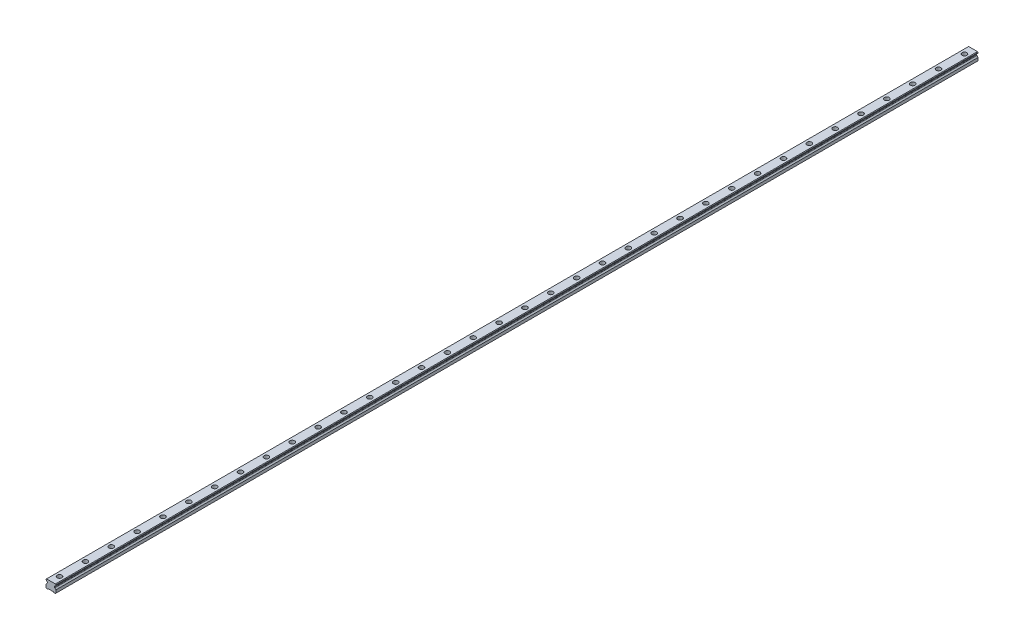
ISO-10303-21;
HEADER;
FILE_DESCRIPTION(('STEP AP214'),'2;1');
FILE_NAME('part.step','',(''),(''),'','','');
FILE_SCHEMA(('AUTOMOTIVE_DESIGN { 1 0 10303 214 1 1 1 1 }'));
ENDSEC;
DATA;
#1=APPLICATION_CONTEXT('core data for automotive mechanical design processes');
#2=APPLICATION_PROTOCOL_DEFINITION('international standard','automotive_design',2000,#1);
#3=PRODUCT_CONTEXT('',#1,'mechanical');
#4=PRODUCT('Part','Part','',(#3));
#5=PRODUCT_RELATED_PRODUCT_CATEGORY('part','',(#4));
#6=PRODUCT_DEFINITION_FORMATION('','',#4);
#7=PRODUCT_DEFINITION_CONTEXT('part definition',#1,'design');
#8=PRODUCT_DEFINITION('design','',#6,#7);
#9=PRODUCT_DEFINITION_SHAPE('','',#8);
#10=(LENGTH_UNIT() NAMED_UNIT(*) SI_UNIT(.MILLI.,.METRE.));
#11=(NAMED_UNIT(*) PLANE_ANGLE_UNIT() SI_UNIT($,.RADIAN.));
#12=(NAMED_UNIT(*) SI_UNIT($,.STERADIAN.) SOLID_ANGLE_UNIT());
#13=UNCERTAINTY_MEASURE_WITH_UNIT(LENGTH_MEASURE(1.E-05),#10,'distance_accuracy_value','');
#14=(GEOMETRIC_REPRESENTATION_CONTEXT(3) GLOBAL_UNCERTAINTY_ASSIGNED_CONTEXT((#13)) GLOBAL_UNIT_ASSIGNED_CONTEXT((#10,
#11,#12)) REPRESENTATION_CONTEXT('',''));
#15=CARTESIAN_POINT('',(0.,0.,0.));
#16=DIRECTION('',(0.,0.,1.));
#17=DIRECTION('',(1.,0.,0.));
#18=AXIS2_PLACEMENT_3D('',#15,#16,#17);
#19=CARTESIAN_POINT('',(0.,10.2,-1050.));
#20=DIRECTION('',(0.,1.,0.));
#21=DIRECTION('',(0.,0.,1.));
#22=AXIS2_PLACEMENT_3D('',#19,#20,#21);
#23=PLANE('',#22);
#24=CARTESIAN_POINT('',(0.,10.2,-1050.));
#25=DIRECTION('',(0.,1.,0.));
#26=DIRECTION('',(0.,0.,1.));
#27=AXIS2_PLACEMENT_3D('',#24,#25,#26);
#28=CIRCLE('',#27,3.49999999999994);
#29=CARTESIAN_POINT('',(0.,10.2,-1046.5));
#30=VERTEX_POINT('',#29);
#31=EDGE_CURVE('E631',#30,#30,#28,.T.);
#32=ORIENTED_EDGE('',*,*,#31,.F.);
#33=EDGE_LOOP('',(#32));
#34=FACE_BOUND('',#33,.T.);
#35=CARTESIAN_POINT('',(0.,10.2,-1050.));
#36=DIRECTION('',(0.,1.,0.));
#37=DIRECTION('',(0.,0.,1.));
#38=AXIS2_PLACEMENT_3D('',#35,#36,#37);
#39=CIRCLE('',#38,5.49999999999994);
#40=CARTESIAN_POINT('',(0.,10.2,-1044.5));
#41=VERTEX_POINT('',#40);
#42=EDGE_CURVE('E11',#41,#41,#39,.T.);
#43=ORIENTED_EDGE('',*,*,#42,.T.);
#44=EDGE_LOOP('',(#43));
#45=FACE_BOUND('',#44,.T.);
#46=ADVANCED_FACE('F39',(#34,#45),#23,.T.);
#47=CARTESIAN_POINT('',(0.,10.2,-1050.));
#48=DIRECTION('',(0.,1.,0.));
#49=DIRECTION('',(0.,0.,1.));
#50=AXIS2_PLACEMENT_3D('',#47,#48,#49);
#51=CYLINDRICAL_SURFACE('',#50,5.49999999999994);
#52=ORIENTED_EDGE('',*,*,#42,.F.);
#53=EDGE_LOOP('',(#52));
#54=FACE_BOUND('',#53,.T.);
#55=CARTESIAN_POINT('',(0.,19.2,-1050.));
#56=DIRECTION('',(0.,1.,0.));
#57=DIRECTION('',(0.,0.,1.));
#58=AXIS2_PLACEMENT_3D('',#55,#56,#57);
#59=CIRCLE('',#58,5.49999999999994);
#60=CARTESIAN_POINT('',(0.,19.2,-1044.5));
#61=VERTEX_POINT('',#60);
#62=EDGE_CURVE('E48',#61,#61,#59,.T.);
#63=ORIENTED_EDGE('',*,*,#62,.T.);
#64=EDGE_LOOP('',(#63));
#65=FACE_BOUND('',#64,.T.);
#66=ADVANCED_FACE('F1139',(#54,#65),#51,.F.);
#67=CARTESIAN_POINT('',(0.,10.2,-990.));
#68=DIRECTION('',(0.,1.,0.));
#69=DIRECTION('',(0.,0.,1.));
#70=AXIS2_PLACEMENT_3D('',#67,#68,#69);
#71=PLANE('',#70);
#72=CARTESIAN_POINT('',(0.,10.2,-990.));
#73=DIRECTION('',(0.,1.,0.));
#74=DIRECTION('',(0.,0.,1.));
#75=AXIS2_PLACEMENT_3D('',#72,#73,#74);
#76=CIRCLE('',#75,3.49999999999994);
#77=CARTESIAN_POINT('',(0.,10.2,-986.5));
#78=VERTEX_POINT('',#77);
#79=EDGE_CURVE('E636',#78,#78,#76,.T.);
#80=ORIENTED_EDGE('',*,*,#79,.F.);
#81=EDGE_LOOP('',(#80));
#82=FACE_BOUND('',#81,.T.);
#83=CARTESIAN_POINT('',(0.,10.2,-990.));
#84=DIRECTION('',(0.,1.,0.));
#85=DIRECTION('',(0.,0.,1.));
#86=AXIS2_PLACEMENT_3D('',#83,#84,#85);
#87=CIRCLE('',#86,5.49999999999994);
#88=CARTESIAN_POINT('',(0.,10.2,-984.5));
#89=VERTEX_POINT('',#88);
#90=EDGE_CURVE('E615',#89,#89,#87,.T.);
#91=ORIENTED_EDGE('',*,*,#90,.T.);
#92=EDGE_LOOP('',(#91));
#93=FACE_BOUND('',#92,.T.);
#94=ADVANCED_FACE('F1141',(#82,#93),#71,.T.);
#95=CARTESIAN_POINT('',(0.,10.2,-990.));
#96=DIRECTION('',(0.,1.,0.));
#97=DIRECTION('',(0.,0.,1.));
#98=AXIS2_PLACEMENT_3D('',#95,#96,#97);
#99=CYLINDRICAL_SURFACE('',#98,5.49999999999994);
#100=ORIENTED_EDGE('',*,*,#90,.F.);
#101=EDGE_LOOP('',(#100));
#102=FACE_BOUND('',#101,.T.);
#103=CARTESIAN_POINT('',(0.,19.2,-990.));
#104=DIRECTION('',(0.,1.,0.));
#105=DIRECTION('',(0.,0.,1.));
#106=AXIS2_PLACEMENT_3D('',#103,#104,#105);
#107=CIRCLE('',#106,5.49999999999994);
#108=CARTESIAN_POINT('',(0.,19.2,-984.5));
#109=VERTEX_POINT('',#108);
#110=EDGE_CURVE('E611',#109,#109,#107,.T.);
#111=ORIENTED_EDGE('',*,*,#110,.T.);
#112=EDGE_LOOP('',(#111));
#113=FACE_BOUND('',#112,.T.);
#114=ADVANCED_FACE('F1147',(#102,#113),#99,.F.);
#115=CARTESIAN_POINT('',(0.,10.2,-930.));
#116=DIRECTION('',(0.,1.,0.));
#117=DIRECTION('',(0.,0.,1.));
#118=AXIS2_PLACEMENT_3D('',#115,#116,#117);
#119=PLANE('',#118);
#120=CARTESIAN_POINT('',(0.,10.2,-930.));
#121=DIRECTION('',(0.,1.,0.));
#122=DIRECTION('',(0.,0.,1.));
#123=AXIS2_PLACEMENT_3D('',#120,#121,#122);
#124=CIRCLE('',#123,3.49999999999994);
#125=CARTESIAN_POINT('',(0.,10.2,-926.5));
#126=VERTEX_POINT('',#125);
#127=EDGE_CURVE('E641',#126,#126,#124,.T.);
#128=ORIENTED_EDGE('',*,*,#127,.F.);
#129=EDGE_LOOP('',(#128));
#130=FACE_BOUND('',#129,.T.);
#131=CARTESIAN_POINT('',(0.,10.2,-930.));
#132=DIRECTION('',(0.,1.,0.));
#133=DIRECTION('',(0.,0.,1.));
#134=AXIS2_PLACEMENT_3D('',#131,#132,#133);
#135=CIRCLE('',#134,5.49999999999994);
#136=CARTESIAN_POINT('',(0.,10.2,-924.5));
#137=VERTEX_POINT('',#136);
#138=EDGE_CURVE('E607',#137,#137,#135,.T.);
#139=ORIENTED_EDGE('',*,*,#138,.T.);
#140=EDGE_LOOP('',(#139));
#141=FACE_BOUND('',#140,.T.);
#142=ADVANCED_FACE('F1155',(#130,#141),#119,.T.);
#143=CARTESIAN_POINT('',(0.,10.2,-930.));
#144=DIRECTION('',(0.,1.,0.));
#145=DIRECTION('',(0.,0.,1.));
#146=AXIS2_PLACEMENT_3D('',#143,#144,#145);
#147=CYLINDRICAL_SURFACE('',#146,5.49999999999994);
#148=ORIENTED_EDGE('',*,*,#138,.F.);
#149=EDGE_LOOP('',(#148));
#150=FACE_BOUND('',#149,.T.);
#151=CARTESIAN_POINT('',(0.,19.2,-930.));
#152=DIRECTION('',(0.,1.,0.));
#153=DIRECTION('',(0.,0.,1.));
#154=AXIS2_PLACEMENT_3D('',#151,#152,#153);
#155=CIRCLE('',#154,5.49999999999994);
#156=CARTESIAN_POINT('',(0.,19.2,-924.5));
#157=VERTEX_POINT('',#156);
#158=EDGE_CURVE('E603',#157,#157,#155,.T.);
#159=ORIENTED_EDGE('',*,*,#158,.T.);
#160=EDGE_LOOP('',(#159));
#161=FACE_BOUND('',#160,.T.);
#162=ADVANCED_FACE('F1159',(#150,#161),#147,.F.);
#163=CARTESIAN_POINT('',(0.,10.2,-870.));
#164=DIRECTION('',(0.,1.,0.));
#165=DIRECTION('',(0.,0.,1.));
#166=AXIS2_PLACEMENT_3D('',#163,#164,#165);
#167=PLANE('',#166);
#168=CARTESIAN_POINT('',(0.,10.2,-870.));
#169=DIRECTION('',(0.,1.,0.));
#170=DIRECTION('',(0.,0.,1.));
#171=AXIS2_PLACEMENT_3D('',#168,#169,#170);
#172=CIRCLE('',#171,3.49999999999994);
#173=CARTESIAN_POINT('',(0.,10.2,-866.5));
#174=VERTEX_POINT('',#173);
#175=EDGE_CURVE('E646',#174,#174,#172,.T.);
#176=ORIENTED_EDGE('',*,*,#175,.F.);
#177=EDGE_LOOP('',(#176));
#178=FACE_BOUND('',#177,.T.);
#179=CARTESIAN_POINT('',(0.,10.2,-870.));
#180=DIRECTION('',(0.,1.,0.));
#181=DIRECTION('',(0.,0.,1.));
#182=AXIS2_PLACEMENT_3D('',#179,#180,#181);
#183=CIRCLE('',#182,5.49999999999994);
#184=CARTESIAN_POINT('',(0.,10.2,-864.5));
#185=VERTEX_POINT('',#184);
#186=EDGE_CURVE('E599',#185,#185,#183,.T.);
#187=ORIENTED_EDGE('',*,*,#186,.T.);
#188=EDGE_LOOP('',(#187));
#189=FACE_BOUND('',#188,.T.);
#190=ADVANCED_FACE('F1163',(#178,#189),#167,.T.);
#191=CARTESIAN_POINT('',(0.,10.2,-870.));
#192=DIRECTION('',(0.,1.,0.));
#193=DIRECTION('',(0.,0.,1.));
#194=AXIS2_PLACEMENT_3D('',#191,#192,#193);
#195=CYLINDRICAL_SURFACE('',#194,5.49999999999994);
#196=ORIENTED_EDGE('',*,*,#186,.F.);
#197=EDGE_LOOP('',(#196));
#198=FACE_BOUND('',#197,.T.);
#199=CARTESIAN_POINT('',(0.,19.2,-870.));
#200=DIRECTION('',(0.,1.,0.));
#201=DIRECTION('',(0.,0.,1.));
#202=AXIS2_PLACEMENT_3D('',#199,#200,#201);
#203=CIRCLE('',#202,5.49999999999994);
#204=CARTESIAN_POINT('',(0.,19.2,-864.5));
#205=VERTEX_POINT('',#204);
#206=EDGE_CURVE('E595',#205,#205,#203,.T.);
#207=ORIENTED_EDGE('',*,*,#206,.T.);
#208=EDGE_LOOP('',(#207));
#209=FACE_BOUND('',#208,.T.);
#210=ADVANCED_FACE('F1167',(#198,#209),#195,.F.);
#211=CARTESIAN_POINT('',(0.,10.2,-810.));
#212=DIRECTION('',(0.,1.,0.));
#213=DIRECTION('',(0.,0.,1.));
#214=AXIS2_PLACEMENT_3D('',#211,#212,#213);
#215=PLANE('',#214);
#216=CARTESIAN_POINT('',(0.,10.2,-810.));
#217=DIRECTION('',(0.,1.,0.));
#218=DIRECTION('',(0.,0.,1.));
#219=AXIS2_PLACEMENT_3D('',#216,#217,#218);
#220=CIRCLE('',#219,3.49999999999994);
#221=CARTESIAN_POINT('',(0.,10.2,-806.5));
#222=VERTEX_POINT('',#221);
#223=EDGE_CURVE('E651',#222,#222,#220,.T.);
#224=ORIENTED_EDGE('',*,*,#223,.F.);
#225=EDGE_LOOP('',(#224));
#226=FACE_BOUND('',#225,.T.);
#227=CARTESIAN_POINT('',(0.,10.2,-810.));
#228=DIRECTION('',(0.,1.,0.));
#229=DIRECTION('',(0.,0.,1.));
#230=AXIS2_PLACEMENT_3D('',#227,#228,#229);
#231=CIRCLE('',#230,5.49999999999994);
#232=CARTESIAN_POINT('',(0.,10.2,-804.5));
#233=VERTEX_POINT('',#232);
#234=EDGE_CURVE('E591',#233,#233,#231,.T.);
#235=ORIENTED_EDGE('',*,*,#234,.T.);
#236=EDGE_LOOP('',(#235));
#237=FACE_BOUND('',#236,.T.);
#238=ADVANCED_FACE('F1171',(#226,#237),#215,.T.);
#239=CARTESIAN_POINT('',(0.,10.2,-810.));
#240=DIRECTION('',(0.,1.,0.));
#241=DIRECTION('',(0.,0.,1.));
#242=AXIS2_PLACEMENT_3D('',#239,#240,#241);
#243=CYLINDRICAL_SURFACE('',#242,5.49999999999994);
#244=ORIENTED_EDGE('',*,*,#234,.F.);
#245=EDGE_LOOP('',(#244));
#246=FACE_BOUND('',#245,.T.);
#247=CARTESIAN_POINT('',(0.,19.2,-810.));
#248=DIRECTION('',(0.,1.,0.));
#249=DIRECTION('',(0.,0.,1.));
#250=AXIS2_PLACEMENT_3D('',#247,#248,#249);
#251=CIRCLE('',#250,5.49999999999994);
#252=CARTESIAN_POINT('',(0.,19.2,-804.5));
#253=VERTEX_POINT('',#252);
#254=EDGE_CURVE('E587',#253,#253,#251,.T.);
#255=ORIENTED_EDGE('',*,*,#254,.T.);
#256=EDGE_LOOP('',(#255));
#257=FACE_BOUND('',#256,.T.);
#258=ADVANCED_FACE('F1175',(#246,#257),#243,.F.);
#259=CARTESIAN_POINT('',(0.,10.2,-750.));
#260=DIRECTION('',(0.,1.,0.));
#261=DIRECTION('',(0.,0.,1.));
#262=AXIS2_PLACEMENT_3D('',#259,#260,#261);
#263=PLANE('',#262);
#264=CARTESIAN_POINT('',(0.,10.2,-750.));
#265=DIRECTION('',(0.,1.,0.));
#266=DIRECTION('',(0.,0.,1.));
#267=AXIS2_PLACEMENT_3D('',#264,#265,#266);
#268=CIRCLE('',#267,3.49999999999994);
#269=CARTESIAN_POINT('',(0.,10.2,-746.5));
#270=VERTEX_POINT('',#269);
#271=EDGE_CURVE('E656',#270,#270,#268,.T.);
#272=ORIENTED_EDGE('',*,*,#271,.F.);
#273=EDGE_LOOP('',(#272));
#274=FACE_BOUND('',#273,.T.);
#275=CARTESIAN_POINT('',(0.,10.2,-750.));
#276=DIRECTION('',(0.,1.,0.));
#277=DIRECTION('',(0.,0.,1.));
#278=AXIS2_PLACEMENT_3D('',#275,#276,#277);
#279=CIRCLE('',#278,5.49999999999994);
#280=CARTESIAN_POINT('',(0.,10.2,-744.5));
#281=VERTEX_POINT('',#280);
#282=EDGE_CURVE('E583',#281,#281,#279,.T.);
#283=ORIENTED_EDGE('',*,*,#282,.T.);
#284=EDGE_LOOP('',(#283));
#285=FACE_BOUND('',#284,.T.);
#286=ADVANCED_FACE('F1179',(#274,#285),#263,.T.);
#287=CARTESIAN_POINT('',(0.,10.2,-750.));
#288=DIRECTION('',(0.,1.,0.));
#289=DIRECTION('',(0.,0.,1.));
#290=AXIS2_PLACEMENT_3D('',#287,#288,#289);
#291=CYLINDRICAL_SURFACE('',#290,5.49999999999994);
#292=ORIENTED_EDGE('',*,*,#282,.F.);
#293=EDGE_LOOP('',(#292));
#294=FACE_BOUND('',#293,.T.);
#295=CARTESIAN_POINT('',(0.,19.2,-750.));
#296=DIRECTION('',(0.,1.,0.));
#297=DIRECTION('',(0.,0.,1.));
#298=AXIS2_PLACEMENT_3D('',#295,#296,#297);
#299=CIRCLE('',#298,5.49999999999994);
#300=CARTESIAN_POINT('',(0.,19.2,-744.5));
#301=VERTEX_POINT('',#300);
#302=EDGE_CURVE('E579',#301,#301,#299,.T.);
#303=ORIENTED_EDGE('',*,*,#302,.T.);
#304=EDGE_LOOP('',(#303));
#305=FACE_BOUND('',#304,.T.);
#306=ADVANCED_FACE('F1183',(#294,#305),#291,.F.);
#307=CARTESIAN_POINT('',(0.,10.2,-690.));
#308=DIRECTION('',(0.,1.,0.));
#309=DIRECTION('',(0.,0.,1.));
#310=AXIS2_PLACEMENT_3D('',#307,#308,#309);
#311=PLANE('',#310);
#312=CARTESIAN_POINT('',(0.,10.2,-690.));
#313=DIRECTION('',(0.,1.,0.));
#314=DIRECTION('',(0.,0.,1.));
#315=AXIS2_PLACEMENT_3D('',#312,#313,#314);
#316=CIRCLE('',#315,3.49999999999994);
#317=CARTESIAN_POINT('',(0.,10.2,-686.5));
#318=VERTEX_POINT('',#317);
#319=EDGE_CURVE('E661',#318,#318,#316,.T.);
#320=ORIENTED_EDGE('',*,*,#319,.F.);
#321=EDGE_LOOP('',(#320));
#322=FACE_BOUND('',#321,.T.);
#323=CARTESIAN_POINT('',(0.,10.2,-690.));
#324=DIRECTION('',(0.,1.,0.));
#325=DIRECTION('',(0.,0.,1.));
#326=AXIS2_PLACEMENT_3D('',#323,#324,#325);
#327=CIRCLE('',#326,5.49999999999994);
#328=CARTESIAN_POINT('',(0.,10.2,-684.5));
#329=VERTEX_POINT('',#328);
#330=EDGE_CURVE('E575',#329,#329,#327,.T.);
#331=ORIENTED_EDGE('',*,*,#330,.T.);
#332=EDGE_LOOP('',(#331));
#333=FACE_BOUND('',#332,.T.);
#334=ADVANCED_FACE('F1187',(#322,#333),#311,.T.);
#335=CARTESIAN_POINT('',(0.,10.2,-690.));
#336=DIRECTION('',(0.,1.,0.));
#337=DIRECTION('',(0.,0.,1.));
#338=AXIS2_PLACEMENT_3D('',#335,#336,#337);
#339=CYLINDRICAL_SURFACE('',#338,5.49999999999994);
#340=ORIENTED_EDGE('',*,*,#330,.F.);
#341=EDGE_LOOP('',(#340));
#342=FACE_BOUND('',#341,.T.);
#343=CARTESIAN_POINT('',(0.,19.2,-690.));
#344=DIRECTION('',(0.,1.,0.));
#345=DIRECTION('',(0.,0.,1.));
#346=AXIS2_PLACEMENT_3D('',#343,#344,#345);
#347=CIRCLE('',#346,5.49999999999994);
#348=CARTESIAN_POINT('',(0.,19.2,-684.5));
#349=VERTEX_POINT('',#348);
#350=EDGE_CURVE('E571',#349,#349,#347,.T.);
#351=ORIENTED_EDGE('',*,*,#350,.T.);
#352=EDGE_LOOP('',(#351));
#353=FACE_BOUND('',#352,.T.);
#354=ADVANCED_FACE('F1191',(#342,#353),#339,.F.);
#355=CARTESIAN_POINT('',(0.,10.2,-630.));
#356=DIRECTION('',(0.,1.,0.));
#357=DIRECTION('',(0.,0.,1.));
#358=AXIS2_PLACEMENT_3D('',#355,#356,#357);
#359=PLANE('',#358);
#360=CARTESIAN_POINT('',(0.,10.2,-630.));
#361=DIRECTION('',(0.,1.,0.));
#362=DIRECTION('',(0.,0.,1.));
#363=AXIS2_PLACEMENT_3D('',#360,#361,#362);
#364=CIRCLE('',#363,3.49999999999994);
#365=CARTESIAN_POINT('',(0.,10.2,-626.5));
#366=VERTEX_POINT('',#365);
#367=EDGE_CURVE('E666',#366,#366,#364,.T.);
#368=ORIENTED_EDGE('',*,*,#367,.F.);
#369=EDGE_LOOP('',(#368));
#370=FACE_BOUND('',#369,.T.);
#371=CARTESIAN_POINT('',(0.,10.2,-630.));
#372=DIRECTION('',(0.,1.,0.));
#373=DIRECTION('',(0.,0.,1.));
#374=AXIS2_PLACEMENT_3D('',#371,#372,#373);
#375=CIRCLE('',#374,5.49999999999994);
#376=CARTESIAN_POINT('',(0.,10.2,-624.5));
#377=VERTEX_POINT('',#376);
#378=EDGE_CURVE('E567',#377,#377,#375,.T.);
#379=ORIENTED_EDGE('',*,*,#378,.T.);
#380=EDGE_LOOP('',(#379));
#381=FACE_BOUND('',#380,.T.);
#382=ADVANCED_FACE('F1195',(#370,#381),#359,.T.);
#383=CARTESIAN_POINT('',(0.,10.2,-630.));
#384=DIRECTION('',(0.,1.,0.));
#385=DIRECTION('',(0.,0.,1.));
#386=AXIS2_PLACEMENT_3D('',#383,#384,#385);
#387=CYLINDRICAL_SURFACE('',#386,5.49999999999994);
#388=ORIENTED_EDGE('',*,*,#378,.F.);
#389=EDGE_LOOP('',(#388));
#390=FACE_BOUND('',#389,.T.);
#391=CARTESIAN_POINT('',(0.,19.2,-630.));
#392=DIRECTION('',(0.,1.,0.));
#393=DIRECTION('',(0.,0.,1.));
#394=AXIS2_PLACEMENT_3D('',#391,#392,#393);
#395=CIRCLE('',#394,5.49999999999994);
#396=CARTESIAN_POINT('',(0.,19.2,-624.5));
#397=VERTEX_POINT('',#396);
#398=EDGE_CURVE('E563',#397,#397,#395,.T.);
#399=ORIENTED_EDGE('',*,*,#398,.T.);
#400=EDGE_LOOP('',(#399));
#401=FACE_BOUND('',#400,.T.);
#402=ADVANCED_FACE('F1199',(#390,#401),#387,.F.);
#403=CARTESIAN_POINT('',(0.,10.2,-570.));
#404=DIRECTION('',(0.,1.,0.));
#405=DIRECTION('',(0.,0.,1.));
#406=AXIS2_PLACEMENT_3D('',#403,#404,#405);
#407=PLANE('',#406);
#408=CARTESIAN_POINT('',(0.,10.2,-570.));
#409=DIRECTION('',(0.,1.,0.));
#410=DIRECTION('',(0.,0.,1.));
#411=AXIS2_PLACEMENT_3D('',#408,#409,#410);
#412=CIRCLE('',#411,3.49999999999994);
#413=CARTESIAN_POINT('',(0.,10.2,-566.5));
#414=VERTEX_POINT('',#413);
#415=EDGE_CURVE('E671',#414,#414,#412,.T.);
#416=ORIENTED_EDGE('',*,*,#415,.F.);
#417=EDGE_LOOP('',(#416));
#418=FACE_BOUND('',#417,.T.);
#419=CARTESIAN_POINT('',(0.,10.2,-570.));
#420=DIRECTION('',(0.,1.,0.));
#421=DIRECTION('',(0.,0.,1.));
#422=AXIS2_PLACEMENT_3D('',#419,#420,#421);
#423=CIRCLE('',#422,5.49999999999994);
#424=CARTESIAN_POINT('',(0.,10.2,-564.5));
#425=VERTEX_POINT('',#424);
#426=EDGE_CURVE('E559',#425,#425,#423,.T.);
#427=ORIENTED_EDGE('',*,*,#426,.T.);
#428=EDGE_LOOP('',(#427));
#429=FACE_BOUND('',#428,.T.);
#430=ADVANCED_FACE('F1203',(#418,#429),#407,.T.);
#431=CARTESIAN_POINT('',(0.,10.2,-570.));
#432=DIRECTION('',(0.,1.,0.));
#433=DIRECTION('',(0.,0.,1.));
#434=AXIS2_PLACEMENT_3D('',#431,#432,#433);
#435=CYLINDRICAL_SURFACE('',#434,5.49999999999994);
#436=ORIENTED_EDGE('',*,*,#426,.F.);
#437=EDGE_LOOP('',(#436));
#438=FACE_BOUND('',#437,.T.);
#439=CARTESIAN_POINT('',(0.,19.2,-570.));
#440=DIRECTION('',(0.,1.,0.));
#441=DIRECTION('',(0.,0.,1.));
#442=AXIS2_PLACEMENT_3D('',#439,#440,#441);
#443=CIRCLE('',#442,5.49999999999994);
#444=CARTESIAN_POINT('',(0.,19.2,-564.5));
#445=VERTEX_POINT('',#444);
#446=EDGE_CURVE('E555',#445,#445,#443,.T.);
#447=ORIENTED_EDGE('',*,*,#446,.T.);
#448=EDGE_LOOP('',(#447));
#449=FACE_BOUND('',#448,.T.);
#450=ADVANCED_FACE('F1207',(#438,#449),#435,.F.);
#451=CARTESIAN_POINT('',(0.,10.2,-510.));
#452=DIRECTION('',(0.,1.,0.));
#453=DIRECTION('',(0.,0.,1.));
#454=AXIS2_PLACEMENT_3D('',#451,#452,#453);
#455=PLANE('',#454);
#456=CARTESIAN_POINT('',(0.,10.2,-510.));
#457=DIRECTION('',(0.,1.,0.));
#458=DIRECTION('',(0.,0.,1.));
#459=AXIS2_PLACEMENT_3D('',#456,#457,#458);
#460=CIRCLE('',#459,3.49999999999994);
#461=CARTESIAN_POINT('',(0.,10.2,-506.5));
#462=VERTEX_POINT('',#461);
#463=EDGE_CURVE('E676',#462,#462,#460,.T.);
#464=ORIENTED_EDGE('',*,*,#463,.F.);
#465=EDGE_LOOP('',(#464));
#466=FACE_BOUND('',#465,.T.);
#467=CARTESIAN_POINT('',(0.,10.2,-510.));
#468=DIRECTION('',(0.,1.,0.));
#469=DIRECTION('',(0.,0.,1.));
#470=AXIS2_PLACEMENT_3D('',#467,#468,#469);
#471=CIRCLE('',#470,5.49999999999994);
#472=CARTESIAN_POINT('',(0.,10.2,-504.5));
#473=VERTEX_POINT('',#472);
#474=EDGE_CURVE('E551',#473,#473,#471,.T.);
#475=ORIENTED_EDGE('',*,*,#474,.T.);
#476=EDGE_LOOP('',(#475));
#477=FACE_BOUND('',#476,.T.);
#478=ADVANCED_FACE('F1211',(#466,#477),#455,.T.);
#479=CARTESIAN_POINT('',(0.,10.2,-510.));
#480=DIRECTION('',(0.,1.,0.));
#481=DIRECTION('',(0.,0.,1.));
#482=AXIS2_PLACEMENT_3D('',#479,#480,#481);
#483=CYLINDRICAL_SURFACE('',#482,5.49999999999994);
#484=ORIENTED_EDGE('',*,*,#474,.F.);
#485=EDGE_LOOP('',(#484));
#486=FACE_BOUND('',#485,.T.);
#487=CARTESIAN_POINT('',(0.,19.2,-510.));
#488=DIRECTION('',(0.,1.,0.));
#489=DIRECTION('',(0.,0.,1.));
#490=AXIS2_PLACEMENT_3D('',#487,#488,#489);
#491=CIRCLE('',#490,5.49999999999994);
#492=CARTESIAN_POINT('',(0.,19.2,-504.5));
#493=VERTEX_POINT('',#492);
#494=EDGE_CURVE('E547',#493,#493,#491,.T.);
#495=ORIENTED_EDGE('',*,*,#494,.T.);
#496=EDGE_LOOP('',(#495));
#497=FACE_BOUND('',#496,.T.);
#498=ADVANCED_FACE('F1215',(#486,#497),#483,.F.);
#499=CARTESIAN_POINT('',(0.,10.2,-450.));
#500=DIRECTION('',(0.,1.,0.));
#501=DIRECTION('',(0.,0.,1.));
#502=AXIS2_PLACEMENT_3D('',#499,#500,#501);
#503=PLANE('',#502);
#504=CARTESIAN_POINT('',(0.,10.2,-450.));
#505=DIRECTION('',(0.,1.,0.));
#506=DIRECTION('',(0.,0.,1.));
#507=AXIS2_PLACEMENT_3D('',#504,#505,#506);
#508=CIRCLE('',#507,3.49999999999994);
#509=CARTESIAN_POINT('',(0.,10.2,-446.5));
#510=VERTEX_POINT('',#509);
#511=EDGE_CURVE('E681',#510,#510,#508,.T.);
#512=ORIENTED_EDGE('',*,*,#511,.F.);
#513=EDGE_LOOP('',(#512));
#514=FACE_BOUND('',#513,.T.);
#515=CARTESIAN_POINT('',(0.,10.2,-450.));
#516=DIRECTION('',(0.,1.,0.));
#517=DIRECTION('',(0.,0.,1.));
#518=AXIS2_PLACEMENT_3D('',#515,#516,#517);
#519=CIRCLE('',#518,5.49999999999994);
#520=CARTESIAN_POINT('',(0.,10.2,-444.5));
#521=VERTEX_POINT('',#520);
#522=EDGE_CURVE('E543',#521,#521,#519,.T.);
#523=ORIENTED_EDGE('',*,*,#522,.T.);
#524=EDGE_LOOP('',(#523));
#525=FACE_BOUND('',#524,.T.);
#526=ADVANCED_FACE('F1219',(#514,#525),#503,.T.);
#527=CARTESIAN_POINT('',(0.,10.2,-450.));
#528=DIRECTION('',(0.,1.,0.));
#529=DIRECTION('',(0.,0.,1.));
#530=AXIS2_PLACEMENT_3D('',#527,#528,#529);
#531=CYLINDRICAL_SURFACE('',#530,5.49999999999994);
#532=ORIENTED_EDGE('',*,*,#522,.F.);
#533=EDGE_LOOP('',(#532));
#534=FACE_BOUND('',#533,.T.);
#535=CARTESIAN_POINT('',(0.,19.2,-450.));
#536=DIRECTION('',(0.,1.,0.));
#537=DIRECTION('',(0.,0.,1.));
#538=AXIS2_PLACEMENT_3D('',#535,#536,#537);
#539=CIRCLE('',#538,5.49999999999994);
#540=CARTESIAN_POINT('',(0.,19.2,-444.5));
#541=VERTEX_POINT('',#540);
#542=EDGE_CURVE('E539',#541,#541,#539,.T.);
#543=ORIENTED_EDGE('',*,*,#542,.T.);
#544=EDGE_LOOP('',(#543));
#545=FACE_BOUND('',#544,.T.);
#546=ADVANCED_FACE('F1223',(#534,#545),#531,.F.);
#547=CARTESIAN_POINT('',(0.,10.2,-390.));
#548=DIRECTION('',(0.,1.,0.));
#549=DIRECTION('',(0.,0.,1.));
#550=AXIS2_PLACEMENT_3D('',#547,#548,#549);
#551=PLANE('',#550);
#552=CARTESIAN_POINT('',(0.,10.2,-390.));
#553=DIRECTION('',(0.,1.,0.));
#554=DIRECTION('',(0.,0.,1.));
#555=AXIS2_PLACEMENT_3D('',#552,#553,#554);
#556=CIRCLE('',#555,3.49999999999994);
#557=CARTESIAN_POINT('',(0.,10.2,-386.5));
#558=VERTEX_POINT('',#557);
#559=EDGE_CURVE('E686',#558,#558,#556,.T.);
#560=ORIENTED_EDGE('',*,*,#559,.F.);
#561=EDGE_LOOP('',(#560));
#562=FACE_BOUND('',#561,.T.);
#563=CARTESIAN_POINT('',(0.,10.2,-390.));
#564=DIRECTION('',(0.,1.,0.));
#565=DIRECTION('',(0.,0.,1.));
#566=AXIS2_PLACEMENT_3D('',#563,#564,#565);
#567=CIRCLE('',#566,5.49999999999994);
#568=CARTESIAN_POINT('',(0.,10.2,-384.5));
#569=VERTEX_POINT('',#568);
#570=EDGE_CURVE('E535',#569,#569,#567,.T.);
#571=ORIENTED_EDGE('',*,*,#570,.T.);
#572=EDGE_LOOP('',(#571));
#573=FACE_BOUND('',#572,.T.);
#574=ADVANCED_FACE('F1227',(#562,#573),#551,.T.);
#575=CARTESIAN_POINT('',(0.,10.2,-390.));
#576=DIRECTION('',(0.,1.,0.));
#577=DIRECTION('',(0.,0.,1.));
#578=AXIS2_PLACEMENT_3D('',#575,#576,#577);
#579=CYLINDRICAL_SURFACE('',#578,5.49999999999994);
#580=ORIENTED_EDGE('',*,*,#570,.F.);
#581=EDGE_LOOP('',(#580));
#582=FACE_BOUND('',#581,.T.);
#583=CARTESIAN_POINT('',(0.,19.2,-390.));
#584=DIRECTION('',(0.,1.,0.));
#585=DIRECTION('',(0.,0.,1.));
#586=AXIS2_PLACEMENT_3D('',#583,#584,#585);
#587=CIRCLE('',#586,5.49999999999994);
#588=CARTESIAN_POINT('',(0.,19.2,-384.5));
#589=VERTEX_POINT('',#588);
#590=EDGE_CURVE('E531',#589,#589,#587,.T.);
#591=ORIENTED_EDGE('',*,*,#590,.T.);
#592=EDGE_LOOP('',(#591));
#593=FACE_BOUND('',#592,.T.);
#594=ADVANCED_FACE('F1231',(#582,#593),#579,.F.);
#595=CARTESIAN_POINT('',(0.,10.2,-330.));
#596=DIRECTION('',(0.,1.,0.));
#597=DIRECTION('',(0.,0.,1.));
#598=AXIS2_PLACEMENT_3D('',#595,#596,#597);
#599=PLANE('',#598);
#600=CARTESIAN_POINT('',(0.,10.2,-330.));
#601=DIRECTION('',(0.,1.,0.));
#602=DIRECTION('',(0.,0.,1.));
#603=AXIS2_PLACEMENT_3D('',#600,#601,#602);
#604=CIRCLE('',#603,3.49999999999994);
#605=CARTESIAN_POINT('',(0.,10.2,-326.5));
#606=VERTEX_POINT('',#605);
#607=EDGE_CURVE('E691',#606,#606,#604,.T.);
#608=ORIENTED_EDGE('',*,*,#607,.F.);
#609=EDGE_LOOP('',(#608));
#610=FACE_BOUND('',#609,.T.);
#611=CARTESIAN_POINT('',(0.,10.2,-330.));
#612=DIRECTION('',(0.,1.,0.));
#613=DIRECTION('',(0.,0.,1.));
#614=AXIS2_PLACEMENT_3D('',#611,#612,#613);
#615=CIRCLE('',#614,5.49999999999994);
#616=CARTESIAN_POINT('',(0.,10.2,-324.5));
#617=VERTEX_POINT('',#616);
#618=EDGE_CURVE('E527',#617,#617,#615,.T.);
#619=ORIENTED_EDGE('',*,*,#618,.T.);
#620=EDGE_LOOP('',(#619));
#621=FACE_BOUND('',#620,.T.);
#622=ADVANCED_FACE('F1235',(#610,#621),#599,.T.);
#623=CARTESIAN_POINT('',(0.,10.2,-330.));
#624=DIRECTION('',(0.,1.,0.));
#625=DIRECTION('',(0.,0.,1.));
#626=AXIS2_PLACEMENT_3D('',#623,#624,#625);
#627=CYLINDRICAL_SURFACE('',#626,5.49999999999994);
#628=ORIENTED_EDGE('',*,*,#618,.F.);
#629=EDGE_LOOP('',(#628));
#630=FACE_BOUND('',#629,.T.);
#631=CARTESIAN_POINT('',(0.,19.2,-330.));
#632=DIRECTION('',(0.,1.,0.));
#633=DIRECTION('',(0.,0.,1.));
#634=AXIS2_PLACEMENT_3D('',#631,#632,#633);
#635=CIRCLE('',#634,5.49999999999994);
#636=CARTESIAN_POINT('',(0.,19.2,-324.5));
#637=VERTEX_POINT('',#636);
#638=EDGE_CURVE('E523',#637,#637,#635,.T.);
#639=ORIENTED_EDGE('',*,*,#638,.T.);
#640=EDGE_LOOP('',(#639));
#641=FACE_BOUND('',#640,.T.);
#642=ADVANCED_FACE('F1239',(#630,#641),#627,.F.);
#643=CARTESIAN_POINT('',(0.,10.2,-270.));
#644=DIRECTION('',(0.,1.,0.));
#645=DIRECTION('',(0.,0.,1.));
#646=AXIS2_PLACEMENT_3D('',#643,#644,#645);
#647=PLANE('',#646);
#648=CARTESIAN_POINT('',(0.,10.2,-270.));
#649=DIRECTION('',(0.,1.,0.));
#650=DIRECTION('',(0.,0.,1.));
#651=AXIS2_PLACEMENT_3D('',#648,#649,#650);
#652=CIRCLE('',#651,3.49999999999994);
#653=CARTESIAN_POINT('',(0.,10.2,-266.5));
#654=VERTEX_POINT('',#653);
#655=EDGE_CURVE('E696',#654,#654,#652,.T.);
#656=ORIENTED_EDGE('',*,*,#655,.F.);
#657=EDGE_LOOP('',(#656));
#658=FACE_BOUND('',#657,.T.);
#659=CARTESIAN_POINT('',(0.,10.2,-270.));
#660=DIRECTION('',(0.,1.,0.));
#661=DIRECTION('',(0.,0.,1.));
#662=AXIS2_PLACEMENT_3D('',#659,#660,#661);
#663=CIRCLE('',#662,5.49999999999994);
#664=CARTESIAN_POINT('',(0.,10.2,-264.5));
#665=VERTEX_POINT('',#664);
#666=EDGE_CURVE('E519',#665,#665,#663,.T.);
#667=ORIENTED_EDGE('',*,*,#666,.T.);
#668=EDGE_LOOP('',(#667));
#669=FACE_BOUND('',#668,.T.);
#670=ADVANCED_FACE('F1243',(#658,#669),#647,.T.);
#671=CARTESIAN_POINT('',(0.,10.2,-270.));
#672=DIRECTION('',(0.,1.,0.));
#673=DIRECTION('',(0.,0.,1.));
#674=AXIS2_PLACEMENT_3D('',#671,#672,#673);
#675=CYLINDRICAL_SURFACE('',#674,5.49999999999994);
#676=ORIENTED_EDGE('',*,*,#666,.F.);
#677=EDGE_LOOP('',(#676));
#678=FACE_BOUND('',#677,.T.);
#679=CARTESIAN_POINT('',(0.,19.2,-270.));
#680=DIRECTION('',(0.,1.,0.));
#681=DIRECTION('',(0.,0.,1.));
#682=AXIS2_PLACEMENT_3D('',#679,#680,#681);
#683=CIRCLE('',#682,5.49999999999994);
#684=CARTESIAN_POINT('',(0.,19.2,-264.5));
#685=VERTEX_POINT('',#684);
#686=EDGE_CURVE('E515',#685,#685,#683,.T.);
#687=ORIENTED_EDGE('',*,*,#686,.T.);
#688=EDGE_LOOP('',(#687));
#689=FACE_BOUND('',#688,.T.);
#690=ADVANCED_FACE('F1247',(#678,#689),#675,.F.);
#691=CARTESIAN_POINT('',(0.,10.2,-210.));
#692=DIRECTION('',(0.,1.,0.));
#693=DIRECTION('',(0.,0.,1.));
#694=AXIS2_PLACEMENT_3D('',#691,#692,#693);
#695=PLANE('',#694);
#696=CARTESIAN_POINT('',(0.,10.2,-210.));
#697=DIRECTION('',(0.,1.,0.));
#698=DIRECTION('',(0.,0.,1.));
#699=AXIS2_PLACEMENT_3D('',#696,#697,#698);
#700=CIRCLE('',#699,3.49999999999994);
#701=CARTESIAN_POINT('',(0.,10.2,-206.5));
#702=VERTEX_POINT('',#701);
#703=EDGE_CURVE('E701',#702,#702,#700,.T.);
#704=ORIENTED_EDGE('',*,*,#703,.F.);
#705=EDGE_LOOP('',(#704));
#706=FACE_BOUND('',#705,.T.);
#707=CARTESIAN_POINT('',(0.,10.2,-210.));
#708=DIRECTION('',(0.,1.,0.));
#709=DIRECTION('',(0.,0.,1.));
#710=AXIS2_PLACEMENT_3D('',#707,#708,#709);
#711=CIRCLE('',#710,5.49999999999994);
#712=CARTESIAN_POINT('',(0.,10.2,-204.5));
#713=VERTEX_POINT('',#712);
#714=EDGE_CURVE('E511',#713,#713,#711,.T.);
#715=ORIENTED_EDGE('',*,*,#714,.T.);
#716=EDGE_LOOP('',(#715));
#717=FACE_BOUND('',#716,.T.);
#718=ADVANCED_FACE('F1251',(#706,#717),#695,.T.);
#719=CARTESIAN_POINT('',(0.,10.2,-210.));
#720=DIRECTION('',(0.,1.,0.));
#721=DIRECTION('',(0.,0.,1.));
#722=AXIS2_PLACEMENT_3D('',#719,#720,#721);
#723=CYLINDRICAL_SURFACE('',#722,5.49999999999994);
#724=ORIENTED_EDGE('',*,*,#714,.F.);
#725=EDGE_LOOP('',(#724));
#726=FACE_BOUND('',#725,.T.);
#727=CARTESIAN_POINT('',(0.,19.2,-210.));
#728=DIRECTION('',(0.,1.,0.));
#729=DIRECTION('',(0.,0.,1.));
#730=AXIS2_PLACEMENT_3D('',#727,#728,#729);
#731=CIRCLE('',#730,5.49999999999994);
#732=CARTESIAN_POINT('',(0.,19.2,-204.5));
#733=VERTEX_POINT('',#732);
#734=EDGE_CURVE('E507',#733,#733,#731,.T.);
#735=ORIENTED_EDGE('',*,*,#734,.T.);
#736=EDGE_LOOP('',(#735));
#737=FACE_BOUND('',#736,.T.);
#738=ADVANCED_FACE('F1255',(#726,#737),#723,.F.);
#739=CARTESIAN_POINT('',(0.,10.2,-150.));
#740=DIRECTION('',(0.,1.,0.));
#741=DIRECTION('',(0.,0.,1.));
#742=AXIS2_PLACEMENT_3D('',#739,#740,#741);
#743=PLANE('',#742);
#744=CARTESIAN_POINT('',(0.,10.2,-150.));
#745=DIRECTION('',(0.,1.,0.));
#746=DIRECTION('',(0.,0.,1.));
#747=AXIS2_PLACEMENT_3D('',#744,#745,#746);
#748=CIRCLE('',#747,3.49999999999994);
#749=CARTESIAN_POINT('',(0.,10.2,-146.5));
#750=VERTEX_POINT('',#749);
#751=EDGE_CURVE('E706',#750,#750,#748,.T.);
#752=ORIENTED_EDGE('',*,*,#751,.F.);
#753=EDGE_LOOP('',(#752));
#754=FACE_BOUND('',#753,.T.);
#755=CARTESIAN_POINT('',(0.,10.2,-150.));
#756=DIRECTION('',(0.,1.,0.));
#757=DIRECTION('',(0.,0.,1.));
#758=AXIS2_PLACEMENT_3D('',#755,#756,#757);
#759=CIRCLE('',#758,5.49999999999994);
#760=CARTESIAN_POINT('',(0.,10.2,-144.5));
#761=VERTEX_POINT('',#760);
#762=EDGE_CURVE('E503',#761,#761,#759,.T.);
#763=ORIENTED_EDGE('',*,*,#762,.T.);
#764=EDGE_LOOP('',(#763));
#765=FACE_BOUND('',#764,.T.);
#766=ADVANCED_FACE('F1259',(#754,#765),#743,.T.);
#767=CARTESIAN_POINT('',(0.,10.2,-150.));
#768=DIRECTION('',(0.,1.,0.));
#769=DIRECTION('',(0.,0.,1.));
#770=AXIS2_PLACEMENT_3D('',#767,#768,#769);
#771=CYLINDRICAL_SURFACE('',#770,5.49999999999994);
#772=ORIENTED_EDGE('',*,*,#762,.F.);
#773=EDGE_LOOP('',(#772));
#774=FACE_BOUND('',#773,.T.);
#775=CARTESIAN_POINT('',(0.,19.2,-150.));
#776=DIRECTION('',(0.,1.,0.));
#777=DIRECTION('',(0.,0.,1.));
#778=AXIS2_PLACEMENT_3D('',#775,#776,#777);
#779=CIRCLE('',#778,5.49999999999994);
#780=CARTESIAN_POINT('',(0.,19.2,-144.5));
#781=VERTEX_POINT('',#780);
#782=EDGE_CURVE('E499',#781,#781,#779,.T.);
#783=ORIENTED_EDGE('',*,*,#782,.T.);
#784=EDGE_LOOP('',(#783));
#785=FACE_BOUND('',#784,.T.);
#786=ADVANCED_FACE('F1263',(#774,#785),#771,.F.);
#787=CARTESIAN_POINT('',(0.,10.2,-89.9999999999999));
#788=DIRECTION('',(0.,1.,0.));
#789=DIRECTION('',(0.,0.,1.));
#790=AXIS2_PLACEMENT_3D('',#787,#788,#789);
#791=PLANE('',#790);
#792=CARTESIAN_POINT('',(0.,10.2,-89.9999999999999));
#793=DIRECTION('',(0.,1.,0.));
#794=DIRECTION('',(0.,0.,1.));
#795=AXIS2_PLACEMENT_3D('',#792,#793,#794);
#796=CIRCLE('',#795,3.49999999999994);
#797=CARTESIAN_POINT('',(0.,10.2,-86.4999999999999));
#798=VERTEX_POINT('',#797);
#799=EDGE_CURVE('E711',#798,#798,#796,.T.);
#800=ORIENTED_EDGE('',*,*,#799,.F.);
#801=EDGE_LOOP('',(#800));
#802=FACE_BOUND('',#801,.T.);
#803=CARTESIAN_POINT('',(0.,10.2,-89.9999999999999));
#804=DIRECTION('',(0.,1.,0.));
#805=DIRECTION('',(0.,0.,1.));
#806=AXIS2_PLACEMENT_3D('',#803,#804,#805);
#807=CIRCLE('',#806,5.49999999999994);
#808=CARTESIAN_POINT('',(0.,10.2,-84.4999999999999));
#809=VERTEX_POINT('',#808);
#810=EDGE_CURVE('E495',#809,#809,#807,.T.);
#811=ORIENTED_EDGE('',*,*,#810,.T.);
#812=EDGE_LOOP('',(#811));
#813=FACE_BOUND('',#812,.T.);
#814=ADVANCED_FACE('F1267',(#802,#813),#791,.T.);
#815=CARTESIAN_POINT('',(0.,10.2,-89.9999999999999));
#816=DIRECTION('',(0.,1.,0.));
#817=DIRECTION('',(0.,0.,1.));
#818=AXIS2_PLACEMENT_3D('',#815,#816,#817);
#819=CYLINDRICAL_SURFACE('',#818,5.49999999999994);
#820=ORIENTED_EDGE('',*,*,#810,.F.);
#821=EDGE_LOOP('',(#820));
#822=FACE_BOUND('',#821,.T.);
#823=CARTESIAN_POINT('',(0.,19.2,-89.9999999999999));
#824=DIRECTION('',(0.,1.,0.));
#825=DIRECTION('',(0.,0.,1.));
#826=AXIS2_PLACEMENT_3D('',#823,#824,#825);
#827=CIRCLE('',#826,5.49999999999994);
#828=CARTESIAN_POINT('',(0.,19.2,-84.4999999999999));
#829=VERTEX_POINT('',#828);
#830=EDGE_CURVE('E491',#829,#829,#827,.T.);
#831=ORIENTED_EDGE('',*,*,#830,.T.);
#832=EDGE_LOOP('',(#831));
#833=FACE_BOUND('',#832,.T.);
#834=ADVANCED_FACE('F1271',(#822,#833),#819,.F.);
#835=CARTESIAN_POINT('',(0.,10.2,-30.));
#836=DIRECTION('',(0.,1.,0.));
#837=DIRECTION('',(0.,0.,1.));
#838=AXIS2_PLACEMENT_3D('',#835,#836,#837);
#839=PLANE('',#838);
#840=CARTESIAN_POINT('',(0.,10.2,-30.));
#841=DIRECTION('',(0.,1.,0.));
#842=DIRECTION('',(0.,0.,1.));
#843=AXIS2_PLACEMENT_3D('',#840,#841,#842);
#844=CIRCLE('',#843,3.49999999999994);
#845=CARTESIAN_POINT('',(0.,10.2,-26.5000000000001));
#846=VERTEX_POINT('',#845);
#847=EDGE_CURVE('E716',#846,#846,#844,.T.);
#848=ORIENTED_EDGE('',*,*,#847,.F.);
#849=EDGE_LOOP('',(#848));
#850=FACE_BOUND('',#849,.T.);
#851=CARTESIAN_POINT('',(0.,10.2,-30.));
#852=DIRECTION('',(0.,1.,0.));
#853=DIRECTION('',(0.,0.,1.));
#854=AXIS2_PLACEMENT_3D('',#851,#852,#853);
#855=CIRCLE('',#854,5.49999999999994);
#856=CARTESIAN_POINT('',(0.,10.2,-24.5000000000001));
#857=VERTEX_POINT('',#856);
#858=EDGE_CURVE('E487',#857,#857,#855,.T.);
#859=ORIENTED_EDGE('',*,*,#858,.T.);
#860=EDGE_LOOP('',(#859));
#861=FACE_BOUND('',#860,.T.);
#862=ADVANCED_FACE('F1275',(#850,#861),#839,.T.);
#863=CARTESIAN_POINT('',(0.,10.2,-30.));
#864=DIRECTION('',(0.,1.,0.));
#865=DIRECTION('',(0.,0.,1.));
#866=AXIS2_PLACEMENT_3D('',#863,#864,#865);
#867=CYLINDRICAL_SURFACE('',#866,5.49999999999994);
#868=ORIENTED_EDGE('',*,*,#858,.F.);
#869=EDGE_LOOP('',(#868));
#870=FACE_BOUND('',#869,.T.);
#871=CARTESIAN_POINT('',(0.,19.2,-30.));
#872=DIRECTION('',(0.,1.,0.));
#873=DIRECTION('',(0.,0.,1.));
#874=AXIS2_PLACEMENT_3D('',#871,#872,#873);
#875=CIRCLE('',#874,5.49999999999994);
#876=CARTESIAN_POINT('',(0.,19.2,-24.5000000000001));
#877=VERTEX_POINT('',#876);
#878=EDGE_CURVE('E483',#877,#877,#875,.T.);
#879=ORIENTED_EDGE('',*,*,#878,.T.);
#880=EDGE_LOOP('',(#879));
#881=FACE_BOUND('',#880,.T.);
#882=ADVANCED_FACE('F1279',(#870,#881),#867,.F.);
#883=CARTESIAN_POINT('',(0.,10.2,30.));
#884=DIRECTION('',(0.,1.,0.));
#885=DIRECTION('',(0.,0.,1.));
#886=AXIS2_PLACEMENT_3D('',#883,#884,#885);
#887=PLANE('',#886);
#888=CARTESIAN_POINT('',(0.,10.2,30.));
#889=DIRECTION('',(0.,1.,0.));
#890=DIRECTION('',(0.,0.,1.));
#891=AXIS2_PLACEMENT_3D('',#888,#889,#890);
#892=CIRCLE('',#891,3.49999999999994);
#893=CARTESIAN_POINT('',(0.,10.2,33.5));
#894=VERTEX_POINT('',#893);
#895=EDGE_CURVE('E721',#894,#894,#892,.T.);
#896=ORIENTED_EDGE('',*,*,#895,.F.);
#897=EDGE_LOOP('',(#896));
#898=FACE_BOUND('',#897,.T.);
#899=CARTESIAN_POINT('',(0.,10.2,30.));
#900=DIRECTION('',(0.,1.,0.));
#901=DIRECTION('',(0.,0.,1.));
#902=AXIS2_PLACEMENT_3D('',#899,#900,#901);
#903=CIRCLE('',#902,5.49999999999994);
#904=CARTESIAN_POINT('',(0.,10.2,35.5));
#905=VERTEX_POINT('',#904);
#906=EDGE_CURVE('E479',#905,#905,#903,.T.);
#907=ORIENTED_EDGE('',*,*,#906,.T.);
#908=EDGE_LOOP('',(#907));
#909=FACE_BOUND('',#908,.T.);
#910=ADVANCED_FACE('F1283',(#898,#909),#887,.T.);
#911=CARTESIAN_POINT('',(0.,10.2,30.));
#912=DIRECTION('',(0.,1.,0.));
#913=DIRECTION('',(0.,0.,1.));
#914=AXIS2_PLACEMENT_3D('',#911,#912,#913);
#915=CYLINDRICAL_SURFACE('',#914,5.49999999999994);
#916=ORIENTED_EDGE('',*,*,#906,.F.);
#917=EDGE_LOOP('',(#916));
#918=FACE_BOUND('',#917,.T.);
#919=CARTESIAN_POINT('',(0.,19.2,30.));
#920=DIRECTION('',(0.,1.,0.));
#921=DIRECTION('',(0.,0.,1.));
#922=AXIS2_PLACEMENT_3D('',#919,#920,#921);
#923=CIRCLE('',#922,5.49999999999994);
#924=CARTESIAN_POINT('',(0.,19.2,35.5));
#925=VERTEX_POINT('',#924);
#926=EDGE_CURVE('E475',#925,#925,#923,.T.);
#927=ORIENTED_EDGE('',*,*,#926,.T.);
#928=EDGE_LOOP('',(#927));
#929=FACE_BOUND('',#928,.T.);
#930=ADVANCED_FACE('F1287',(#918,#929),#915,.F.);
#931=CARTESIAN_POINT('',(0.,10.2,90.0000000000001));
#932=DIRECTION('',(0.,1.,0.));
#933=DIRECTION('',(0.,0.,1.));
#934=AXIS2_PLACEMENT_3D('',#931,#932,#933);
#935=PLANE('',#934);
#936=CARTESIAN_POINT('',(0.,10.2,90.0000000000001));
#937=DIRECTION('',(0.,1.,0.));
#938=DIRECTION('',(0.,0.,1.));
#939=AXIS2_PLACEMENT_3D('',#936,#937,#938);
#940=CIRCLE('',#939,3.49999999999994);
#941=CARTESIAN_POINT('',(0.,10.2,93.5));
#942=VERTEX_POINT('',#941);
#943=EDGE_CURVE('E726',#942,#942,#940,.T.);
#944=ORIENTED_EDGE('',*,*,#943,.F.);
#945=EDGE_LOOP('',(#944));
#946=FACE_BOUND('',#945,.T.);
#947=CARTESIAN_POINT('',(0.,10.2,90.0000000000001));
#948=DIRECTION('',(0.,1.,0.));
#949=DIRECTION('',(0.,0.,1.));
#950=AXIS2_PLACEMENT_3D('',#947,#948,#949);
#951=CIRCLE('',#950,5.49999999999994);
#952=CARTESIAN_POINT('',(0.,10.2,95.5));
#953=VERTEX_POINT('',#952);
#954=EDGE_CURVE('E471',#953,#953,#951,.T.);
#955=ORIENTED_EDGE('',*,*,#954,.T.);
#956=EDGE_LOOP('',(#955));
#957=FACE_BOUND('',#956,.T.);
#958=ADVANCED_FACE('F1291',(#946,#957),#935,.T.);
#959=CARTESIAN_POINT('',(0.,10.2,90.0000000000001));
#960=DIRECTION('',(0.,1.,0.));
#961=DIRECTION('',(0.,0.,1.));
#962=AXIS2_PLACEMENT_3D('',#959,#960,#961);
#963=CYLINDRICAL_SURFACE('',#962,5.49999999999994);
#964=ORIENTED_EDGE('',*,*,#954,.F.);
#965=EDGE_LOOP('',(#964));
#966=FACE_BOUND('',#965,.T.);
#967=CARTESIAN_POINT('',(0.,19.2,90.0000000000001));
#968=DIRECTION('',(0.,1.,0.));
#969=DIRECTION('',(0.,0.,1.));
#970=AXIS2_PLACEMENT_3D('',#967,#968,#969);
#971=CIRCLE('',#970,5.49999999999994);
#972=CARTESIAN_POINT('',(0.,19.2,95.5));
#973=VERTEX_POINT('',#972);
#974=EDGE_CURVE('E467',#973,#973,#971,.T.);
#975=ORIENTED_EDGE('',*,*,#974,.T.);
#976=EDGE_LOOP('',(#975));
#977=FACE_BOUND('',#976,.T.);
#978=ADVANCED_FACE('F1295',(#966,#977),#963,.F.);
#979=CARTESIAN_POINT('',(0.,10.2,150.));
#980=DIRECTION('',(0.,1.,0.));
#981=DIRECTION('',(0.,0.,1.));
#982=AXIS2_PLACEMENT_3D('',#979,#980,#981);
#983=PLANE('',#982);
#984=CARTESIAN_POINT('',(0.,10.2,150.));
#985=DIRECTION('',(0.,1.,0.));
#986=DIRECTION('',(0.,0.,1.));
#987=AXIS2_PLACEMENT_3D('',#984,#985,#986);
#988=CIRCLE('',#987,3.49999999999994);
#989=CARTESIAN_POINT('',(0.,10.2,153.5));
#990=VERTEX_POINT('',#989);
#991=EDGE_CURVE('E731',#990,#990,#988,.T.);
#992=ORIENTED_EDGE('',*,*,#991,.F.);
#993=EDGE_LOOP('',(#992));
#994=FACE_BOUND('',#993,.T.);
#995=CARTESIAN_POINT('',(0.,10.2,150.));
#996=DIRECTION('',(0.,1.,0.));
#997=DIRECTION('',(0.,0.,1.));
#998=AXIS2_PLACEMENT_3D('',#995,#996,#997);
#999=CIRCLE('',#998,5.49999999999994);
#1000=CARTESIAN_POINT('',(0.,10.2,155.5));
#1001=VERTEX_POINT('',#1000);
#1002=EDGE_CURVE('E463',#1001,#1001,#999,.T.);
#1003=ORIENTED_EDGE('',*,*,#1002,.T.);
#1004=EDGE_LOOP('',(#1003));
#1005=FACE_BOUND('',#1004,.T.);
#1006=ADVANCED_FACE('F1299',(#994,#1005),#983,.T.);
#1007=CARTESIAN_POINT('',(0.,10.2,150.));
#1008=DIRECTION('',(0.,1.,0.));
#1009=DIRECTION('',(0.,0.,1.));
#1010=AXIS2_PLACEMENT_3D('',#1007,#1008,#1009);
#1011=CYLINDRICAL_SURFACE('',#1010,5.49999999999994);
#1012=ORIENTED_EDGE('',*,*,#1002,.F.);
#1013=EDGE_LOOP('',(#1012));
#1014=FACE_BOUND('',#1013,.T.);
#1015=CARTESIAN_POINT('',(0.,19.2,150.));
#1016=DIRECTION('',(0.,1.,0.));
#1017=DIRECTION('',(0.,0.,1.));
#1018=AXIS2_PLACEMENT_3D('',#1015,#1016,#1017);
#1019=CIRCLE('',#1018,5.49999999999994);
#1020=CARTESIAN_POINT('',(0.,19.2,155.5));
#1021=VERTEX_POINT('',#1020);
#1022=EDGE_CURVE('E459',#1021,#1021,#1019,.T.);
#1023=ORIENTED_EDGE('',*,*,#1022,.T.);
#1024=EDGE_LOOP('',(#1023));
#1025=FACE_BOUND('',#1024,.T.);
#1026=ADVANCED_FACE('F1303',(#1014,#1025),#1011,.F.);
#1027=CARTESIAN_POINT('',(0.,10.2,210.));
#1028=DIRECTION('',(0.,1.,0.));
#1029=DIRECTION('',(0.,0.,1.));
#1030=AXIS2_PLACEMENT_3D('',#1027,#1028,#1029);
#1031=PLANE('',#1030);
#1032=CARTESIAN_POINT('',(0.,10.2,210.));
#1033=DIRECTION('',(0.,1.,0.));
#1034=DIRECTION('',(0.,0.,1.));
#1035=AXIS2_PLACEMENT_3D('',#1032,#1033,#1034);
#1036=CIRCLE('',#1035,3.49999999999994);
#1037=CARTESIAN_POINT('',(0.,10.2,213.5));
#1038=VERTEX_POINT('',#1037);
#1039=EDGE_CURVE('E736',#1038,#1038,#1036,.T.);
#1040=ORIENTED_EDGE('',*,*,#1039,.F.);
#1041=EDGE_LOOP('',(#1040));
#1042=FACE_BOUND('',#1041,.T.);
#1043=CARTESIAN_POINT('',(0.,10.2,210.));
#1044=DIRECTION('',(0.,1.,0.));
#1045=DIRECTION('',(0.,0.,1.));
#1046=AXIS2_PLACEMENT_3D('',#1043,#1044,#1045);
#1047=CIRCLE('',#1046,5.49999999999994);
#1048=CARTESIAN_POINT('',(0.,10.2,215.5));
#1049=VERTEX_POINT('',#1048);
#1050=EDGE_CURVE('E455',#1049,#1049,#1047,.T.);
#1051=ORIENTED_EDGE('',*,*,#1050,.T.);
#1052=EDGE_LOOP('',(#1051));
#1053=FACE_BOUND('',#1052,.T.);
#1054=ADVANCED_FACE('F1307',(#1042,#1053),#1031,.T.);
#1055=CARTESIAN_POINT('',(0.,10.2,210.));
#1056=DIRECTION('',(0.,1.,0.));
#1057=DIRECTION('',(0.,0.,1.));
#1058=AXIS2_PLACEMENT_3D('',#1055,#1056,#1057);
#1059=CYLINDRICAL_SURFACE('',#1058,5.49999999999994);
#1060=ORIENTED_EDGE('',*,*,#1050,.F.);
#1061=EDGE_LOOP('',(#1060));
#1062=FACE_BOUND('',#1061,.T.);
#1063=CARTESIAN_POINT('',(0.,19.2,210.));
#1064=DIRECTION('',(0.,1.,0.));
#1065=DIRECTION('',(0.,0.,1.));
#1066=AXIS2_PLACEMENT_3D('',#1063,#1064,#1065);
#1067=CIRCLE('',#1066,5.49999999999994);
#1068=CARTESIAN_POINT('',(0.,19.2,215.5));
#1069=VERTEX_POINT('',#1068);
#1070=EDGE_CURVE('E451',#1069,#1069,#1067,.T.);
#1071=ORIENTED_EDGE('',*,*,#1070,.T.);
#1072=EDGE_LOOP('',(#1071));
#1073=FACE_BOUND('',#1072,.T.);
#1074=ADVANCED_FACE('F1311',(#1062,#1073),#1059,.F.);
#1075=CARTESIAN_POINT('',(0.,10.2,270.));
#1076=DIRECTION('',(0.,1.,0.));
#1077=DIRECTION('',(0.,0.,1.));
#1078=AXIS2_PLACEMENT_3D('',#1075,#1076,#1077);
#1079=PLANE('',#1078);
#1080=CARTESIAN_POINT('',(0.,10.2,270.));
#1081=DIRECTION('',(0.,1.,0.));
#1082=DIRECTION('',(0.,0.,1.));
#1083=AXIS2_PLACEMENT_3D('',#1080,#1081,#1082);
#1084=CIRCLE('',#1083,3.49999999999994);
#1085=CARTESIAN_POINT('',(0.,10.2,273.5));
#1086=VERTEX_POINT('',#1085);
#1087=EDGE_CURVE('E741',#1086,#1086,#1084,.T.);
#1088=ORIENTED_EDGE('',*,*,#1087,.F.);
#1089=EDGE_LOOP('',(#1088));
#1090=FACE_BOUND('',#1089,.T.);
#1091=CARTESIAN_POINT('',(0.,10.2,270.));
#1092=DIRECTION('',(0.,1.,0.));
#1093=DIRECTION('',(0.,0.,1.));
#1094=AXIS2_PLACEMENT_3D('',#1091,#1092,#1093);
#1095=CIRCLE('',#1094,5.49999999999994);
#1096=CARTESIAN_POINT('',(0.,10.2,275.5));
#1097=VERTEX_POINT('',#1096);
#1098=EDGE_CURVE('E447',#1097,#1097,#1095,.T.);
#1099=ORIENTED_EDGE('',*,*,#1098,.T.);
#1100=EDGE_LOOP('',(#1099));
#1101=FACE_BOUND('',#1100,.T.);
#1102=ADVANCED_FACE('F1315',(#1090,#1101),#1079,.T.);
#1103=CARTESIAN_POINT('',(0.,10.2,270.));
#1104=DIRECTION('',(0.,1.,0.));
#1105=DIRECTION('',(0.,0.,1.));
#1106=AXIS2_PLACEMENT_3D('',#1103,#1104,#1105);
#1107=CYLINDRICAL_SURFACE('',#1106,5.49999999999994);
#1108=ORIENTED_EDGE('',*,*,#1098,.F.);
#1109=EDGE_LOOP('',(#1108));
#1110=FACE_BOUND('',#1109,.T.);
#1111=CARTESIAN_POINT('',(0.,19.2,270.));
#1112=DIRECTION('',(0.,1.,0.));
#1113=DIRECTION('',(0.,0.,1.));
#1114=AXIS2_PLACEMENT_3D('',#1111,#1112,#1113);
#1115=CIRCLE('',#1114,5.49999999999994);
#1116=CARTESIAN_POINT('',(0.,19.2,275.5));
#1117=VERTEX_POINT('',#1116);
#1118=EDGE_CURVE('E443',#1117,#1117,#1115,.T.);
#1119=ORIENTED_EDGE('',*,*,#1118,.T.);
#1120=EDGE_LOOP('',(#1119));
#1121=FACE_BOUND('',#1120,.T.);
#1122=ADVANCED_FACE('F1319',(#1110,#1121),#1107,.F.);
#1123=CARTESIAN_POINT('',(0.,10.2,330.));
#1124=DIRECTION('',(0.,1.,0.));
#1125=DIRECTION('',(0.,0.,1.));
#1126=AXIS2_PLACEMENT_3D('',#1123,#1124,#1125);
#1127=PLANE('',#1126);
#1128=CARTESIAN_POINT('',(0.,10.2,330.));
#1129=DIRECTION('',(0.,1.,0.));
#1130=DIRECTION('',(0.,0.,1.));
#1131=AXIS2_PLACEMENT_3D('',#1128,#1129,#1130);
#1132=CIRCLE('',#1131,3.49999999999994);
#1133=CARTESIAN_POINT('',(0.,10.2,333.5));
#1134=VERTEX_POINT('',#1133);
#1135=EDGE_CURVE('E746',#1134,#1134,#1132,.T.);
#1136=ORIENTED_EDGE('',*,*,#1135,.F.);
#1137=EDGE_LOOP('',(#1136));
#1138=FACE_BOUND('',#1137,.T.);
#1139=CARTESIAN_POINT('',(0.,10.2,330.));
#1140=DIRECTION('',(0.,1.,0.));
#1141=DIRECTION('',(0.,0.,1.));
#1142=AXIS2_PLACEMENT_3D('',#1139,#1140,#1141);
#1143=CIRCLE('',#1142,5.49999999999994);
#1144=CARTESIAN_POINT('',(0.,10.2,335.5));
#1145=VERTEX_POINT('',#1144);
#1146=EDGE_CURVE('E439',#1145,#1145,#1143,.T.);
#1147=ORIENTED_EDGE('',*,*,#1146,.T.);
#1148=EDGE_LOOP('',(#1147));
#1149=FACE_BOUND('',#1148,.T.);
#1150=ADVANCED_FACE('F1323',(#1138,#1149),#1127,.T.);
#1151=CARTESIAN_POINT('',(0.,10.2,330.));
#1152=DIRECTION('',(0.,1.,0.));
#1153=DIRECTION('',(0.,0.,1.));
#1154=AXIS2_PLACEMENT_3D('',#1151,#1152,#1153);
#1155=CYLINDRICAL_SURFACE('',#1154,5.49999999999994);
#1156=ORIENTED_EDGE('',*,*,#1146,.F.);
#1157=EDGE_LOOP('',(#1156));
#1158=FACE_BOUND('',#1157,.T.);
#1159=CARTESIAN_POINT('',(0.,19.2,330.));
#1160=DIRECTION('',(0.,1.,0.));
#1161=DIRECTION('',(0.,0.,1.));
#1162=AXIS2_PLACEMENT_3D('',#1159,#1160,#1161);
#1163=CIRCLE('',#1162,5.49999999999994);
#1164=CARTESIAN_POINT('',(0.,19.2,335.5));
#1165=VERTEX_POINT('',#1164);
#1166=EDGE_CURVE('E435',#1165,#1165,#1163,.T.);
#1167=ORIENTED_EDGE('',*,*,#1166,.T.);
#1168=EDGE_LOOP('',(#1167));
#1169=FACE_BOUND('',#1168,.T.);
#1170=ADVANCED_FACE('F1327',(#1158,#1169),#1155,.F.);
#1171=CARTESIAN_POINT('',(0.,10.2,390.));
#1172=DIRECTION('',(0.,1.,0.));
#1173=DIRECTION('',(0.,0.,1.));
#1174=AXIS2_PLACEMENT_3D('',#1171,#1172,#1173);
#1175=PLANE('',#1174);
#1176=CARTESIAN_POINT('',(0.,10.2,390.));
#1177=DIRECTION('',(0.,1.,0.));
#1178=DIRECTION('',(0.,0.,1.));
#1179=AXIS2_PLACEMENT_3D('',#1176,#1177,#1178);
#1180=CIRCLE('',#1179,3.49999999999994);
#1181=CARTESIAN_POINT('',(0.,10.2,393.5));
#1182=VERTEX_POINT('',#1181);
#1183=EDGE_CURVE('E751',#1182,#1182,#1180,.T.);
#1184=ORIENTED_EDGE('',*,*,#1183,.F.);
#1185=EDGE_LOOP('',(#1184));
#1186=FACE_BOUND('',#1185,.T.);
#1187=CARTESIAN_POINT('',(0.,10.2,390.));
#1188=DIRECTION('',(0.,1.,0.));
#1189=DIRECTION('',(0.,0.,1.));
#1190=AXIS2_PLACEMENT_3D('',#1187,#1188,#1189);
#1191=CIRCLE('',#1190,5.49999999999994);
#1192=CARTESIAN_POINT('',(0.,10.2,395.5));
#1193=VERTEX_POINT('',#1192);
#1194=EDGE_CURVE('E431',#1193,#1193,#1191,.T.);
#1195=ORIENTED_EDGE('',*,*,#1194,.T.);
#1196=EDGE_LOOP('',(#1195));
#1197=FACE_BOUND('',#1196,.T.);
#1198=ADVANCED_FACE('F1331',(#1186,#1197),#1175,.T.);
#1199=CARTESIAN_POINT('',(0.,10.2,390.));
#1200=DIRECTION('',(0.,1.,0.));
#1201=DIRECTION('',(0.,0.,1.));
#1202=AXIS2_PLACEMENT_3D('',#1199,#1200,#1201);
#1203=CYLINDRICAL_SURFACE('',#1202,5.49999999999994);
#1204=ORIENTED_EDGE('',*,*,#1194,.F.);
#1205=EDGE_LOOP('',(#1204));
#1206=FACE_BOUND('',#1205,.T.);
#1207=CARTESIAN_POINT('',(0.,19.2,390.));
#1208=DIRECTION('',(0.,1.,0.));
#1209=DIRECTION('',(0.,0.,1.));
#1210=AXIS2_PLACEMENT_3D('',#1207,#1208,#1209);
#1211=CIRCLE('',#1210,5.49999999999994);
#1212=CARTESIAN_POINT('',(0.,19.2,395.5));
#1213=VERTEX_POINT('',#1212);
#1214=EDGE_CURVE('E427',#1213,#1213,#1211,.T.);
#1215=ORIENTED_EDGE('',*,*,#1214,.T.);
#1216=EDGE_LOOP('',(#1215));
#1217=FACE_BOUND('',#1216,.T.);
#1218=ADVANCED_FACE('F1335',(#1206,#1217),#1203,.F.);
#1219=CARTESIAN_POINT('',(0.,10.2,450.));
#1220=DIRECTION('',(0.,1.,0.));
#1221=DIRECTION('',(0.,0.,1.));
#1222=AXIS2_PLACEMENT_3D('',#1219,#1220,#1221);
#1223=PLANE('',#1222);
#1224=CARTESIAN_POINT('',(0.,10.2,450.));
#1225=DIRECTION('',(0.,1.,0.));
#1226=DIRECTION('',(0.,0.,1.));
#1227=AXIS2_PLACEMENT_3D('',#1224,#1225,#1226);
#1228=CIRCLE('',#1227,3.49999999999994);
#1229=CARTESIAN_POINT('',(0.,10.2,453.5));
#1230=VERTEX_POINT('',#1229);
#1231=EDGE_CURVE('E756',#1230,#1230,#1228,.T.);
#1232=ORIENTED_EDGE('',*,*,#1231,.F.);
#1233=EDGE_LOOP('',(#1232));
#1234=FACE_BOUND('',#1233,.T.);
#1235=CARTESIAN_POINT('',(0.,10.2,450.));
#1236=DIRECTION('',(0.,1.,0.));
#1237=DIRECTION('',(0.,0.,1.));
#1238=AXIS2_PLACEMENT_3D('',#1235,#1236,#1237);
#1239=CIRCLE('',#1238,5.49999999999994);
#1240=CARTESIAN_POINT('',(0.,10.2,455.5));
#1241=VERTEX_POINT('',#1240);
#1242=EDGE_CURVE('E423',#1241,#1241,#1239,.T.);
#1243=ORIENTED_EDGE('',*,*,#1242,.T.);
#1244=EDGE_LOOP('',(#1243));
#1245=FACE_BOUND('',#1244,.T.);
#1246=ADVANCED_FACE('F1339',(#1234,#1245),#1223,.T.);
#1247=CARTESIAN_POINT('',(0.,10.2,450.));
#1248=DIRECTION('',(0.,1.,0.));
#1249=DIRECTION('',(0.,0.,1.));
#1250=AXIS2_PLACEMENT_3D('',#1247,#1248,#1249);
#1251=CYLINDRICAL_SURFACE('',#1250,5.49999999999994);
#1252=ORIENTED_EDGE('',*,*,#1242,.F.);
#1253=EDGE_LOOP('',(#1252));
#1254=FACE_BOUND('',#1253,.T.);
#1255=CARTESIAN_POINT('',(0.,19.2,450.));
#1256=DIRECTION('',(0.,1.,0.));
#1257=DIRECTION('',(0.,0.,1.));
#1258=AXIS2_PLACEMENT_3D('',#1255,#1256,#1257);
#1259=CIRCLE('',#1258,5.49999999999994);
#1260=CARTESIAN_POINT('',(0.,19.2,455.5));
#1261=VERTEX_POINT('',#1260);
#1262=EDGE_CURVE('E419',#1261,#1261,#1259,.T.);
#1263=ORIENTED_EDGE('',*,*,#1262,.T.);
#1264=EDGE_LOOP('',(#1263));
#1265=FACE_BOUND('',#1264,.T.);
#1266=ADVANCED_FACE('F1343',(#1254,#1265),#1251,.F.);
#1267=CARTESIAN_POINT('',(0.,10.2,510.));
#1268=DIRECTION('',(0.,1.,0.));
#1269=DIRECTION('',(0.,0.,1.));
#1270=AXIS2_PLACEMENT_3D('',#1267,#1268,#1269);
#1271=PLANE('',#1270);
#1272=CARTESIAN_POINT('',(0.,10.2,510.));
#1273=DIRECTION('',(0.,1.,0.));
#1274=DIRECTION('',(0.,0.,1.));
#1275=AXIS2_PLACEMENT_3D('',#1272,#1273,#1274);
#1276=CIRCLE('',#1275,3.49999999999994);
#1277=CARTESIAN_POINT('',(0.,10.2,513.5));
#1278=VERTEX_POINT('',#1277);
#1279=EDGE_CURVE('E761',#1278,#1278,#1276,.T.);
#1280=ORIENTED_EDGE('',*,*,#1279,.F.);
#1281=EDGE_LOOP('',(#1280));
#1282=FACE_BOUND('',#1281,.T.);
#1283=CARTESIAN_POINT('',(0.,10.2,510.));
#1284=DIRECTION('',(0.,1.,0.));
#1285=DIRECTION('',(0.,0.,1.));
#1286=AXIS2_PLACEMENT_3D('',#1283,#1284,#1285);
#1287=CIRCLE('',#1286,5.49999999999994);
#1288=CARTESIAN_POINT('',(0.,10.2,515.5));
#1289=VERTEX_POINT('',#1288);
#1290=EDGE_CURVE('E415',#1289,#1289,#1287,.T.);
#1291=ORIENTED_EDGE('',*,*,#1290,.T.);
#1292=EDGE_LOOP('',(#1291));
#1293=FACE_BOUND('',#1292,.T.);
#1294=ADVANCED_FACE('F1347',(#1282,#1293),#1271,.T.);
#1295=CARTESIAN_POINT('',(0.,10.2,510.));
#1296=DIRECTION('',(0.,1.,0.));
#1297=DIRECTION('',(0.,0.,1.));
#1298=AXIS2_PLACEMENT_3D('',#1295,#1296,#1297);
#1299=CYLINDRICAL_SURFACE('',#1298,5.49999999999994);
#1300=ORIENTED_EDGE('',*,*,#1290,.F.);
#1301=EDGE_LOOP('',(#1300));
#1302=FACE_BOUND('',#1301,.T.);
#1303=CARTESIAN_POINT('',(0.,19.2,510.));
#1304=DIRECTION('',(0.,1.,0.));
#1305=DIRECTION('',(0.,0.,1.));
#1306=AXIS2_PLACEMENT_3D('',#1303,#1304,#1305);
#1307=CIRCLE('',#1306,5.49999999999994);
#1308=CARTESIAN_POINT('',(0.,19.2,515.5));
#1309=VERTEX_POINT('',#1308);
#1310=EDGE_CURVE('E411',#1309,#1309,#1307,.T.);
#1311=ORIENTED_EDGE('',*,*,#1310,.T.);
#1312=EDGE_LOOP('',(#1311));
#1313=FACE_BOUND('',#1312,.T.);
#1314=ADVANCED_FACE('F1351',(#1302,#1313),#1299,.F.);
#1315=CARTESIAN_POINT('',(0.,10.2,570.));
#1316=DIRECTION('',(0.,1.,0.));
#1317=DIRECTION('',(0.,0.,1.));
#1318=AXIS2_PLACEMENT_3D('',#1315,#1316,#1317);
#1319=PLANE('',#1318);
#1320=CARTESIAN_POINT('',(0.,10.2,570.));
#1321=DIRECTION('',(0.,1.,0.));
#1322=DIRECTION('',(0.,0.,1.));
#1323=AXIS2_PLACEMENT_3D('',#1320,#1321,#1322);
#1324=CIRCLE('',#1323,3.49999999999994);
#1325=CARTESIAN_POINT('',(0.,10.2,573.5));
#1326=VERTEX_POINT('',#1325);
#1327=EDGE_CURVE('E766',#1326,#1326,#1324,.T.);
#1328=ORIENTED_EDGE('',*,*,#1327,.F.);
#1329=EDGE_LOOP('',(#1328));
#1330=FACE_BOUND('',#1329,.T.);
#1331=CARTESIAN_POINT('',(0.,10.2,570.));
#1332=DIRECTION('',(0.,1.,0.));
#1333=DIRECTION('',(0.,0.,1.));
#1334=AXIS2_PLACEMENT_3D('',#1331,#1332,#1333);
#1335=CIRCLE('',#1334,5.49999999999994);
#1336=CARTESIAN_POINT('',(0.,10.2,575.5));
#1337=VERTEX_POINT('',#1336);
#1338=EDGE_CURVE('E407',#1337,#1337,#1335,.T.);
#1339=ORIENTED_EDGE('',*,*,#1338,.T.);
#1340=EDGE_LOOP('',(#1339));
#1341=FACE_BOUND('',#1340,.T.);
#1342=ADVANCED_FACE('F1355',(#1330,#1341),#1319,.T.);
#1343=CARTESIAN_POINT('',(0.,10.2,570.));
#1344=DIRECTION('',(0.,1.,0.));
#1345=DIRECTION('',(0.,0.,1.));
#1346=AXIS2_PLACEMENT_3D('',#1343,#1344,#1345);
#1347=CYLINDRICAL_SURFACE('',#1346,5.49999999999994);
#1348=ORIENTED_EDGE('',*,*,#1338,.F.);
#1349=EDGE_LOOP('',(#1348));
#1350=FACE_BOUND('',#1349,.T.);
#1351=CARTESIAN_POINT('',(0.,19.2,570.));
#1352=DIRECTION('',(0.,1.,0.));
#1353=DIRECTION('',(0.,0.,1.));
#1354=AXIS2_PLACEMENT_3D('',#1351,#1352,#1353);
#1355=CIRCLE('',#1354,5.49999999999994);
#1356=CARTESIAN_POINT('',(0.,19.2,575.5));
#1357=VERTEX_POINT('',#1356);
#1358=EDGE_CURVE('E403',#1357,#1357,#1355,.T.);
#1359=ORIENTED_EDGE('',*,*,#1358,.T.);
#1360=EDGE_LOOP('',(#1359));
#1361=FACE_BOUND('',#1360,.T.);
#1362=ADVANCED_FACE('F1067',(#1350,#1361),#1347,.F.);
#1363=CARTESIAN_POINT('',(0.,10.2,630.));
#1364=DIRECTION('',(0.,1.,0.));
#1365=DIRECTION('',(0.,0.,1.));
#1366=AXIS2_PLACEMENT_3D('',#1363,#1364,#1365);
#1367=PLANE('',#1366);
#1368=CARTESIAN_POINT('',(0.,10.2,630.));
#1369=DIRECTION('',(0.,1.,0.));
#1370=DIRECTION('',(0.,0.,1.));
#1371=AXIS2_PLACEMENT_3D('',#1368,#1369,#1370);
#1372=CIRCLE('',#1371,3.49999999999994);
#1373=CARTESIAN_POINT('',(0.,10.2,633.5));
#1374=VERTEX_POINT('',#1373);
#1375=EDGE_CURVE('E771',#1374,#1374,#1372,.T.);
#1376=ORIENTED_EDGE('',*,*,#1375,.F.);
#1377=EDGE_LOOP('',(#1376));
#1378=FACE_BOUND('',#1377,.T.);
#1379=CARTESIAN_POINT('',(0.,10.2,630.));
#1380=DIRECTION('',(0.,1.,0.));
#1381=DIRECTION('',(0.,0.,1.));
#1382=AXIS2_PLACEMENT_3D('',#1379,#1380,#1381);
#1383=CIRCLE('',#1382,5.49999999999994);
#1384=CARTESIAN_POINT('',(0.,10.2,635.5));
#1385=VERTEX_POINT('',#1384);
#1386=EDGE_CURVE('E399',#1385,#1385,#1383,.T.);
#1387=ORIENTED_EDGE('',*,*,#1386,.T.);
#1388=EDGE_LOOP('',(#1387));
#1389=FACE_BOUND('',#1388,.T.);
#1390=ADVANCED_FACE('F1063',(#1378,#1389),#1367,.T.);
#1391=CARTESIAN_POINT('',(0.,10.2,630.));
#1392=DIRECTION('',(0.,1.,0.));
#1393=DIRECTION('',(0.,0.,1.));
#1394=AXIS2_PLACEMENT_3D('',#1391,#1392,#1393);
#1395=CYLINDRICAL_SURFACE('',#1394,5.49999999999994);
#1396=ORIENTED_EDGE('',*,*,#1386,.F.);
#1397=EDGE_LOOP('',(#1396));
#1398=FACE_BOUND('',#1397,.T.);
#1399=CARTESIAN_POINT('',(0.,19.2,630.));
#1400=DIRECTION('',(0.,1.,0.));
#1401=DIRECTION('',(0.,0.,1.));
#1402=AXIS2_PLACEMENT_3D('',#1399,#1400,#1401);
#1403=CIRCLE('',#1402,5.49999999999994);
#1404=CARTESIAN_POINT('',(0.,19.2,635.5));
#1405=VERTEX_POINT('',#1404);
#1406=EDGE_CURVE('E395',#1405,#1405,#1403,.T.);
#1407=ORIENTED_EDGE('',*,*,#1406,.T.);
#1408=EDGE_LOOP('',(#1407));
#1409=FACE_BOUND('',#1408,.T.);
#1410=ADVANCED_FACE('F1066',(#1398,#1409),#1395,.F.);
#1411=CARTESIAN_POINT('',(0.,10.2,690.));
#1412=DIRECTION('',(0.,1.,0.));
#1413=DIRECTION('',(0.,0.,1.));
#1414=AXIS2_PLACEMENT_3D('',#1411,#1412,#1413);
#1415=PLANE('',#1414);
#1416=CARTESIAN_POINT('',(0.,10.2,690.));
#1417=DIRECTION('',(0.,1.,0.));
#1418=DIRECTION('',(0.,0.,1.));
#1419=AXIS2_PLACEMENT_3D('',#1416,#1417,#1418);
#1420=CIRCLE('',#1419,3.49999999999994);
#1421=CARTESIAN_POINT('',(0.,10.2,693.5));
#1422=VERTEX_POINT('',#1421);
#1423=EDGE_CURVE('E776',#1422,#1422,#1420,.T.);
#1424=ORIENTED_EDGE('',*,*,#1423,.F.);
#1425=EDGE_LOOP('',(#1424));
#1426=FACE_BOUND('',#1425,.T.);
#1427=CARTESIAN_POINT('',(0.,10.2,690.));
#1428=DIRECTION('',(0.,1.,0.));
#1429=DIRECTION('',(0.,0.,1.));
#1430=AXIS2_PLACEMENT_3D('',#1427,#1428,#1429);
#1431=CIRCLE('',#1430,5.49999999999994);
#1432=CARTESIAN_POINT('',(0.,10.2,695.5));
#1433=VERTEX_POINT('',#1432);
#1434=EDGE_CURVE('E391',#1433,#1433,#1431,.T.);
#1435=ORIENTED_EDGE('',*,*,#1434,.T.);
#1436=EDGE_LOOP('',(#1435));
#1437=FACE_BOUND('',#1436,.T.);
#1438=ADVANCED_FACE('F1073',(#1426,#1437),#1415,.T.);
#1439=CARTESIAN_POINT('',(0.,10.2,690.));
#1440=DIRECTION('',(0.,1.,0.));
#1441=DIRECTION('',(0.,0.,1.));
#1442=AXIS2_PLACEMENT_3D('',#1439,#1440,#1441);
#1443=CYLINDRICAL_SURFACE('',#1442,5.49999999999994);
#1444=ORIENTED_EDGE('',*,*,#1434,.F.);
#1445=EDGE_LOOP('',(#1444));
#1446=FACE_BOUND('',#1445,.T.);
#1447=CARTESIAN_POINT('',(0.,19.2,690.));
#1448=DIRECTION('',(0.,1.,0.));
#1449=DIRECTION('',(0.,0.,1.));
#1450=AXIS2_PLACEMENT_3D('',#1447,#1448,#1449);
#1451=CIRCLE('',#1450,5.49999999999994);
#1452=CARTESIAN_POINT('',(0.,19.2,695.5));
#1453=VERTEX_POINT('',#1452);
#1454=EDGE_CURVE('E387',#1453,#1453,#1451,.T.);
#1455=ORIENTED_EDGE('',*,*,#1454,.T.);
#1456=EDGE_LOOP('',(#1455));
#1457=FACE_BOUND('',#1456,.T.);
#1458=ADVANCED_FACE('F1365',(#1446,#1457),#1443,.F.);
#1459=CARTESIAN_POINT('',(0.,10.2,750.));
#1460=DIRECTION('',(0.,1.,0.));
#1461=DIRECTION('',(0.,0.,1.));
#1462=AXIS2_PLACEMENT_3D('',#1459,#1460,#1461);
#1463=PLANE('',#1462);
#1464=CARTESIAN_POINT('',(0.,10.2,750.));
#1465=DIRECTION('',(0.,1.,0.));
#1466=DIRECTION('',(0.,0.,1.));
#1467=AXIS2_PLACEMENT_3D('',#1464,#1465,#1466);
#1468=CIRCLE('',#1467,3.49999999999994);
#1469=CARTESIAN_POINT('',(0.,10.2,753.5));
#1470=VERTEX_POINT('',#1469);
#1471=EDGE_CURVE('E781',#1470,#1470,#1468,.T.);
#1472=ORIENTED_EDGE('',*,*,#1471,.F.);
#1473=EDGE_LOOP('',(#1472));
#1474=FACE_BOUND('',#1473,.T.);
#1475=CARTESIAN_POINT('',(0.,10.2,750.));
#1476=DIRECTION('',(0.,1.,0.));
#1477=DIRECTION('',(0.,0.,1.));
#1478=AXIS2_PLACEMENT_3D('',#1475,#1476,#1477);
#1479=CIRCLE('',#1478,5.49999999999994);
#1480=CARTESIAN_POINT('',(0.,10.2,755.5));
#1481=VERTEX_POINT('',#1480);
#1482=EDGE_CURVE('E383',#1481,#1481,#1479,.T.);
#1483=ORIENTED_EDGE('',*,*,#1482,.T.);
#1484=EDGE_LOOP('',(#1483));
#1485=FACE_BOUND('',#1484,.T.);
#1486=ADVANCED_FACE('F1369',(#1474,#1485),#1463,.T.);
#1487=CARTESIAN_POINT('',(0.,10.2,750.));
#1488=DIRECTION('',(0.,1.,0.));
#1489=DIRECTION('',(0.,0.,1.));
#1490=AXIS2_PLACEMENT_3D('',#1487,#1488,#1489);
#1491=CYLINDRICAL_SURFACE('',#1490,5.49999999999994);
#1492=ORIENTED_EDGE('',*,*,#1482,.F.);
#1493=EDGE_LOOP('',(#1492));
#1494=FACE_BOUND('',#1493,.T.);
#1495=CARTESIAN_POINT('',(0.,19.2,750.));
#1496=DIRECTION('',(0.,1.,0.));
#1497=DIRECTION('',(0.,0.,1.));
#1498=AXIS2_PLACEMENT_3D('',#1495,#1496,#1497);
#1499=CIRCLE('',#1498,5.49999999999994);
#1500=CARTESIAN_POINT('',(0.,19.2,755.5));
#1501=VERTEX_POINT('',#1500);
#1502=EDGE_CURVE('E379',#1501,#1501,#1499,.T.);
#1503=ORIENTED_EDGE('',*,*,#1502,.T.);
#1504=EDGE_LOOP('',(#1503));
#1505=FACE_BOUND('',#1504,.T.);
#1506=ADVANCED_FACE('F1373',(#1494,#1505),#1491,.F.);
#1507=CARTESIAN_POINT('',(0.,10.2,810.));
#1508=DIRECTION('',(0.,1.,0.));
#1509=DIRECTION('',(0.,0.,1.));
#1510=AXIS2_PLACEMENT_3D('',#1507,#1508,#1509);
#1511=PLANE('',#1510);
#1512=CARTESIAN_POINT('',(0.,10.2,810.));
#1513=DIRECTION('',(0.,1.,0.));
#1514=DIRECTION('',(0.,0.,1.));
#1515=AXIS2_PLACEMENT_3D('',#1512,#1513,#1514);
#1516=CIRCLE('',#1515,3.49999999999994);
#1517=CARTESIAN_POINT('',(0.,10.2,813.5));
#1518=VERTEX_POINT('',#1517);
#1519=EDGE_CURVE('E785',#1518,#1518,#1516,.T.);
#1520=ORIENTED_EDGE('',*,*,#1519,.F.);
#1521=EDGE_LOOP('',(#1520));
#1522=FACE_BOUND('',#1521,.T.);
#1523=CARTESIAN_POINT('',(0.,10.2,810.));
#1524=DIRECTION('',(0.,1.,0.));
#1525=DIRECTION('',(0.,0.,1.));
#1526=AXIS2_PLACEMENT_3D('',#1523,#1524,#1525);
#1527=CIRCLE('',#1526,5.49999999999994);
#1528=CARTESIAN_POINT('',(0.,10.2,815.5));
#1529=VERTEX_POINT('',#1528);
#1530=EDGE_CURVE('E375',#1529,#1529,#1527,.T.);
#1531=ORIENTED_EDGE('',*,*,#1530,.T.);
#1532=EDGE_LOOP('',(#1531));
#1533=FACE_BOUND('',#1532,.T.);
#1534=ADVANCED_FACE('F1377',(#1522,#1533),#1511,.T.);
#1535=CARTESIAN_POINT('',(0.,10.2,810.));
#1536=DIRECTION('',(0.,1.,0.));
#1537=DIRECTION('',(0.,0.,1.));
#1538=AXIS2_PLACEMENT_3D('',#1535,#1536,#1537);
#1539=CYLINDRICAL_SURFACE('',#1538,5.49999999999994);
#1540=ORIENTED_EDGE('',*,*,#1530,.F.);
#1541=EDGE_LOOP('',(#1540));
#1542=FACE_BOUND('',#1541,.T.);
#1543=CARTESIAN_POINT('',(0.,19.2,810.));
#1544=DIRECTION('',(0.,1.,0.));
#1545=DIRECTION('',(0.,0.,1.));
#1546=AXIS2_PLACEMENT_3D('',#1543,#1544,#1545);
#1547=CIRCLE('',#1546,5.49999999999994);
#1548=CARTESIAN_POINT('',(0.,19.2,815.5));
#1549=VERTEX_POINT('',#1548);
#1550=EDGE_CURVE('E371',#1549,#1549,#1547,.T.);
#1551=ORIENTED_EDGE('',*,*,#1550,.T.);
#1552=EDGE_LOOP('',(#1551));
#1553=FACE_BOUND('',#1552,.T.);
#1554=ADVANCED_FACE('F1381',(#1542,#1553),#1539,.F.);
#1555=CARTESIAN_POINT('',(0.,10.2,870.));
#1556=DIRECTION('',(0.,1.,0.));
#1557=DIRECTION('',(0.,0.,1.));
#1558=AXIS2_PLACEMENT_3D('',#1555,#1556,#1557);
#1559=PLANE('',#1558);
#1560=CARTESIAN_POINT('',(0.,10.2,870.));
#1561=DIRECTION('',(0.,1.,0.));
#1562=DIRECTION('',(0.,0.,1.));
#1563=AXIS2_PLACEMENT_3D('',#1560,#1561,#1562);
#1564=CIRCLE('',#1563,3.49999999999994);
#1565=CARTESIAN_POINT('',(0.,10.2,873.5));
#1566=VERTEX_POINT('',#1565);
#1567=EDGE_CURVE('E789',#1566,#1566,#1564,.T.);
#1568=ORIENTED_EDGE('',*,*,#1567,.F.);
#1569=EDGE_LOOP('',(#1568));
#1570=FACE_BOUND('',#1569,.T.);
#1571=CARTESIAN_POINT('',(0.,10.2,870.));
#1572=DIRECTION('',(0.,1.,0.));
#1573=DIRECTION('',(0.,0.,1.));
#1574=AXIS2_PLACEMENT_3D('',#1571,#1572,#1573);
#1575=CIRCLE('',#1574,5.49999999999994);
#1576=CARTESIAN_POINT('',(0.,10.2,875.5));
#1577=VERTEX_POINT('',#1576);
#1578=EDGE_CURVE('E367',#1577,#1577,#1575,.T.);
#1579=ORIENTED_EDGE('',*,*,#1578,.T.);
#1580=EDGE_LOOP('',(#1579));
#1581=FACE_BOUND('',#1580,.T.);
#1582=ADVANCED_FACE('F1385',(#1570,#1581),#1559,.T.);
#1583=CARTESIAN_POINT('',(0.,10.2,870.));
#1584=DIRECTION('',(0.,1.,0.));
#1585=DIRECTION('',(0.,0.,1.));
#1586=AXIS2_PLACEMENT_3D('',#1583,#1584,#1585);
#1587=CYLINDRICAL_SURFACE('',#1586,5.49999999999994);
#1588=ORIENTED_EDGE('',*,*,#1578,.F.);
#1589=EDGE_LOOP('',(#1588));
#1590=FACE_BOUND('',#1589,.T.);
#1591=CARTESIAN_POINT('',(0.,19.2,870.));
#1592=DIRECTION('',(0.,1.,0.));
#1593=DIRECTION('',(0.,0.,1.));
#1594=AXIS2_PLACEMENT_3D('',#1591,#1592,#1593);
#1595=CIRCLE('',#1594,5.49999999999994);
#1596=CARTESIAN_POINT('',(0.,19.2,875.5));
#1597=VERTEX_POINT('',#1596);
#1598=EDGE_CURVE('E363',#1597,#1597,#1595,.T.);
#1599=ORIENTED_EDGE('',*,*,#1598,.T.);
#1600=EDGE_LOOP('',(#1599));
#1601=FACE_BOUND('',#1600,.T.);
#1602=ADVANCED_FACE('F1389',(#1590,#1601),#1587,.F.);
#1603=CARTESIAN_POINT('',(0.,10.2,930.));
#1604=DIRECTION('',(0.,1.,0.));
#1605=DIRECTION('',(0.,0.,1.));
#1606=AXIS2_PLACEMENT_3D('',#1603,#1604,#1605);
#1607=PLANE('',#1606);
#1608=CARTESIAN_POINT('',(0.,10.2,930.));
#1609=DIRECTION('',(0.,1.,0.));
#1610=DIRECTION('',(0.,0.,1.));
#1611=AXIS2_PLACEMENT_3D('',#1608,#1609,#1610);
#1612=CIRCLE('',#1611,3.49999999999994);
#1613=CARTESIAN_POINT('',(0.,10.2,933.5));
#1614=VERTEX_POINT('',#1613);
#1615=EDGE_CURVE('E802',#1614,#1614,#1612,.T.);
#1616=ORIENTED_EDGE('',*,*,#1615,.F.);
#1617=EDGE_LOOP('',(#1616));
#1618=FACE_BOUND('',#1617,.T.);
#1619=CARTESIAN_POINT('',(0.,10.2,930.));
#1620=DIRECTION('',(0.,1.,0.));
#1621=DIRECTION('',(0.,0.,1.));
#1622=AXIS2_PLACEMENT_3D('',#1619,#1620,#1621);
#1623=CIRCLE('',#1622,5.49999999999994);
#1624=CARTESIAN_POINT('',(0.,10.2,935.5));
#1625=VERTEX_POINT('',#1624);
#1626=EDGE_CURVE('E359',#1625,#1625,#1623,.T.);
#1627=ORIENTED_EDGE('',*,*,#1626,.T.);
#1628=EDGE_LOOP('',(#1627));
#1629=FACE_BOUND('',#1628,.T.);
#1630=ADVANCED_FACE('F1393',(#1618,#1629),#1607,.T.);
#1631=CARTESIAN_POINT('',(0.,10.2,930.));
#1632=DIRECTION('',(0.,1.,0.));
#1633=DIRECTION('',(0.,0.,1.));
#1634=AXIS2_PLACEMENT_3D('',#1631,#1632,#1633);
#1635=CYLINDRICAL_SURFACE('',#1634,5.49999999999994);
#1636=ORIENTED_EDGE('',*,*,#1626,.F.);
#1637=EDGE_LOOP('',(#1636));
#1638=FACE_BOUND('',#1637,.T.);
#1639=CARTESIAN_POINT('',(0.,19.2,930.));
#1640=DIRECTION('',(0.,1.,0.));
#1641=DIRECTION('',(0.,0.,1.));
#1642=AXIS2_PLACEMENT_3D('',#1639,#1640,#1641);
#1643=CIRCLE('',#1642,5.49999999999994);
#1644=CARTESIAN_POINT('',(0.,19.2,935.5));
#1645=VERTEX_POINT('',#1644);
#1646=EDGE_CURVE('E355',#1645,#1645,#1643,.T.);
#1647=ORIENTED_EDGE('',*,*,#1646,.T.);
#1648=EDGE_LOOP('',(#1647));
#1649=FACE_BOUND('',#1648,.T.);
#1650=ADVANCED_FACE('F1397',(#1638,#1649),#1635,.F.);
#1651=CARTESIAN_POINT('',(11.5,0.,1070.));
#1652=DIRECTION('',(0.,1.,0.));
#1653=DIRECTION('',(-1.,0.,0.));
#1654=AXIS2_PLACEMENT_3D('',#1651,#1652,#1653);
#1655=PLANE('',#1654);
#1656=DIRECTION('',(1.,0.,0.));
#1657=VECTOR('',#1656,1.);
#1658=CARTESIAN_POINT('',(11.5,0.,-1070.));
#1659=LINE('',#1658,#1657);
#1660=CARTESIAN_POINT('',(-10.2500000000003,0.,-1070.));
#1661=VERTEX_POINT('',#1660);
#1662=CARTESIAN_POINT('',(-7.,0.,-1070.));
#1663=VERTEX_POINT('',#1662);
#1664=EDGE_CURVE('E229',#1661,#1663,#1659,.T.);
#1665=ORIENTED_EDGE('',*,*,#1664,.T.);
#1666=DIRECTION('',(0.,0.,1.));
#1667=VECTOR('',#1666,1.);
#1668=CARTESIAN_POINT('',(-7.,0.,-1070.));
#1669=LINE('',#1668,#1667);
#1670=CARTESIAN_POINT('',(-7.,0.,1070.));
#1671=VERTEX_POINT('',#1670);
#1672=EDGE_CURVE('E843',#1663,#1671,#1669,.T.);
#1673=ORIENTED_EDGE('',*,*,#1672,.T.);
#1674=DIRECTION('',(1.,0.,0.));
#1675=VECTOR('',#1674,1.);
#1676=CARTESIAN_POINT('',(11.5,0.,1070.));
#1677=LINE('',#1676,#1675);
#1678=CARTESIAN_POINT('',(-10.2500000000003,0.,1070.));
#1679=VERTEX_POINT('',#1678);
#1680=EDGE_CURVE('E912',#1679,#1671,#1677,.T.);
#1681=ORIENTED_EDGE('',*,*,#1680,.F.);
#1682=DIRECTION('',(0.,0.,-1.));
#1683=VECTOR('',#1682,1.);
#1684=CARTESIAN_POINT('',(-10.2500000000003,0.,1070.));
#1685=LINE('',#1684,#1683);
#1686=EDGE_CURVE('E290',#1679,#1661,#1685,.T.);
#1687=ORIENTED_EDGE('',*,*,#1686,.T.);
#1688=EDGE_LOOP('',(#1665,#1673,#1681,#1687));
#1689=FACE_BOUND('',#1688,.T.);
#1690=ADVANCED_FACE('F1401',(#1689),#1655,.F.);
#1691=CARTESIAN_POINT('',(-11.5,19.2,1070.));
#1692=DIRECTION('',(1.,0.,0.));
#1693=DIRECTION('',(0.,1.,0.));
#1694=AXIS2_PLACEMENT_3D('',#1691,#1692,#1693);
#1695=PLANE('',#1694);
#1696=DIRECTION('',(0.,-1.,0.));
#1697=VECTOR('',#1696,1.);
#1698=CARTESIAN_POINT('',(-11.5,19.2,1070.));
#1699=LINE('',#1698,#1697);
#1700=CARTESIAN_POINT('',(-11.5,17.9499999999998,1070.));
#1701=VERTEX_POINT('',#1700);
#1702=CARTESIAN_POINT('',(-11.5,16.7,1070.));
#1703=VERTEX_POINT('',#1702);
#1704=EDGE_CURVE('E908',#1701,#1703,#1699,.T.);
#1705=ORIENTED_EDGE('',*,*,#1704,.F.);
#1706=DIRECTION('',(0.,0.,-1.));
#1707=VECTOR('',#1706,1.);
#1708=CARTESIAN_POINT('',(-11.5,17.9499999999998,1070.));
#1709=LINE('',#1708,#1707);
#1710=CARTESIAN_POINT('',(-11.5,17.9499999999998,-1070.));
#1711=VERTEX_POINT('',#1710);
#1712=EDGE_CURVE('E252',#1701,#1711,#1709,.T.);
#1713=ORIENTED_EDGE('',*,*,#1712,.T.);
#1714=DIRECTION('',(0.,-1.,0.));
#1715=VECTOR('',#1714,1.);
#1716=CARTESIAN_POINT('',(-11.5,19.2,-1070.));
#1717=LINE('',#1716,#1715);
#1718=CARTESIAN_POINT('',(-11.5,16.7,-1070.));
#1719=VERTEX_POINT('',#1718);
#1720=EDGE_CURVE('E230',#1711,#1719,#1717,.T.);
#1721=ORIENTED_EDGE('',*,*,#1720,.T.);
#1722=DIRECTION('',(0.,0.,1.));
#1723=VECTOR('',#1722,1.);
#1724=CARTESIAN_POINT('',(-11.5,16.7,-1070.));
#1725=LINE('',#1724,#1723);
#1726=EDGE_CURVE('E864',#1719,#1703,#1725,.T.);
#1727=ORIENTED_EDGE('',*,*,#1726,.T.);
#1728=EDGE_LOOP('',(#1705,#1713,#1721,#1727));
#1729=FACE_BOUND('',#1728,.T.);
#1730=ADVANCED_FACE('F937',(#1729),#1695,.F.);
#1731=CARTESIAN_POINT('',(11.5,19.2,1070.));
#1732=DIRECTION('',(-1.,0.,0.));
#1733=DIRECTION('',(0.,0.,1.));
#1734=AXIS2_PLACEMENT_3D('',#1731,#1732,#1733);
#1735=PLANE('',#1734);
#1736=DIRECTION('',(0.,1.,0.));
#1737=VECTOR('',#1736,1.);
#1738=CARTESIAN_POINT('',(11.5,19.2,1070.));
#1739=LINE('',#1738,#1737);
#1740=CARTESIAN_POINT('',(11.5,1.2500000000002,1070.));
#1741=VERTEX_POINT('',#1740);
#1742=CARTESIAN_POINT('',(11.5,7.95,1070.));
#1743=VERTEX_POINT('',#1742);
#1744=EDGE_CURVE('E917',#1741,#1743,#1739,.T.);
#1745=ORIENTED_EDGE('',*,*,#1744,.F.);
#1746=DIRECTION('',(0.,0.,-1.));
#1747=VECTOR('',#1746,1.);
#1748=CARTESIAN_POINT('',(11.5,1.2500000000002,1070.));
#1749=LINE('',#1748,#1747);
#1750=CARTESIAN_POINT('',(11.5,1.2500000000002,-1070.));
#1751=VERTEX_POINT('',#1750);
#1752=EDGE_CURVE('E297',#1741,#1751,#1749,.T.);
#1753=ORIENTED_EDGE('',*,*,#1752,.T.);
#1754=DIRECTION('',(0.,1.,0.));
#1755=VECTOR('',#1754,1.);
#1756=CARTESIAN_POINT('',(11.5,19.2,-1070.));
#1757=LINE('',#1756,#1755);
#1758=CARTESIAN_POINT('',(11.5,7.95,-1070.));
#1759=VERTEX_POINT('',#1758);
#1760=EDGE_CURVE('E243',#1751,#1759,#1757,.T.);
#1761=ORIENTED_EDGE('',*,*,#1760,.T.);
#1762=DIRECTION('',(0.,0.,1.));
#1763=VECTOR('',#1762,1.);
#1764=CARTESIAN_POINT('',(11.5,7.95,-1070.));
#1765=LINE('',#1764,#1763);
#1766=EDGE_CURVE('E894',#1759,#1743,#1765,.T.);
#1767=ORIENTED_EDGE('',*,*,#1766,.T.);
#1768=EDGE_LOOP('',(#1745,#1753,#1761,#1767));
#1769=FACE_BOUND('',#1768,.T.);
#1770=ADVANCED_FACE('F1432',(#1769),#1735,.F.);
#1771=CARTESIAN_POINT('',(-11.5,7.95,-1070.));
#1772=VERTEX_POINT('',#1771);
#1773=CARTESIAN_POINT('',(-11.5,1.24999999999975,-1070.));
#1774=VERTEX_POINT('',#1773);
#1775=EDGE_CURVE('E239',#1772,#1774,#1717,.T.);
#1776=ORIENTED_EDGE('',*,*,#1775,.T.);
#1777=DIRECTION('',(0.,0.,1.));
#1778=VECTOR('',#1777,1.);
#1779=CARTESIAN_POINT('',(-11.5,1.24999999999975,1070.));
#1780=LINE('',#1779,#1778);
#1781=CARTESIAN_POINT('',(-11.5,1.24999999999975,1070.));
#1782=VERTEX_POINT('',#1781);
#1783=EDGE_CURVE('E294',#1774,#1782,#1780,.T.);
#1784=ORIENTED_EDGE('',*,*,#1783,.T.);
#1785=CARTESIAN_POINT('',(-11.5,7.95,1070.));
#1786=VERTEX_POINT('',#1785);
#1787=EDGE_CURVE('E251',#1786,#1782,#1699,.T.);
#1788=ORIENTED_EDGE('',*,*,#1787,.F.);
#1789=DIRECTION('',(0.,0.,1.));
#1790=VECTOR('',#1789,1.);
#1791=CARTESIAN_POINT('',(-11.5,7.95,-1070.));
#1792=LINE('',#1791,#1790);
#1793=EDGE_CURVE('E876',#1772,#1786,#1792,.T.);
#1794=ORIENTED_EDGE('',*,*,#1793,.F.);
#1795=EDGE_LOOP('',(#1776,#1784,#1788,#1794));
#1796=FACE_BOUND('',#1795,.T.);
#1797=ADVANCED_FACE('F965',(#1796),#1695,.F.);
#1798=CARTESIAN_POINT('',(7.,0.,1070.));
#1799=VERTEX_POINT('',#1798);
#1800=CARTESIAN_POINT('',(10.25,0.,1070.));
#1801=VERTEX_POINT('',#1800);
#1802=EDGE_CURVE('E219',#1799,#1801,#1677,.T.);
#1803=ORIENTED_EDGE('',*,*,#1802,.F.);
#1804=DIRECTION('',(0.,0.,1.));
#1805=VECTOR('',#1804,1.);
#1806=CARTESIAN_POINT('',(7.,0.,-1070.));
#1807=LINE('',#1806,#1805);
#1808=CARTESIAN_POINT('',(7.,0.,-1070.));
#1809=VERTEX_POINT('',#1808);
#1810=EDGE_CURVE('E206',#1809,#1799,#1807,.T.);
#1811=ORIENTED_EDGE('',*,*,#1810,.F.);
#1812=CARTESIAN_POINT('',(10.25,0.,-1070.));
#1813=VERTEX_POINT('',#1812);
#1814=EDGE_CURVE('E217',#1809,#1813,#1659,.T.);
#1815=ORIENTED_EDGE('',*,*,#1814,.T.);
#1816=DIRECTION('',(0.,0.,1.));
#1817=VECTOR('',#1816,1.);
#1818=CARTESIAN_POINT('',(10.25,0.,1070.));
#1819=LINE('',#1818,#1817);
#1820=EDGE_CURVE('E287',#1813,#1801,#1819,.T.);
#1821=ORIENTED_EDGE('',*,*,#1820,.T.);
#1822=EDGE_LOOP('',(#1803,#1811,#1815,#1821));
#1823=FACE_BOUND('',#1822,.T.);
#1824=ADVANCED_FACE('F215',(#1823),#1655,.F.);
#1825=CARTESIAN_POINT('',(11.5,16.7,-1070.));
#1826=VERTEX_POINT('',#1825);
#1827=CARTESIAN_POINT('',(11.5,17.9499999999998,-1070.));
#1828=VERTEX_POINT('',#1827);
#1829=EDGE_CURVE('E236',#1826,#1828,#1757,.T.);
#1830=ORIENTED_EDGE('',*,*,#1829,.T.);
#1831=DIRECTION('',(0.,0.,1.));
#1832=VECTOR('',#1831,1.);
#1833=CARTESIAN_POINT('',(11.5,17.9499999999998,1070.));
#1834=LINE('',#1833,#1832);
#1835=CARTESIAN_POINT('',(11.5,17.9499999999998,1070.));
#1836=VERTEX_POINT('',#1835);
#1837=EDGE_CURVE('E301',#1828,#1836,#1834,.T.);
#1838=ORIENTED_EDGE('',*,*,#1837,.T.);
#1839=CARTESIAN_POINT('',(11.5,16.7,1070.));
#1840=VERTEX_POINT('',#1839);
#1841=EDGE_CURVE('E916',#1840,#1836,#1739,.T.);
#1842=ORIENTED_EDGE('',*,*,#1841,.F.);
#1843=DIRECTION('',(0.,0.,1.));
#1844=VECTOR('',#1843,1.);
#1845=CARTESIAN_POINT('',(11.5,16.7,-1070.));
#1846=LINE('',#1845,#1844);
#1847=EDGE_CURVE('E869',#1826,#1840,#1846,.T.);
#1848=ORIENTED_EDGE('',*,*,#1847,.F.);
#1849=EDGE_LOOP('',(#1830,#1838,#1842,#1848));
#1850=FACE_BOUND('',#1849,.T.);
#1851=ADVANCED_FACE('F1080',(#1850),#1735,.F.);
#1852=CARTESIAN_POINT('',(11.5,19.2,1070.));
#1853=DIRECTION('',(0.,-1.,0.));
#1854=DIRECTION('',(0.,0.,-1.));
#1855=AXIS2_PLACEMENT_3D('',#1852,#1853,#1854);
#1856=PLANE('',#1855);
#1857=CARTESIAN_POINT('',(0.,19.2,990.));
#1858=DIRECTION('',(0.,1.,0.));
#1859=DIRECTION('',(0.,0.,1.));
#1860=AXIS2_PLACEMENT_3D('',#1857,#1858,#1859);
#1861=CIRCLE('',#1860,5.49999999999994);
#1862=CARTESIAN_POINT('',(0.,19.2,995.5));
#1863=VERTEX_POINT('',#1862);
#1864=EDGE_CURVE('E806',#1863,#1863,#1861,.T.);
#1865=ORIENTED_EDGE('',*,*,#1864,.F.);
#1866=EDGE_LOOP('',(#1865));
#1867=FACE_BOUND('',#1866,.T.);
#1868=CARTESIAN_POINT('',(0.,19.2,1050.));
#1869=DIRECTION('',(0.,1.,0.));
#1870=DIRECTION('',(0.,0.,1.));
#1871=AXIS2_PLACEMENT_3D('',#1868,#1869,#1870);
#1872=CIRCLE('',#1871,5.49999999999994);
#1873=CARTESIAN_POINT('',(0.,19.2,1055.5));
#1874=VERTEX_POINT('',#1873);
#1875=EDGE_CURVE('E822',#1874,#1874,#1872,.T.);
#1876=ORIENTED_EDGE('',*,*,#1875,.F.);
#1877=EDGE_LOOP('',(#1876));
#1878=FACE_BOUND('',#1877,.T.);
#1879=DIRECTION('',(-1.,0.,0.));
#1880=VECTOR('',#1879,1.);
#1881=CARTESIAN_POINT('',(11.5,19.2,-1070.));
#1882=LINE('',#1881,#1880);
#1883=CARTESIAN_POINT('',(10.25,19.2,-1070.));
#1884=VERTEX_POINT('',#1883);
#1885=CARTESIAN_POINT('',(-10.2499999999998,19.2,-1070.));
#1886=VERTEX_POINT('',#1885);
#1887=EDGE_CURVE('E247',#1884,#1886,#1882,.T.);
#1888=ORIENTED_EDGE('',*,*,#1887,.T.);
#1889=DIRECTION('',(0.,0.,1.));
#1890=VECTOR('',#1889,1.);
#1891=CARTESIAN_POINT('',(-10.2499999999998,19.2,1070.));
#1892=LINE('',#1891,#1890);
#1893=CARTESIAN_POINT('',(-10.2499999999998,19.2,1070.));
#1894=VERTEX_POINT('',#1893);
#1895=EDGE_CURVE('E272',#1886,#1894,#1892,.T.);
#1896=ORIENTED_EDGE('',*,*,#1895,.T.);
#1897=DIRECTION('',(-1.,0.,0.));
#1898=VECTOR('',#1897,1.);
#1899=CARTESIAN_POINT('',(11.5,19.2,1070.));
#1900=LINE('',#1899,#1898);
#1901=CARTESIAN_POINT('',(10.25,19.2,1070.));
#1902=VERTEX_POINT('',#1901);
#1903=EDGE_CURVE('E257',#1902,#1894,#1900,.T.);
#1904=ORIENTED_EDGE('',*,*,#1903,.F.);
#1905=DIRECTION('',(0.,0.,-1.));
#1906=VECTOR('',#1905,1.);
#1907=CARTESIAN_POINT('',(10.25,19.2,1070.));
#1908=LINE('',#1907,#1906);
#1909=EDGE_CURVE('E268',#1902,#1884,#1908,.T.);
#1910=ORIENTED_EDGE('',*,*,#1909,.T.);
#1911=EDGE_LOOP('',(#1888,#1896,#1904,#1910));
#1912=FACE_BOUND('',#1911,.T.);
#1913=ORIENTED_EDGE('',*,*,#1646,.F.);
#1914=EDGE_LOOP('',(#1913));
#1915=FACE_BOUND('',#1914,.T.);
#1916=ORIENTED_EDGE('',*,*,#1598,.F.);
#1917=EDGE_LOOP('',(#1916));
#1918=FACE_BOUND('',#1917,.T.);
#1919=ORIENTED_EDGE('',*,*,#1550,.F.);
#1920=EDGE_LOOP('',(#1919));
#1921=FACE_BOUND('',#1920,.T.);
#1922=ORIENTED_EDGE('',*,*,#1502,.F.);
#1923=EDGE_LOOP('',(#1922));
#1924=FACE_BOUND('',#1923,.T.);
#1925=ORIENTED_EDGE('',*,*,#1454,.F.);
#1926=EDGE_LOOP('',(#1925));
#1927=FACE_BOUND('',#1926,.T.);
#1928=ORIENTED_EDGE('',*,*,#1406,.F.);
#1929=EDGE_LOOP('',(#1928));
#1930=FACE_BOUND('',#1929,.T.);
#1931=ORIENTED_EDGE('',*,*,#1358,.F.);
#1932=EDGE_LOOP('',(#1931));
#1933=FACE_BOUND('',#1932,.T.);
#1934=ORIENTED_EDGE('',*,*,#1310,.F.);
#1935=EDGE_LOOP('',(#1934));
#1936=FACE_BOUND('',#1935,.T.);
#1937=ORIENTED_EDGE('',*,*,#1262,.F.);
#1938=EDGE_LOOP('',(#1937));
#1939=FACE_BOUND('',#1938,.T.);
#1940=ORIENTED_EDGE('',*,*,#1214,.F.);
#1941=EDGE_LOOP('',(#1940));
#1942=FACE_BOUND('',#1941,.T.);
#1943=ORIENTED_EDGE('',*,*,#1166,.F.);
#1944=EDGE_LOOP('',(#1943));
#1945=FACE_BOUND('',#1944,.T.);
#1946=ORIENTED_EDGE('',*,*,#1118,.F.);
#1947=EDGE_LOOP('',(#1946));
#1948=FACE_BOUND('',#1947,.T.);
#1949=ORIENTED_EDGE('',*,*,#1070,.F.);
#1950=EDGE_LOOP('',(#1949));
#1951=FACE_BOUND('',#1950,.T.);
#1952=ORIENTED_EDGE('',*,*,#1022,.F.);
#1953=EDGE_LOOP('',(#1952));
#1954=FACE_BOUND('',#1953,.T.);
#1955=ORIENTED_EDGE('',*,*,#974,.F.);
#1956=EDGE_LOOP('',(#1955));
#1957=FACE_BOUND('',#1956,.T.);
#1958=ORIENTED_EDGE('',*,*,#926,.F.);
#1959=EDGE_LOOP('',(#1958));
#1960=FACE_BOUND('',#1959,.T.);
#1961=ORIENTED_EDGE('',*,*,#878,.F.);
#1962=EDGE_LOOP('',(#1961));
#1963=FACE_BOUND('',#1962,.T.);
#1964=ORIENTED_EDGE('',*,*,#830,.F.);
#1965=EDGE_LOOP('',(#1964));
#1966=FACE_BOUND('',#1965,.T.);
#1967=ORIENTED_EDGE('',*,*,#782,.F.);
#1968=EDGE_LOOP('',(#1967));
#1969=FACE_BOUND('',#1968,.T.);
#1970=ORIENTED_EDGE('',*,*,#734,.F.);
#1971=EDGE_LOOP('',(#1970));
#1972=FACE_BOUND('',#1971,.T.);
#1973=ORIENTED_EDGE('',*,*,#686,.F.);
#1974=EDGE_LOOP('',(#1973));
#1975=FACE_BOUND('',#1974,.T.);
#1976=ORIENTED_EDGE('',*,*,#638,.F.);
#1977=EDGE_LOOP('',(#1976));
#1978=FACE_BOUND('',#1977,.T.);
#1979=ORIENTED_EDGE('',*,*,#590,.F.);
#1980=EDGE_LOOP('',(#1979));
#1981=FACE_BOUND('',#1980,.T.);
#1982=ORIENTED_EDGE('',*,*,#542,.F.);
#1983=EDGE_LOOP('',(#1982));
#1984=FACE_BOUND('',#1983,.T.);
#1985=ORIENTED_EDGE('',*,*,#494,.F.);
#1986=EDGE_LOOP('',(#1985));
#1987=FACE_BOUND('',#1986,.T.);
#1988=ORIENTED_EDGE('',*,*,#446,.F.);
#1989=EDGE_LOOP('',(#1988));
#1990=FACE_BOUND('',#1989,.T.);
#1991=ORIENTED_EDGE('',*,*,#398,.F.);
#1992=EDGE_LOOP('',(#1991));
#1993=FACE_BOUND('',#1992,.T.);
#1994=ORIENTED_EDGE('',*,*,#350,.F.);
#1995=EDGE_LOOP('',(#1994));
#1996=FACE_BOUND('',#1995,.T.);
#1997=ORIENTED_EDGE('',*,*,#302,.F.);
#1998=EDGE_LOOP('',(#1997));
#1999=FACE_BOUND('',#1998,.T.);
#2000=ORIENTED_EDGE('',*,*,#254,.F.);
#2001=EDGE_LOOP('',(#2000));
#2002=FACE_BOUND('',#2001,.T.);
#2003=ORIENTED_EDGE('',*,*,#206,.F.);
#2004=EDGE_LOOP('',(#2003));
#2005=FACE_BOUND('',#2004,.T.);
#2006=ORIENTED_EDGE('',*,*,#158,.F.);
#2007=EDGE_LOOP('',(#2006));
#2008=FACE_BOUND('',#2007,.T.);
#2009=ORIENTED_EDGE('',*,*,#110,.F.);
#2010=EDGE_LOOP('',(#2009));
#2011=FACE_BOUND('',#2010,.T.);
#2012=ORIENTED_EDGE('',*,*,#62,.F.);
#2013=EDGE_LOOP('',(#2012));
#2014=FACE_BOUND('',#2013,.T.);
#2015=ADVANCED_FACE('F1077',(#1867,#1878,#1912,#1915,#1918,#1921,#1924,#1927,#1930,#1933,#1936,
#1939,#1942,#1945,#1948,#1951,#1954,#1957,#1960,#1963,#1966,#1969,#1972,#1975,#1978,#1981,#1984,
#1987,#1990,#1993,#1996,#1999,#2002,#2005,#2008,#2011,#2014),#1856,.F.);
#2016=CARTESIAN_POINT('',(0.,0.,1070.));
#2017=DIRECTION('',(0.,0.,-1.));
#2018=DIRECTION('',(-1.,0.,0.));
#2019=AXIS2_PLACEMENT_3D('',#2016,#2017,#2018);
#2020=PLANE('',#2019);
#2021=ORIENTED_EDGE('',*,*,#1680,.T.);
#2022=DIRECTION('',(-0.707106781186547,-0.707106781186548,0.));
#2023=VECTOR('',#2022,1.);
#2024=CARTESIAN_POINT('',(-7.,0.,1070.));
#2025=LINE('',#2024,#2023);
#2026=CARTESIAN_POINT('',(-5.75,1.25,1070.));
#2027=VERTEX_POINT('',#2026);
#2028=EDGE_CURVE('E211',#2027,#1671,#2025,.T.);
#2029=ORIENTED_EDGE('',*,*,#2028,.F.);
#2030=DIRECTION('',(-1.,0.,0.));
#2031=VECTOR('',#2030,1.);
#2032=CARTESIAN_POINT('',(-5.75,1.25,1070.));
#2033=LINE('',#2032,#2031);
#2034=CARTESIAN_POINT('',(5.75,1.25,1070.));
#2035=VERTEX_POINT('',#2034);
#2036=EDGE_CURVE('E837',#2035,#2027,#2033,.T.);
#2037=ORIENTED_EDGE('',*,*,#2036,.F.);
#2038=DIRECTION('',(-0.707106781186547,0.707106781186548,0.));
#2039=VECTOR('',#2038,1.);
#2040=CARTESIAN_POINT('',(5.75,1.25,1070.));
#2041=LINE('',#2040,#2039);
#2042=EDGE_CURVE('E827',#1799,#2035,#2041,.T.);
#2043=ORIENTED_EDGE('',*,*,#2042,.F.);
#2044=ORIENTED_EDGE('',*,*,#1802,.T.);
#2045=DIRECTION('',(-0.707106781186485,-0.70710678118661,0.));
#2046=VECTOR('',#2045,1.);
#2047=CARTESIAN_POINT('',(11.5,1.2500000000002,1070.));
#2048=LINE('',#2047,#2046);
#2049=EDGE_CURVE('E278',#1801,#1741,#2048,.F.);
#2050=ORIENTED_EDGE('',*,*,#2049,.T.);
#2051=ORIENTED_EDGE('',*,*,#1744,.T.);
#2052=DIRECTION('',(0.707106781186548,-0.707106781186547,0.));
#2053=VECTOR('',#2052,1.);
#2054=CARTESIAN_POINT('',(11.5,7.95,1070.));
#2055=LINE('',#2054,#2053);
#2056=CARTESIAN_POINT('',(8.94944985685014,10.5005501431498,1070.));
#2057=VERTEX_POINT('',#2056);
#2058=EDGE_CURVE('E847',#2057,#1743,#2055,.T.);
#2059=ORIENTED_EDGE('',*,*,#2058,.F.);
#2060=CARTESIAN_POINT('',(9.83333333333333,11.384433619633,1070.));
#2061=DIRECTION('',(0.,0.,-1.));
#2062=DIRECTION('',(-1.,0.,0.));
#2063=AXIS2_PLACEMENT_3D('',#2060,#2061,#2062);
#2064=CIRCLE('',#2063,1.25);
#2065=CARTESIAN_POINT('',(8.58333333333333,11.384433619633,1070.));
#2066=VERTEX_POINT('',#2065);
#2067=EDGE_CURVE('E332',#2057,#2066,#2064,.T.);
#2068=ORIENTED_EDGE('',*,*,#2067,.T.);
#2069=DIRECTION('',(0.,-1.,0.));
#2070=VECTOR('',#2069,1.);
#2071=CARTESIAN_POINT('',(8.58333333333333,10.8666666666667,1070.));
#2072=LINE('',#2071,#2070);
#2073=CARTESIAN_POINT('',(8.58333333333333,13.265566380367,1070.));
#2074=VERTEX_POINT('',#2073);
#2075=EDGE_CURVE('E886',#2074,#2066,#2072,.T.);
#2076=ORIENTED_EDGE('',*,*,#2075,.F.);
#2077=CARTESIAN_POINT('',(9.83333333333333,13.265566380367,1070.));
#2078=DIRECTION('',(0.,0.,-1.));
#2079=DIRECTION('',(-1.,0.,0.));
#2080=AXIS2_PLACEMENT_3D('',#2077,#2078,#2079);
#2081=CIRCLE('',#2080,1.25);
#2082=CARTESIAN_POINT('',(8.94944985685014,14.1494498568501,1070.));
#2083=VERTEX_POINT('',#2082);
#2084=EDGE_CURVE('E338',#2074,#2083,#2081,.T.);
#2085=ORIENTED_EDGE('',*,*,#2084,.T.);
#2086=DIRECTION('',(-0.707106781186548,-0.707106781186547,0.));
#2087=VECTOR('',#2086,1.);
#2088=CARTESIAN_POINT('',(8.58333333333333,13.7833333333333,1070.));
#2089=LINE('',#2088,#2087);
#2090=EDGE_CURVE('E897',#1840,#2083,#2089,.T.);
#2091=ORIENTED_EDGE('',*,*,#2090,.F.);
#2092=ORIENTED_EDGE('',*,*,#1841,.T.);
#2093=DIRECTION('',(0.707106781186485,-0.70710678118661,0.));
#2094=VECTOR('',#2093,1.);
#2095=CARTESIAN_POINT('',(10.25,19.2,1070.));
#2096=LINE('',#2095,#2094);
#2097=EDGE_CURVE('E275',#1836,#1902,#2096,.F.);
#2098=ORIENTED_EDGE('',*,*,#2097,.T.);
#2099=ORIENTED_EDGE('',*,*,#1903,.T.);
#2100=DIRECTION('',(0.707106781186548,0.707106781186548,0.));
#2101=VECTOR('',#2100,1.);
#2102=CARTESIAN_POINT('',(-11.5,17.9499999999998,1070.));
#2103=LINE('',#2102,#2101);
#2104=EDGE_CURVE('E284',#1894,#1701,#2103,.F.);
#2105=ORIENTED_EDGE('',*,*,#2104,.T.);
#2106=ORIENTED_EDGE('',*,*,#1704,.T.);
#2107=DIRECTION('',(-0.707106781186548,0.707106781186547,0.));
#2108=VECTOR('',#2107,1.);
#2109=CARTESIAN_POINT('',(-8.58333333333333,13.7833333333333,1070.));
#2110=LINE('',#2109,#2108);
#2111=CARTESIAN_POINT('',(-8.94944985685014,14.1494498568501,1070.));
#2112=VERTEX_POINT('',#2111);
#2113=EDGE_CURVE('E865',#2112,#1703,#2110,.T.);
#2114=ORIENTED_EDGE('',*,*,#2113,.F.);
#2115=CARTESIAN_POINT('',(-9.83333333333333,13.265566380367,1070.));
#2116=DIRECTION('',(0.,0.,-1.));
#2117=DIRECTION('',(-1.,0.,0.));
#2118=AXIS2_PLACEMENT_3D('',#2115,#2116,#2117);
#2119=CIRCLE('',#2118,1.25);
#2120=CARTESIAN_POINT('',(-8.58333333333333,13.265566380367,1070.));
#2121=VERTEX_POINT('',#2120);
#2122=EDGE_CURVE('E350',#2112,#2121,#2119,.T.);
#2123=ORIENTED_EDGE('',*,*,#2122,.T.);
#2124=DIRECTION('',(0.,1.,0.));
#2125=VECTOR('',#2124,1.);
#2126=CARTESIAN_POINT('',(-8.58333333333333,10.8666666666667,1070.));
#2127=LINE('',#2126,#2125);
#2128=CARTESIAN_POINT('',(-8.58333333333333,11.384433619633,1070.));
#2129=VERTEX_POINT('',#2128);
#2130=EDGE_CURVE('E857',#2129,#2121,#2127,.T.);
#2131=ORIENTED_EDGE('',*,*,#2130,.F.);
#2132=CARTESIAN_POINT('',(-9.83333333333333,11.384433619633,1070.));
#2133=DIRECTION('',(0.,0.,-1.));
#2134=DIRECTION('',(-1.,0.,0.));
#2135=AXIS2_PLACEMENT_3D('',#2132,#2133,#2134);
#2136=CIRCLE('',#2135,1.25);
#2137=CARTESIAN_POINT('',(-8.94944985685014,10.5005501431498,1070.));
#2138=VERTEX_POINT('',#2137);
#2139=EDGE_CURVE('E344',#2129,#2138,#2136,.T.);
#2140=ORIENTED_EDGE('',*,*,#2139,.T.);
#2141=DIRECTION('',(0.707106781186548,0.707106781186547,0.));
#2142=VECTOR('',#2141,1.);
#2143=CARTESIAN_POINT('',(-11.5,7.95,1070.));
#2144=LINE('',#2143,#2142);
#2145=EDGE_CURVE('E868',#1786,#2138,#2144,.T.);
#2146=ORIENTED_EDGE('',*,*,#2145,.F.);
#2147=ORIENTED_EDGE('',*,*,#1787,.T.);
#2148=DIRECTION('',(-0.707106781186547,0.707106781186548,0.));
#2149=VECTOR('',#2148,1.);
#2150=CARTESIAN_POINT('',(-10.2500000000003,0.,1070.));
#2151=LINE('',#2150,#2149);
#2152=EDGE_CURVE('E281',#1782,#1679,#2151,.F.);
#2153=ORIENTED_EDGE('',*,*,#2152,.T.);
#2154=EDGE_LOOP('',(#2021,#2029,#2037,#2043,#2044,#2050,#2051,#2059,#2068,#2076,#2085,#2091,
#2092,#2098,#2099,#2105,#2106,#2114,#2123,#2131,#2140,#2146,#2147,#2153));
#2155=FACE_BOUND('',#2154,.T.);
#2156=ADVANCED_FACE('F925',(#2155),#2020,.F.);
#2157=CARTESIAN_POINT('',(0.,0.,-1070.));
#2158=DIRECTION('',(0.,0.,-1.));
#2159=DIRECTION('',(-1.,0.,0.));
#2160=AXIS2_PLACEMENT_3D('',#2157,#2158,#2159);
#2161=PLANE('',#2160);
#2162=DIRECTION('',(-0.707106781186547,-0.707106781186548,0.));
#2163=VECTOR('',#2162,1.);
#2164=CARTESIAN_POINT('',(-7.,0.,-1070.));
#2165=LINE('',#2164,#2163);
#2166=CARTESIAN_POINT('',(-5.75,1.25,-1070.));
#2167=VERTEX_POINT('',#2166);
#2168=EDGE_CURVE('E221',#2167,#1663,#2165,.T.);
#2169=ORIENTED_EDGE('',*,*,#2168,.T.);
#2170=ORIENTED_EDGE('',*,*,#1664,.F.);
#2171=DIRECTION('',(0.707106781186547,-0.707106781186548,0.));
#2172=VECTOR('',#2171,1.);
#2173=CARTESIAN_POINT('',(-5.12500000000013,-5.12500000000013,-1070.));
#2174=LINE('',#2173,#2172);
#2175=EDGE_CURVE('E262',#1661,#1774,#2174,.F.);
#2176=ORIENTED_EDGE('',*,*,#2175,.T.);
#2177=ORIENTED_EDGE('',*,*,#1775,.F.);
#2178=DIRECTION('',(0.707106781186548,0.707106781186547,0.));
#2179=VECTOR('',#2178,1.);
#2180=CARTESIAN_POINT('',(-11.5,7.95,-1070.));
#2181=LINE('',#2180,#2179);
#2182=CARTESIAN_POINT('',(-8.94944985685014,10.5005501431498,-1070.));
#2183=VERTEX_POINT('',#2182);
#2184=EDGE_CURVE('E856',#1772,#2183,#2181,.T.);
#2185=ORIENTED_EDGE('',*,*,#2184,.T.);
#2186=CARTESIAN_POINT('',(-9.83333333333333,11.384433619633,-1070.));
#2187=DIRECTION('',(0.,0.,-1.));
#2188=DIRECTION('',(-1.,0.,0.));
#2189=AXIS2_PLACEMENT_3D('',#2186,#2187,#2188);
#2190=CIRCLE('',#2189,1.25);
#2191=CARTESIAN_POINT('',(-8.58333333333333,11.384433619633,-1070.));
#2192=VERTEX_POINT('',#2191);
#2193=EDGE_CURVE('E347',#2183,#2192,#2190,.F.);
#2194=ORIENTED_EDGE('',*,*,#2193,.T.);
#2195=DIRECTION('',(0.,1.,0.));
#2196=VECTOR('',#2195,1.);
#2197=CARTESIAN_POINT('',(-8.58333333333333,10.8666666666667,-1070.));
#2198=LINE('',#2197,#2196);
#2199=CARTESIAN_POINT('',(-8.58333333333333,13.265566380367,-1070.));
#2200=VERTEX_POINT('',#2199);
#2201=EDGE_CURVE('E861',#2192,#2200,#2198,.T.);
#2202=ORIENTED_EDGE('',*,*,#2201,.T.);
#2203=CARTESIAN_POINT('',(-9.83333333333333,13.265566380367,-1070.));
#2204=DIRECTION('',(0.,0.,-1.));
#2205=DIRECTION('',(-1.,0.,0.));
#2206=AXIS2_PLACEMENT_3D('',#2203,#2204,#2205);
#2207=CIRCLE('',#2206,1.25);
#2208=CARTESIAN_POINT('',(-8.94944985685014,14.1494498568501,-1070.));
#2209=VERTEX_POINT('',#2208);
#2210=EDGE_CURVE('E64',#2200,#2209,#2207,.F.);
#2211=ORIENTED_EDGE('',*,*,#2210,.T.);
#2212=DIRECTION('',(-0.707106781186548,0.707106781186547,0.));
#2213=VECTOR('',#2212,1.);
#2214=CARTESIAN_POINT('',(-8.58333333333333,13.7833333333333,-1070.));
#2215=LINE('',#2214,#2213);
#2216=EDGE_CURVE('E853',#2209,#1719,#2215,.T.);
#2217=ORIENTED_EDGE('',*,*,#2216,.T.);
#2218=ORIENTED_EDGE('',*,*,#1720,.F.);
#2219=DIRECTION('',(-0.707106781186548,-0.707106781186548,0.));
#2220=VECTOR('',#2219,1.);
#2221=CARTESIAN_POINT('',(-14.7249999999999,14.7249999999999,-1070.));
#2222=LINE('',#2221,#2220);
#2223=EDGE_CURVE('E265',#1711,#1886,#2222,.F.);
#2224=ORIENTED_EDGE('',*,*,#2223,.T.);
#2225=ORIENTED_EDGE('',*,*,#1887,.F.);
#2226=DIRECTION('',(-0.707106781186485,0.70710678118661,0.));
#2227=VECTOR('',#2226,1.);
#2228=CARTESIAN_POINT('',(14.7250000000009,14.7249999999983,-1070.));
#2229=LINE('',#2228,#2227);
#2230=EDGE_CURVE('E256',#1884,#1828,#2229,.F.);
#2231=ORIENTED_EDGE('',*,*,#2230,.T.);
#2232=ORIENTED_EDGE('',*,*,#1829,.F.);
#2233=DIRECTION('',(-0.707106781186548,-0.707106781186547,0.));
#2234=VECTOR('',#2233,1.);
#2235=CARTESIAN_POINT('',(8.58333333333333,13.7833333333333,-1070.));
#2236=LINE('',#2235,#2234);
#2237=CARTESIAN_POINT('',(8.94944985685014,14.1494498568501,-1070.));
#2238=VERTEX_POINT('',#2237);
#2239=EDGE_CURVE('E885',#1826,#2238,#2236,.T.);
#2240=ORIENTED_EDGE('',*,*,#2239,.T.);
#2241=CARTESIAN_POINT('',(9.83333333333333,13.265566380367,-1070.));
#2242=DIRECTION('',(0.,0.,-1.));
#2243=DIRECTION('',(-1.,0.,0.));
#2244=AXIS2_PLACEMENT_3D('',#2241,#2242,#2243);
#2245=CIRCLE('',#2244,1.25);
#2246=CARTESIAN_POINT('',(8.58333333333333,13.265566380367,-1070.));
#2247=VERTEX_POINT('',#2246);
#2248=EDGE_CURVE('E341',#2238,#2247,#2245,.F.);
#2249=ORIENTED_EDGE('',*,*,#2248,.T.);
#2250=DIRECTION('',(0.,-1.,0.));
#2251=VECTOR('',#2250,1.);
#2252=CARTESIAN_POINT('',(8.58333333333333,10.8666666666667,-1070.));
#2253=LINE('',#2252,#2251);
#2254=CARTESIAN_POINT('',(8.58333333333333,11.384433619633,-1070.));
#2255=VERTEX_POINT('',#2254);
#2256=EDGE_CURVE('E890',#2247,#2255,#2253,.T.);
#2257=ORIENTED_EDGE('',*,*,#2256,.T.);
#2258=CARTESIAN_POINT('',(9.83333333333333,11.384433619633,-1070.));
#2259=DIRECTION('',(0.,0.,-1.));
#2260=DIRECTION('',(-1.,0.,0.));
#2261=AXIS2_PLACEMENT_3D('',#2258,#2259,#2260);
#2262=CIRCLE('',#2261,1.25);
#2263=CARTESIAN_POINT('',(8.94944985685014,10.5005501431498,-1070.));
#2264=VERTEX_POINT('',#2263);
#2265=EDGE_CURVE('E335',#2255,#2264,#2262,.F.);
#2266=ORIENTED_EDGE('',*,*,#2265,.T.);
#2267=DIRECTION('',(0.707106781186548,-0.707106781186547,0.));
#2268=VECTOR('',#2267,1.);
#2269=CARTESIAN_POINT('',(11.5,7.95,-1070.));
#2270=LINE('',#2269,#2268);
#2271=EDGE_CURVE('E882',#2264,#1759,#2270,.T.);
#2272=ORIENTED_EDGE('',*,*,#2271,.T.);
#2273=ORIENTED_EDGE('',*,*,#1760,.F.);
#2274=DIRECTION('',(0.707106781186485,0.70710678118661,0.));
#2275=VECTOR('',#2274,1.);
#2276=CARTESIAN_POINT('',(5.12500000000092,-5.12500000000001,-1070.));
#2277=LINE('',#2276,#2275);
#2278=EDGE_CURVE('E226',#1751,#1813,#2277,.F.);
#2279=ORIENTED_EDGE('',*,*,#2278,.T.);
#2280=ORIENTED_EDGE('',*,*,#1814,.F.);
#2281=DIRECTION('',(-0.707106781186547,0.707106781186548,0.));
#2282=VECTOR('',#2281,1.);
#2283=CARTESIAN_POINT('',(5.75,1.25,-1070.));
#2284=LINE('',#2283,#2282);
#2285=CARTESIAN_POINT('',(5.75,1.25,-1070.));
#2286=VERTEX_POINT('',#2285);
#2287=EDGE_CURVE('E202',#1809,#2286,#2284,.T.);
#2288=ORIENTED_EDGE('',*,*,#2287,.T.);
#2289=DIRECTION('',(-1.,0.,0.));
#2290=VECTOR('',#2289,1.);
#2291=CARTESIAN_POINT('',(-5.75,1.25,-1070.));
#2292=LINE('',#2291,#2290);
#2293=EDGE_CURVE('E56',#2286,#2167,#2292,.T.);
#2294=ORIENTED_EDGE('',*,*,#2293,.T.);
#2295=EDGE_LOOP('',(#2169,#2170,#2176,#2177,#2185,#2194,#2202,#2211,#2217,#2218,#2224,#2225,
#2231,#2232,#2240,#2249,#2257,#2266,#2272,#2273,#2279,#2280,#2288,#2294));
#2296=FACE_BOUND('',#2295,.T.);
#2297=ADVANCED_FACE('F224',(#2296),#2161,.T.);
#2298=CARTESIAN_POINT('',(11.5,7.95,-1070.));
#2299=DIRECTION('',(-0.707106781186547,-0.707106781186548,0.));
#2300=DIRECTION('',(0.707106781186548,-0.707106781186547,0.));
#2301=AXIS2_PLACEMENT_3D('',#2298,#2299,#2300);
#2302=PLANE('',#2301);
#2303=ORIENTED_EDGE('',*,*,#2271,.F.);
#2304=DIRECTION('',(0.,0.,1.));
#2305=VECTOR('',#2304,1.);
#2306=CARTESIAN_POINT('',(8.94944985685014,10.5005501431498,1070.));
#2307=LINE('',#2306,#2305);
#2308=EDGE_CURVE('E304',#2264,#2057,#2307,.T.);
#2309=ORIENTED_EDGE('',*,*,#2308,.T.);
#2310=ORIENTED_EDGE('',*,*,#2058,.T.);
#2311=ORIENTED_EDGE('',*,*,#1766,.F.);
#2312=EDGE_LOOP('',(#2303,#2309,#2310,#2311));
#2313=FACE_BOUND('',#2312,.T.);
#2314=ADVANCED_FACE('F1440',(#2313),#2302,.F.);
#2315=CARTESIAN_POINT('',(8.58333333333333,10.8666666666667,-1070.));
#2316=DIRECTION('',(-1.,0.,0.));
#2317=DIRECTION('',(0.,0.,1.));
#2318=AXIS2_PLACEMENT_3D('',#2315,#2316,#2317);
#2319=PLANE('',#2318);
#2320=ORIENTED_EDGE('',*,*,#2075,.T.);
#2321=DIRECTION('',(0.,0.,1.));
#2322=VECTOR('',#2321,1.);
#2323=CARTESIAN_POINT('',(8.58333333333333,11.384433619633,-1070.));
#2324=LINE('',#2323,#2322);
#2325=EDGE_CURVE('E312',#2066,#2255,#2324,.F.);
#2326=ORIENTED_EDGE('',*,*,#2325,.T.);
#2327=ORIENTED_EDGE('',*,*,#2256,.F.);
#2328=DIRECTION('',(0.,0.,1.));
#2329=VECTOR('',#2328,1.);
#2330=CARTESIAN_POINT('',(8.58333333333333,13.265566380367,1070.));
#2331=LINE('',#2330,#2329);
#2332=EDGE_CURVE('E308',#2247,#2074,#2331,.T.);
#2333=ORIENTED_EDGE('',*,*,#2332,.T.);
#2334=EDGE_LOOP('',(#2320,#2326,#2327,#2333));
#2335=FACE_BOUND('',#2334,.T.);
#2336=ADVANCED_FACE('F1445',(#2335),#2319,.F.);
#2337=CARTESIAN_POINT('',(8.58333333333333,13.7833333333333,-1070.));
#2338=DIRECTION('',(-0.707106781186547,0.707106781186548,0.));
#2339=DIRECTION('',(-0.707106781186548,-0.707106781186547,0.));
#2340=AXIS2_PLACEMENT_3D('',#2337,#2338,#2339);
#2341=PLANE('',#2340);
#2342=ORIENTED_EDGE('',*,*,#2090,.T.);
#2343=DIRECTION('',(0.,0.,1.));
#2344=VECTOR('',#2343,1.);
#2345=CARTESIAN_POINT('',(8.94944985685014,14.1494498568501,-1070.));
#2346=LINE('',#2345,#2344);
#2347=EDGE_CURVE('E315',#2083,#2238,#2346,.F.);
#2348=ORIENTED_EDGE('',*,*,#2347,.T.);
#2349=ORIENTED_EDGE('',*,*,#2239,.F.);
#2350=ORIENTED_EDGE('',*,*,#1847,.T.);
#2351=EDGE_LOOP('',(#2342,#2348,#2349,#2350));
#2352=FACE_BOUND('',#2351,.T.);
#2353=ADVANCED_FACE('F1447',(#2352),#2341,.F.);
#2354=CARTESIAN_POINT('',(-8.58333333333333,13.7833333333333,-1070.));
#2355=DIRECTION('',(0.707106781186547,0.707106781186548,0.));
#2356=DIRECTION('',(-0.707106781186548,0.707106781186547,0.));
#2357=AXIS2_PLACEMENT_3D('',#2354,#2355,#2356);
#2358=PLANE('',#2357);
#2359=ORIENTED_EDGE('',*,*,#2216,.F.);
#2360=DIRECTION('',(0.,0.,1.));
#2361=VECTOR('',#2360,1.);
#2362=CARTESIAN_POINT('',(-8.94944985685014,14.1494498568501,1070.));
#2363=LINE('',#2362,#2361);
#2364=EDGE_CURVE('E328',#2209,#2112,#2363,.T.);
#2365=ORIENTED_EDGE('',*,*,#2364,.T.);
#2366=ORIENTED_EDGE('',*,*,#2113,.T.);
#2367=ORIENTED_EDGE('',*,*,#1726,.F.);
#2368=EDGE_LOOP('',(#2359,#2365,#2366,#2367));
#2369=FACE_BOUND('',#2368,.T.);
#2370=ADVANCED_FACE('F942',(#2369),#2358,.F.);
#2371=CARTESIAN_POINT('',(-8.58333333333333,10.8666666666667,-1070.));
#2372=DIRECTION('',(1.,0.,0.));
#2373=DIRECTION('',(0.,0.,-1.));
#2374=AXIS2_PLACEMENT_3D('',#2371,#2372,#2373);
#2375=PLANE('',#2374);
#2376=ORIENTED_EDGE('',*,*,#2201,.F.);
#2377=DIRECTION('',(0.,0.,1.));
#2378=VECTOR('',#2377,1.);
#2379=CARTESIAN_POINT('',(-8.58333333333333,11.384433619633,1070.));
#2380=LINE('',#2379,#2378);
#2381=EDGE_CURVE('E321',#2192,#2129,#2380,.T.);
#2382=ORIENTED_EDGE('',*,*,#2381,.T.);
#2383=ORIENTED_EDGE('',*,*,#2130,.T.);
#2384=DIRECTION('',(0.,0.,1.));
#2385=VECTOR('',#2384,1.);
#2386=CARTESIAN_POINT('',(-8.58333333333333,13.265566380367,-1070.));
#2387=LINE('',#2386,#2385);
#2388=EDGE_CURVE('E318',#2121,#2200,#2387,.F.);
#2389=ORIENTED_EDGE('',*,*,#2388,.T.);
#2390=EDGE_LOOP('',(#2376,#2382,#2383,#2389));
#2391=FACE_BOUND('',#2390,.T.);
#2392=ADVANCED_FACE('F950',(#2391),#2375,.F.);
#2393=CARTESIAN_POINT('',(-11.5,7.95,-1070.));
#2394=DIRECTION('',(0.707106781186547,-0.707106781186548,0.));
#2395=DIRECTION('',(0.707106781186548,0.707106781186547,0.));
#2396=AXIS2_PLACEMENT_3D('',#2393,#2394,#2395);
#2397=PLANE('',#2396);
#2398=ORIENTED_EDGE('',*,*,#2145,.T.);
#2399=DIRECTION('',(0.,0.,1.));
#2400=VECTOR('',#2399,1.);
#2401=CARTESIAN_POINT('',(-8.94944985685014,10.5005501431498,-1070.));
#2402=LINE('',#2401,#2400);
#2403=EDGE_CURVE('E325',#2138,#2183,#2402,.F.);
#2404=ORIENTED_EDGE('',*,*,#2403,.T.);
#2405=ORIENTED_EDGE('',*,*,#2184,.F.);
#2406=ORIENTED_EDGE('',*,*,#1793,.T.);
#2407=EDGE_LOOP('',(#2398,#2404,#2405,#2406));
#2408=FACE_BOUND('',#2407,.T.);
#2409=ADVANCED_FACE('F960',(#2408),#2397,.F.);
#2410=CARTESIAN_POINT('',(-11.5,17.9499999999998,1070.));
#2411=DIRECTION('',(0.707106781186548,-0.707106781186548,0.));
#2412=DIRECTION('',(0.,0.,-1.));
#2413=AXIS2_PLACEMENT_3D('',#2410,#2411,#2412);
#2414=PLANE('',#2413);
#2415=ORIENTED_EDGE('',*,*,#2104,.F.);
#2416=ORIENTED_EDGE('',*,*,#1895,.F.);
#2417=ORIENTED_EDGE('',*,*,#2223,.F.);
#2418=ORIENTED_EDGE('',*,*,#1712,.F.);
#2419=EDGE_LOOP('',(#2415,#2416,#2417,#2418));
#2420=FACE_BOUND('',#2419,.T.);
#2421=ADVANCED_FACE('F934',(#2420),#2414,.F.);
#2422=CARTESIAN_POINT('',(-10.2500000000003,0.,1070.));
#2423=DIRECTION('',(0.707106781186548,0.707106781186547,0.));
#2424=DIRECTION('',(0.,0.,-1.));
#2425=AXIS2_PLACEMENT_3D('',#2422,#2423,#2424);
#2426=PLANE('',#2425);
#2427=ORIENTED_EDGE('',*,*,#2152,.F.);
#2428=ORIENTED_EDGE('',*,*,#1783,.F.);
#2429=ORIENTED_EDGE('',*,*,#2175,.F.);
#2430=ORIENTED_EDGE('',*,*,#1686,.F.);
#2431=EDGE_LOOP('',(#2427,#2428,#2429,#2430));
#2432=FACE_BOUND('',#2431,.T.);
#2433=ADVANCED_FACE('F1423',(#2432),#2426,.F.);
#2434=CARTESIAN_POINT('',(11.5,1.2500000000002,1070.));
#2435=DIRECTION('',(-0.70710678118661,0.707106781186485,0.));
#2436=DIRECTION('',(0.,0.,-1.));
#2437=AXIS2_PLACEMENT_3D('',#2434,#2435,#2436);
#2438=PLANE('',#2437);
#2439=ORIENTED_EDGE('',*,*,#2049,.F.);
#2440=ORIENTED_EDGE('',*,*,#1820,.F.);
#2441=ORIENTED_EDGE('',*,*,#2278,.F.);
#2442=ORIENTED_EDGE('',*,*,#1752,.F.);
#2443=EDGE_LOOP('',(#2439,#2440,#2441,#2442));
#2444=FACE_BOUND('',#2443,.T.);
#2445=ADVANCED_FACE('F1419',(#2444),#2438,.F.);
#2446=CARTESIAN_POINT('',(10.25,19.2,1070.));
#2447=DIRECTION('',(-0.70710678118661,-0.707106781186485,0.));
#2448=DIRECTION('',(0.,0.,-1.));
#2449=AXIS2_PLACEMENT_3D('',#2446,#2447,#2448);
#2450=PLANE('',#2449);
#2451=ORIENTED_EDGE('',*,*,#2097,.F.);
#2452=ORIENTED_EDGE('',*,*,#1837,.F.);
#2453=ORIENTED_EDGE('',*,*,#2230,.F.);
#2454=ORIENTED_EDGE('',*,*,#1909,.F.);
#2455=EDGE_LOOP('',(#2451,#2452,#2453,#2454));
#2456=FACE_BOUND('',#2455,.T.);
#2457=ADVANCED_FACE('F1415',(#2456),#2450,.F.);
#2458=CARTESIAN_POINT('',(9.83333333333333,11.384433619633,-1070.));
#2459=DIRECTION('',(0.,0.,-1.));
#2460=DIRECTION('',(-1.,0.,0.));
#2461=AXIS2_PLACEMENT_3D('',#2458,#2459,#2460);
#2462=CYLINDRICAL_SURFACE('',#2461,1.25);
#2463=ORIENTED_EDGE('',*,*,#2265,.F.);
#2464=ORIENTED_EDGE('',*,*,#2325,.F.);
#2465=ORIENTED_EDGE('',*,*,#2067,.F.);
#2466=ORIENTED_EDGE('',*,*,#2308,.F.);
#2467=EDGE_LOOP('',(#2463,#2464,#2465,#2466));
#2468=FACE_BOUND('',#2467,.T.);
#2469=ADVANCED_FACE('F1411',(#2468),#2462,.F.);
#2470=CARTESIAN_POINT('',(9.83333333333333,13.265566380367,-1070.));
#2471=DIRECTION('',(0.,0.,-1.));
#2472=DIRECTION('',(-1.,0.,0.));
#2473=AXIS2_PLACEMENT_3D('',#2470,#2471,#2472);
#2474=CYLINDRICAL_SURFACE('',#2473,1.25);
#2475=ORIENTED_EDGE('',*,*,#2248,.F.);
#2476=ORIENTED_EDGE('',*,*,#2347,.F.);
#2477=ORIENTED_EDGE('',*,*,#2084,.F.);
#2478=ORIENTED_EDGE('',*,*,#2332,.F.);
#2479=EDGE_LOOP('',(#2475,#2476,#2477,#2478));
#2480=FACE_BOUND('',#2479,.T.);
#2481=ADVANCED_FACE('F1408',(#2480),#2474,.F.);
#2482=CARTESIAN_POINT('',(-9.83333333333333,11.384433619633,-1070.));
#2483=DIRECTION('',(0.,0.,-1.));
#2484=DIRECTION('',(-1.,0.,0.));
#2485=AXIS2_PLACEMENT_3D('',#2482,#2483,#2484);
#2486=CYLINDRICAL_SURFACE('',#2485,1.25);
#2487=ORIENTED_EDGE('',*,*,#2193,.F.);
#2488=ORIENTED_EDGE('',*,*,#2403,.F.);
#2489=ORIENTED_EDGE('',*,*,#2139,.F.);
#2490=ORIENTED_EDGE('',*,*,#2381,.F.);
#2491=EDGE_LOOP('',(#2487,#2488,#2489,#2490));
#2492=FACE_BOUND('',#2491,.T.);
#2493=ADVANCED_FACE('F954',(#2492),#2486,.F.);
#2494=CARTESIAN_POINT('',(-9.83333333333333,13.265566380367,-1070.));
#2495=DIRECTION('',(0.,0.,-1.));
#2496=DIRECTION('',(-1.,0.,0.));
#2497=AXIS2_PLACEMENT_3D('',#2494,#2495,#2496);
#2498=CYLINDRICAL_SURFACE('',#2497,1.25);
#2499=ORIENTED_EDGE('',*,*,#2210,.F.);
#2500=ORIENTED_EDGE('',*,*,#2388,.F.);
#2501=ORIENTED_EDGE('',*,*,#2122,.F.);
#2502=ORIENTED_EDGE('',*,*,#2364,.F.);
#2503=EDGE_LOOP('',(#2499,#2500,#2501,#2502));
#2504=FACE_BOUND('',#2503,.T.);
#2505=ADVANCED_FACE('F945',(#2504),#2498,.F.);
#2506=CARTESIAN_POINT('',(-7.,0.,-1070.));
#2507=DIRECTION('',(-0.707106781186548,0.707106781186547,0.));
#2508=DIRECTION('',(-0.707106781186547,-0.707106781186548,0.));
#2509=AXIS2_PLACEMENT_3D('',#2506,#2507,#2508);
#2510=PLANE('',#2509);
#2511=ORIENTED_EDGE('',*,*,#2028,.T.);
#2512=ORIENTED_EDGE('',*,*,#1672,.F.);
#2513=ORIENTED_EDGE('',*,*,#2168,.F.);
#2514=DIRECTION('',(0.,0.,1.));
#2515=VECTOR('',#2514,1.);
#2516=CARTESIAN_POINT('',(-5.75,1.25,-1070.));
#2517=LINE('',#2516,#2515);
#2518=EDGE_CURVE('E848',#2167,#2027,#2517,.T.);
#2519=ORIENTED_EDGE('',*,*,#2518,.T.);
#2520=EDGE_LOOP('',(#2511,#2512,#2513,#2519));
#2521=FACE_BOUND('',#2520,.T.);
#2522=ADVANCED_FACE('F1405',(#2521),#2510,.F.);
#2523=CARTESIAN_POINT('',(-5.75,1.25,-1070.));
#2524=DIRECTION('',(0.,1.,0.));
#2525=DIRECTION('',(0.,0.,1.));
#2526=AXIS2_PLACEMENT_3D('',#2523,#2524,#2525);
#2527=PLANE('',#2526);
#2528=CARTESIAN_POINT('',(0.,1.25,990.));
#2529=DIRECTION('',(0.,1.,0.));
#2530=DIRECTION('',(0.,0.,1.));
#2531=AXIS2_PLACEMENT_3D('',#2528,#2529,#2530);
#2532=CIRCLE('',#2531,3.49999999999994);
#2533=CARTESIAN_POINT('',(0.,1.25,993.5));
#2534=VERTEX_POINT('',#2533);
#2535=EDGE_CURVE('E626',#2534,#2534,#2532,.T.);
#2536=ORIENTED_EDGE('',*,*,#2535,.T.);
#2537=EDGE_LOOP('',(#2536));
#2538=FACE_BOUND('',#2537,.T.);
#2539=CARTESIAN_POINT('',(0.,1.25,930.));
#2540=DIRECTION('',(0.,1.,0.));
#2541=DIRECTION('',(0.,0.,1.));
#2542=AXIS2_PLACEMENT_3D('',#2539,#2540,#2541);
#2543=CIRCLE('',#2542,3.49999999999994);
#2544=CARTESIAN_POINT('',(0.,1.25,933.5));
#2545=VERTEX_POINT('',#2544);
#2546=EDGE_CURVE('E42',#2545,#2545,#2543,.T.);
#2547=ORIENTED_EDGE('',*,*,#2546,.T.);
#2548=EDGE_LOOP('',(#2547));
#2549=FACE_BOUND('',#2548,.T.);
#2550=CARTESIAN_POINT('',(0.,1.25,870.));
#2551=DIRECTION('',(0.,1.,0.));
#2552=DIRECTION('',(0.,0.,1.));
#2553=AXIS2_PLACEMENT_3D('',#2550,#2551,#2552);
#2554=CIRCLE('',#2553,3.49999999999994);
#2555=CARTESIAN_POINT('',(0.,1.25,873.5));
#2556=VERTEX_POINT('',#2555);
#2557=EDGE_CURVE('E786',#2556,#2556,#2554,.T.);
#2558=ORIENTED_EDGE('',*,*,#2557,.T.);
#2559=EDGE_LOOP('',(#2558));
#2560=FACE_BOUND('',#2559,.T.);
#2561=CARTESIAN_POINT('',(0.,1.25,810.));
#2562=DIRECTION('',(0.,1.,0.));
#2563=DIRECTION('',(0.,0.,1.));
#2564=AXIS2_PLACEMENT_3D('',#2561,#2562,#2563);
#2565=CIRCLE('',#2564,3.49999999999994);
#2566=CARTESIAN_POINT('',(0.,1.25,813.5));
#2567=VERTEX_POINT('',#2566);
#2568=EDGE_CURVE('E782',#2567,#2567,#2565,.T.);
#2569=ORIENTED_EDGE('',*,*,#2568,.T.);
#2570=EDGE_LOOP('',(#2569));
#2571=FACE_BOUND('',#2570,.T.);
#2572=CARTESIAN_POINT('',(0.,1.25,750.));
#2573=DIRECTION('',(0.,1.,0.));
#2574=DIRECTION('',(0.,0.,1.));
#2575=AXIS2_PLACEMENT_3D('',#2572,#2573,#2574);
#2576=CIRCLE('',#2575,3.49999999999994);
#2577=CARTESIAN_POINT('',(0.,1.25,753.5));
#2578=VERTEX_POINT('',#2577);
#2579=EDGE_CURVE('E777',#2578,#2578,#2576,.T.);
#2580=ORIENTED_EDGE('',*,*,#2579,.T.);
#2581=EDGE_LOOP('',(#2580));
#2582=FACE_BOUND('',#2581,.T.);
#2583=CARTESIAN_POINT('',(0.,1.25,690.));
#2584=DIRECTION('',(0.,1.,0.));
#2585=DIRECTION('',(0.,0.,1.));
#2586=AXIS2_PLACEMENT_3D('',#2583,#2584,#2585);
#2587=CIRCLE('',#2586,3.49999999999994);
#2588=CARTESIAN_POINT('',(0.,1.25,693.5));
#2589=VERTEX_POINT('',#2588);
#2590=EDGE_CURVE('E772',#2589,#2589,#2587,.T.);
#2591=ORIENTED_EDGE('',*,*,#2590,.T.);
#2592=EDGE_LOOP('',(#2591));
#2593=FACE_BOUND('',#2592,.T.);
#2594=CARTESIAN_POINT('',(0.,1.25,630.));
#2595=DIRECTION('',(0.,1.,0.));
#2596=DIRECTION('',(0.,0.,1.));
#2597=AXIS2_PLACEMENT_3D('',#2594,#2595,#2596);
#2598=CIRCLE('',#2597,3.49999999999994);
#2599=CARTESIAN_POINT('',(0.,1.25,633.5));
#2600=VERTEX_POINT('',#2599);
#2601=EDGE_CURVE('E767',#2600,#2600,#2598,.T.);
#2602=ORIENTED_EDGE('',*,*,#2601,.T.);
#2603=EDGE_LOOP('',(#2602));
#2604=FACE_BOUND('',#2603,.T.);
#2605=CARTESIAN_POINT('',(0.,1.25,570.));
#2606=DIRECTION('',(0.,1.,0.));
#2607=DIRECTION('',(0.,0.,1.));
#2608=AXIS2_PLACEMENT_3D('',#2605,#2606,#2607);
#2609=CIRCLE('',#2608,3.49999999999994);
#2610=CARTESIAN_POINT('',(0.,1.25,573.5));
#2611=VERTEX_POINT('',#2610);
#2612=EDGE_CURVE('E762',#2611,#2611,#2609,.T.);
#2613=ORIENTED_EDGE('',*,*,#2612,.T.);
#2614=EDGE_LOOP('',(#2613));
#2615=FACE_BOUND('',#2614,.T.);
#2616=CARTESIAN_POINT('',(0.,1.25,510.));
#2617=DIRECTION('',(0.,1.,0.));
#2618=DIRECTION('',(0.,0.,1.));
#2619=AXIS2_PLACEMENT_3D('',#2616,#2617,#2618);
#2620=CIRCLE('',#2619,3.49999999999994);
#2621=CARTESIAN_POINT('',(0.,1.25,513.5));
#2622=VERTEX_POINT('',#2621);
#2623=EDGE_CURVE('E757',#2622,#2622,#2620,.T.);
#2624=ORIENTED_EDGE('',*,*,#2623,.T.);
#2625=EDGE_LOOP('',(#2624));
#2626=FACE_BOUND('',#2625,.T.);
#2627=CARTESIAN_POINT('',(0.,1.25,450.));
#2628=DIRECTION('',(0.,1.,0.));
#2629=DIRECTION('',(0.,0.,1.));
#2630=AXIS2_PLACEMENT_3D('',#2627,#2628,#2629);
#2631=CIRCLE('',#2630,3.49999999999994);
#2632=CARTESIAN_POINT('',(0.,1.25,453.5));
#2633=VERTEX_POINT('',#2632);
#2634=EDGE_CURVE('E752',#2633,#2633,#2631,.T.);
#2635=ORIENTED_EDGE('',*,*,#2634,.T.);
#2636=EDGE_LOOP('',(#2635));
#2637=FACE_BOUND('',#2636,.T.);
#2638=CARTESIAN_POINT('',(0.,1.25,390.));
#2639=DIRECTION('',(0.,1.,0.));
#2640=DIRECTION('',(0.,0.,1.));
#2641=AXIS2_PLACEMENT_3D('',#2638,#2639,#2640);
#2642=CIRCLE('',#2641,3.49999999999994);
#2643=CARTESIAN_POINT('',(0.,1.25,393.5));
#2644=VERTEX_POINT('',#2643);
#2645=EDGE_CURVE('E747',#2644,#2644,#2642,.T.);
#2646=ORIENTED_EDGE('',*,*,#2645,.T.);
#2647=EDGE_LOOP('',(#2646));
#2648=FACE_BOUND('',#2647,.T.);
#2649=CARTESIAN_POINT('',(0.,1.25,330.));
#2650=DIRECTION('',(0.,1.,0.));
#2651=DIRECTION('',(0.,0.,1.));
#2652=AXIS2_PLACEMENT_3D('',#2649,#2650,#2651);
#2653=CIRCLE('',#2652,3.49999999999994);
#2654=CARTESIAN_POINT('',(0.,1.25,333.5));
#2655=VERTEX_POINT('',#2654);
#2656=EDGE_CURVE('E742',#2655,#2655,#2653,.T.);
#2657=ORIENTED_EDGE('',*,*,#2656,.T.);
#2658=EDGE_LOOP('',(#2657));
#2659=FACE_BOUND('',#2658,.T.);
#2660=CARTESIAN_POINT('',(0.,1.25,270.));
#2661=DIRECTION('',(0.,1.,0.));
#2662=DIRECTION('',(0.,0.,1.));
#2663=AXIS2_PLACEMENT_3D('',#2660,#2661,#2662);
#2664=CIRCLE('',#2663,3.49999999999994);
#2665=CARTESIAN_POINT('',(0.,1.25,273.5));
#2666=VERTEX_POINT('',#2665);
#2667=EDGE_CURVE('E737',#2666,#2666,#2664,.T.);
#2668=ORIENTED_EDGE('',*,*,#2667,.T.);
#2669=EDGE_LOOP('',(#2668));
#2670=FACE_BOUND('',#2669,.T.);
#2671=CARTESIAN_POINT('',(0.,1.25,210.));
#2672=DIRECTION('',(0.,1.,0.));
#2673=DIRECTION('',(0.,0.,1.));
#2674=AXIS2_PLACEMENT_3D('',#2671,#2672,#2673);
#2675=CIRCLE('',#2674,3.49999999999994);
#2676=CARTESIAN_POINT('',(0.,1.25,213.5));
#2677=VERTEX_POINT('',#2676);
#2678=EDGE_CURVE('E732',#2677,#2677,#2675,.T.);
#2679=ORIENTED_EDGE('',*,*,#2678,.T.);
#2680=EDGE_LOOP('',(#2679));
#2681=FACE_BOUND('',#2680,.T.);
#2682=CARTESIAN_POINT('',(0.,1.25,150.));
#2683=DIRECTION('',(0.,1.,0.));
#2684=DIRECTION('',(0.,0.,1.));
#2685=AXIS2_PLACEMENT_3D('',#2682,#2683,#2684);
#2686=CIRCLE('',#2685,3.49999999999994);
#2687=CARTESIAN_POINT('',(0.,1.25,153.5));
#2688=VERTEX_POINT('',#2687);
#2689=EDGE_CURVE('E727',#2688,#2688,#2686,.T.);
#2690=ORIENTED_EDGE('',*,*,#2689,.T.);
#2691=EDGE_LOOP('',(#2690));
#2692=FACE_BOUND('',#2691,.T.);
#2693=CARTESIAN_POINT('',(0.,1.25,90.0000000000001));
#2694=DIRECTION('',(0.,1.,0.));
#2695=DIRECTION('',(0.,0.,1.));
#2696=AXIS2_PLACEMENT_3D('',#2693,#2694,#2695);
#2697=CIRCLE('',#2696,3.49999999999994);
#2698=CARTESIAN_POINT('',(0.,1.25,93.5));
#2699=VERTEX_POINT('',#2698);
#2700=EDGE_CURVE('E722',#2699,#2699,#2697,.T.);
#2701=ORIENTED_EDGE('',*,*,#2700,.T.);
#2702=EDGE_LOOP('',(#2701));
#2703=FACE_BOUND('',#2702,.T.);
#2704=CARTESIAN_POINT('',(0.,1.25,30.));
#2705=DIRECTION('',(0.,1.,0.));
#2706=DIRECTION('',(0.,0.,1.));
#2707=AXIS2_PLACEMENT_3D('',#2704,#2705,#2706);
#2708=CIRCLE('',#2707,3.49999999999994);
#2709=CARTESIAN_POINT('',(0.,1.25,33.5));
#2710=VERTEX_POINT('',#2709);
#2711=EDGE_CURVE('E717',#2710,#2710,#2708,.T.);
#2712=ORIENTED_EDGE('',*,*,#2711,.T.);
#2713=EDGE_LOOP('',(#2712));
#2714=FACE_BOUND('',#2713,.T.);
#2715=CARTESIAN_POINT('',(0.,1.25,-30.));
#2716=DIRECTION('',(0.,1.,0.));
#2717=DIRECTION('',(0.,0.,1.));
#2718=AXIS2_PLACEMENT_3D('',#2715,#2716,#2717);
#2719=CIRCLE('',#2718,3.49999999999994);
#2720=CARTESIAN_POINT('',(0.,1.25,-26.5000000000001));
#2721=VERTEX_POINT('',#2720);
#2722=EDGE_CURVE('E712',#2721,#2721,#2719,.T.);
#2723=ORIENTED_EDGE('',*,*,#2722,.T.);
#2724=EDGE_LOOP('',(#2723));
#2725=FACE_BOUND('',#2724,.T.);
#2726=CARTESIAN_POINT('',(0.,1.25,-89.9999999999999));
#2727=DIRECTION('',(0.,1.,0.));
#2728=DIRECTION('',(0.,0.,1.));
#2729=AXIS2_PLACEMENT_3D('',#2726,#2727,#2728);
#2730=CIRCLE('',#2729,3.49999999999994);
#2731=CARTESIAN_POINT('',(0.,1.25,-86.4999999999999));
#2732=VERTEX_POINT('',#2731);
#2733=EDGE_CURVE('E707',#2732,#2732,#2730,.T.);
#2734=ORIENTED_EDGE('',*,*,#2733,.T.);
#2735=EDGE_LOOP('',(#2734));
#2736=FACE_BOUND('',#2735,.T.);
#2737=CARTESIAN_POINT('',(0.,1.25,-150.));
#2738=DIRECTION('',(0.,1.,0.));
#2739=DIRECTION('',(0.,0.,1.));
#2740=AXIS2_PLACEMENT_3D('',#2737,#2738,#2739);
#2741=CIRCLE('',#2740,3.49999999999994);
#2742=CARTESIAN_POINT('',(0.,1.25,-146.5));
#2743=VERTEX_POINT('',#2742);
#2744=EDGE_CURVE('E702',#2743,#2743,#2741,.T.);
#2745=ORIENTED_EDGE('',*,*,#2744,.T.);
#2746=EDGE_LOOP('',(#2745));
#2747=FACE_BOUND('',#2746,.T.);
#2748=CARTESIAN_POINT('',(0.,1.25,-210.));
#2749=DIRECTION('',(0.,1.,0.));
#2750=DIRECTION('',(0.,0.,1.));
#2751=AXIS2_PLACEMENT_3D('',#2748,#2749,#2750);
#2752=CIRCLE('',#2751,3.49999999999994);
#2753=CARTESIAN_POINT('',(0.,1.25,-206.5));
#2754=VERTEX_POINT('',#2753);
#2755=EDGE_CURVE('E697',#2754,#2754,#2752,.T.);
#2756=ORIENTED_EDGE('',*,*,#2755,.T.);
#2757=EDGE_LOOP('',(#2756));
#2758=FACE_BOUND('',#2757,.T.);
#2759=CARTESIAN_POINT('',(0.,1.25,-270.));
#2760=DIRECTION('',(0.,1.,0.));
#2761=DIRECTION('',(0.,0.,1.));
#2762=AXIS2_PLACEMENT_3D('',#2759,#2760,#2761);
#2763=CIRCLE('',#2762,3.49999999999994);
#2764=CARTESIAN_POINT('',(0.,1.25,-266.5));
#2765=VERTEX_POINT('',#2764);
#2766=EDGE_CURVE('E692',#2765,#2765,#2763,.T.);
#2767=ORIENTED_EDGE('',*,*,#2766,.T.);
#2768=EDGE_LOOP('',(#2767));
#2769=FACE_BOUND('',#2768,.T.);
#2770=CARTESIAN_POINT('',(0.,1.25,-330.));
#2771=DIRECTION('',(0.,1.,0.));
#2772=DIRECTION('',(0.,0.,1.));
#2773=AXIS2_PLACEMENT_3D('',#2770,#2771,#2772);
#2774=CIRCLE('',#2773,3.49999999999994);
#2775=CARTESIAN_POINT('',(0.,1.25,-326.5));
#2776=VERTEX_POINT('',#2775);
#2777=EDGE_CURVE('E687',#2776,#2776,#2774,.T.);
#2778=ORIENTED_EDGE('',*,*,#2777,.T.);
#2779=EDGE_LOOP('',(#2778));
#2780=FACE_BOUND('',#2779,.T.);
#2781=CARTESIAN_POINT('',(0.,1.25,-390.));
#2782=DIRECTION('',(0.,1.,0.));
#2783=DIRECTION('',(0.,0.,1.));
#2784=AXIS2_PLACEMENT_3D('',#2781,#2782,#2783);
#2785=CIRCLE('',#2784,3.49999999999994);
#2786=CARTESIAN_POINT('',(0.,1.25,-386.5));
#2787=VERTEX_POINT('',#2786);
#2788=EDGE_CURVE('E682',#2787,#2787,#2785,.T.);
#2789=ORIENTED_EDGE('',*,*,#2788,.T.);
#2790=EDGE_LOOP('',(#2789));
#2791=FACE_BOUND('',#2790,.T.);
#2792=CARTESIAN_POINT('',(0.,1.25,-450.));
#2793=DIRECTION('',(0.,1.,0.));
#2794=DIRECTION('',(0.,0.,1.));
#2795=AXIS2_PLACEMENT_3D('',#2792,#2793,#2794);
#2796=CIRCLE('',#2795,3.49999999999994);
#2797=CARTESIAN_POINT('',(0.,1.25,-446.5));
#2798=VERTEX_POINT('',#2797);
#2799=EDGE_CURVE('E677',#2798,#2798,#2796,.T.);
#2800=ORIENTED_EDGE('',*,*,#2799,.T.);
#2801=EDGE_LOOP('',(#2800));
#2802=FACE_BOUND('',#2801,.T.);
#2803=CARTESIAN_POINT('',(0.,1.25,-510.));
#2804=DIRECTION('',(0.,1.,0.));
#2805=DIRECTION('',(0.,0.,1.));
#2806=AXIS2_PLACEMENT_3D('',#2803,#2804,#2805);
#2807=CIRCLE('',#2806,3.49999999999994);
#2808=CARTESIAN_POINT('',(0.,1.25,-506.5));
#2809=VERTEX_POINT('',#2808);
#2810=EDGE_CURVE('E672',#2809,#2809,#2807,.T.);
#2811=ORIENTED_EDGE('',*,*,#2810,.T.);
#2812=EDGE_LOOP('',(#2811));
#2813=FACE_BOUND('',#2812,.T.);
#2814=CARTESIAN_POINT('',(0.,1.25,-570.));
#2815=DIRECTION('',(0.,1.,0.));
#2816=DIRECTION('',(0.,0.,1.));
#2817=AXIS2_PLACEMENT_3D('',#2814,#2815,#2816);
#2818=CIRCLE('',#2817,3.49999999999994);
#2819=CARTESIAN_POINT('',(0.,1.25,-566.5));
#2820=VERTEX_POINT('',#2819);
#2821=EDGE_CURVE('E667',#2820,#2820,#2818,.T.);
#2822=ORIENTED_EDGE('',*,*,#2821,.T.);
#2823=EDGE_LOOP('',(#2822));
#2824=FACE_BOUND('',#2823,.T.);
#2825=CARTESIAN_POINT('',(0.,1.25,-630.));
#2826=DIRECTION('',(0.,1.,0.));
#2827=DIRECTION('',(0.,0.,1.));
#2828=AXIS2_PLACEMENT_3D('',#2825,#2826,#2827);
#2829=CIRCLE('',#2828,3.49999999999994);
#2830=CARTESIAN_POINT('',(0.,1.25,-626.5));
#2831=VERTEX_POINT('',#2830);
#2832=EDGE_CURVE('E662',#2831,#2831,#2829,.T.);
#2833=ORIENTED_EDGE('',*,*,#2832,.T.);
#2834=EDGE_LOOP('',(#2833));
#2835=FACE_BOUND('',#2834,.T.);
#2836=CARTESIAN_POINT('',(0.,1.25,-690.));
#2837=DIRECTION('',(0.,1.,0.));
#2838=DIRECTION('',(0.,0.,1.));
#2839=AXIS2_PLACEMENT_3D('',#2836,#2837,#2838);
#2840=CIRCLE('',#2839,3.49999999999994);
#2841=CARTESIAN_POINT('',(0.,1.25,-686.5));
#2842=VERTEX_POINT('',#2841);
#2843=EDGE_CURVE('E657',#2842,#2842,#2840,.T.);
#2844=ORIENTED_EDGE('',*,*,#2843,.T.);
#2845=EDGE_LOOP('',(#2844));
#2846=FACE_BOUND('',#2845,.T.);
#2847=CARTESIAN_POINT('',(0.,1.25,-750.));
#2848=DIRECTION('',(0.,1.,0.));
#2849=DIRECTION('',(0.,0.,1.));
#2850=AXIS2_PLACEMENT_3D('',#2847,#2848,#2849);
#2851=CIRCLE('',#2850,3.49999999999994);
#2852=CARTESIAN_POINT('',(0.,1.25,-746.5));
#2853=VERTEX_POINT('',#2852);
#2854=EDGE_CURVE('E652',#2853,#2853,#2851,.T.);
#2855=ORIENTED_EDGE('',*,*,#2854,.T.);
#2856=EDGE_LOOP('',(#2855));
#2857=FACE_BOUND('',#2856,.T.);
#2858=CARTESIAN_POINT('',(0.,1.25,-810.));
#2859=DIRECTION('',(0.,1.,0.));
#2860=DIRECTION('',(0.,0.,1.));
#2861=AXIS2_PLACEMENT_3D('',#2858,#2859,#2860);
#2862=CIRCLE('',#2861,3.49999999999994);
#2863=CARTESIAN_POINT('',(0.,1.25,-806.5));
#2864=VERTEX_POINT('',#2863);
#2865=EDGE_CURVE('E647',#2864,#2864,#2862,.T.);
#2866=ORIENTED_EDGE('',*,*,#2865,.T.);
#2867=EDGE_LOOP('',(#2866));
#2868=FACE_BOUND('',#2867,.T.);
#2869=CARTESIAN_POINT('',(0.,1.25,-870.));
#2870=DIRECTION('',(0.,1.,0.));
#2871=DIRECTION('',(0.,0.,1.));
#2872=AXIS2_PLACEMENT_3D('',#2869,#2870,#2871);
#2873=CIRCLE('',#2872,3.49999999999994);
#2874=CARTESIAN_POINT('',(0.,1.25,-866.5));
#2875=VERTEX_POINT('',#2874);
#2876=EDGE_CURVE('E642',#2875,#2875,#2873,.T.);
#2877=ORIENTED_EDGE('',*,*,#2876,.T.);
#2878=EDGE_LOOP('',(#2877));
#2879=FACE_BOUND('',#2878,.T.);
#2880=CARTESIAN_POINT('',(0.,1.25,-930.));
#2881=DIRECTION('',(0.,1.,0.));
#2882=DIRECTION('',(0.,0.,1.));
#2883=AXIS2_PLACEMENT_3D('',#2880,#2881,#2882);
#2884=CIRCLE('',#2883,3.49999999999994);
#2885=CARTESIAN_POINT('',(0.,1.25,-926.5));
#2886=VERTEX_POINT('',#2885);
#2887=EDGE_CURVE('E637',#2886,#2886,#2884,.T.);
#2888=ORIENTED_EDGE('',*,*,#2887,.T.);
#2889=EDGE_LOOP('',(#2888));
#2890=FACE_BOUND('',#2889,.T.);
#2891=CARTESIAN_POINT('',(0.,1.25,-990.));
#2892=DIRECTION('',(0.,1.,0.));
#2893=DIRECTION('',(0.,0.,1.));
#2894=AXIS2_PLACEMENT_3D('',#2891,#2892,#2893);
#2895=CIRCLE('',#2894,3.49999999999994);
#2896=CARTESIAN_POINT('',(0.,1.25,-986.5));
#2897=VERTEX_POINT('',#2896);
#2898=EDGE_CURVE('E632',#2897,#2897,#2895,.T.);
#2899=ORIENTED_EDGE('',*,*,#2898,.T.);
#2900=EDGE_LOOP('',(#2899));
#2901=FACE_BOUND('',#2900,.T.);
#2902=CARTESIAN_POINT('',(0.,1.25,-1050.));
#2903=DIRECTION('',(0.,1.,0.));
#2904=DIRECTION('',(0.,0.,1.));
#2905=AXIS2_PLACEMENT_3D('',#2902,#2903,#2904);
#2906=CIRCLE('',#2905,3.49999999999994);
#2907=CARTESIAN_POINT('',(0.,1.25,-1046.5));
#2908=VERTEX_POINT('',#2907);
#2909=EDGE_CURVE('E627',#2908,#2908,#2906,.T.);
#2910=ORIENTED_EDGE('',*,*,#2909,.T.);
#2911=EDGE_LOOP('',(#2910));
#2912=FACE_BOUND('',#2911,.T.);
#2913=CARTESIAN_POINT('',(0.,1.25,1050.));
#2914=DIRECTION('',(0.,1.,0.));
#2915=DIRECTION('',(0.,0.,1.));
#2916=AXIS2_PLACEMENT_3D('',#2913,#2914,#2915);
#2917=CIRCLE('',#2916,3.49999999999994);
#2918=CARTESIAN_POINT('',(0.,1.25,1053.5));
#2919=VERTEX_POINT('',#2918);
#2920=EDGE_CURVE('E818',#2919,#2919,#2917,.T.);
#2921=ORIENTED_EDGE('',*,*,#2920,.T.);
#2922=EDGE_LOOP('',(#2921));
#2923=FACE_BOUND('',#2922,.T.);
#2924=ORIENTED_EDGE('',*,*,#2036,.T.);
#2925=ORIENTED_EDGE('',*,*,#2518,.F.);
#2926=ORIENTED_EDGE('',*,*,#2293,.F.);
#2927=DIRECTION('',(0.,0.,1.));
#2928=VECTOR('',#2927,1.);
#2929=CARTESIAN_POINT('',(5.75,1.25,-1070.));
#2930=LINE('',#2929,#2928);
#2931=EDGE_CURVE('E208',#2286,#2035,#2930,.T.);
#2932=ORIENTED_EDGE('',*,*,#2931,.T.);
#2933=EDGE_LOOP('',(#2924,#2925,#2926,#2932));
#2934=FACE_BOUND('',#2933,.T.);
#2935=ADVANCED_FACE('F1463',(#2538,#2549,#2560,#2571,#2582,#2593,#2604,#2615,#2626,#2637,#2648,
#2659,#2670,#2681,#2692,#2703,#2714,#2725,#2736,#2747,#2758,#2769,#2780,#2791,#2802,#2813,#2824,
#2835,#2846,#2857,#2868,#2879,#2890,#2901,#2912,#2923,#2934),#2527,.F.);
#2936=CARTESIAN_POINT('',(5.75,1.25,-1070.));
#2937=DIRECTION('',(0.707106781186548,0.707106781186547,0.));
#2938=DIRECTION('',(-0.707106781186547,0.707106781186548,0.));
#2939=AXIS2_PLACEMENT_3D('',#2936,#2937,#2938);
#2940=PLANE('',#2939);
#2941=ORIENTED_EDGE('',*,*,#2042,.T.);
#2942=ORIENTED_EDGE('',*,*,#2931,.F.);
#2943=ORIENTED_EDGE('',*,*,#2287,.F.);
#2944=ORIENTED_EDGE('',*,*,#1810,.T.);
#2945=EDGE_LOOP('',(#2941,#2942,#2943,#2944));
#2946=FACE_BOUND('',#2945,.T.);
#2947=ADVANCED_FACE('F205',(#2946),#2940,.F.);
#2948=CARTESIAN_POINT('',(0.,10.2,1050.));
#2949=DIRECTION('',(0.,1.,0.));
#2950=DIRECTION('',(0.,0.,1.));
#2951=AXIS2_PLACEMENT_3D('',#2948,#2949,#2950);
#2952=CYLINDRICAL_SURFACE('',#2951,5.49999999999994);
#2953=CARTESIAN_POINT('',(0.,10.2,1050.));
#2954=DIRECTION('',(0.,1.,0.));
#2955=DIRECTION('',(0.,0.,1.));
#2956=AXIS2_PLACEMENT_3D('',#2953,#2954,#2955);
#2957=CIRCLE('',#2956,5.49999999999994);
#2958=CARTESIAN_POINT('',(0.,10.2,1055.5));
#2959=VERTEX_POINT('',#2958);
#2960=EDGE_CURVE('E823',#2959,#2959,#2957,.T.);
#2961=ORIENTED_EDGE('',*,*,#2960,.F.);
#2962=EDGE_LOOP('',(#2961));
#2963=FACE_BOUND('',#2962,.T.);
#2964=ORIENTED_EDGE('',*,*,#1875,.T.);
#2965=EDGE_LOOP('',(#2964));
#2966=FACE_BOUND('',#2965,.T.);
#2967=ADVANCED_FACE('F1462',(#2963,#2966),#2952,.F.);
#2968=CARTESIAN_POINT('',(0.,10.2,1050.));
#2969=DIRECTION('',(0.,1.,0.));
#2970=DIRECTION('',(0.,0.,1.));
#2971=AXIS2_PLACEMENT_3D('',#2968,#2969,#2970);
#2972=PLANE('',#2971);
#2973=CARTESIAN_POINT('',(0.,10.2,1050.));
#2974=DIRECTION('',(0.,1.,0.));
#2975=DIRECTION('',(0.,0.,1.));
#2976=AXIS2_PLACEMENT_3D('',#2973,#2974,#2975);
#2977=CIRCLE('',#2976,3.49999999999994);
#2978=CARTESIAN_POINT('',(0.,10.2,1053.5));
#2979=VERTEX_POINT('',#2978);
#2980=EDGE_CURVE('E814',#2979,#2979,#2977,.T.);
#2981=ORIENTED_EDGE('',*,*,#2980,.F.);
#2982=EDGE_LOOP('',(#2981));
#2983=FACE_BOUND('',#2982,.T.);
#2984=ORIENTED_EDGE('',*,*,#2960,.T.);
#2985=EDGE_LOOP('',(#2984));
#2986=FACE_BOUND('',#2985,.T.);
#2987=ADVANCED_FACE('F1472',(#2983,#2986),#2972,.T.);
#2988=CARTESIAN_POINT('',(0.,0.,1050.));
#2989=DIRECTION('',(0.,1.,0.));
#2990=DIRECTION('',(0.,0.,1.));
#2991=AXIS2_PLACEMENT_3D('',#2988,#2989,#2990);
#2992=CYLINDRICAL_SURFACE('',#2991,3.49999999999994);
#2993=ORIENTED_EDGE('',*,*,#2980,.T.);
#2994=EDGE_LOOP('',(#2993));
#2995=FACE_BOUND('',#2994,.T.);
#2996=ORIENTED_EDGE('',*,*,#2920,.F.);
#2997=EDGE_LOOP('',(#2996));
#2998=FACE_BOUND('',#2997,.T.);
#2999=ADVANCED_FACE('F1476',(#2995,#2998),#2992,.F.);
#3000=CARTESIAN_POINT('',(0.,10.2,990.));
#3001=DIRECTION('',(0.,1.,0.));
#3002=DIRECTION('',(0.,0.,1.));
#3003=AXIS2_PLACEMENT_3D('',#3000,#3001,#3002);
#3004=CYLINDRICAL_SURFACE('',#3003,5.49999999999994);
#3005=CARTESIAN_POINT('',(0.,10.2,990.));
#3006=DIRECTION('',(0.,1.,0.));
#3007=DIRECTION('',(0.,0.,1.));
#3008=AXIS2_PLACEMENT_3D('',#3005,#3006,#3007);
#3009=CIRCLE('',#3008,5.49999999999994);
#3010=CARTESIAN_POINT('',(0.,10.2,995.5));
#3011=VERTEX_POINT('',#3010);
#3012=EDGE_CURVE('E810',#3011,#3011,#3009,.T.);
#3013=ORIENTED_EDGE('',*,*,#3012,.F.);
#3014=EDGE_LOOP('',(#3013));
#3015=FACE_BOUND('',#3014,.T.);
#3016=ORIENTED_EDGE('',*,*,#1864,.T.);
#3017=EDGE_LOOP('',(#3016));
#3018=FACE_BOUND('',#3017,.T.);
#3019=ADVANCED_FACE('F1480',(#3015,#3018),#3004,.F.);
#3020=CARTESIAN_POINT('',(0.,10.2,990.));
#3021=DIRECTION('',(0.,1.,0.));
#3022=DIRECTION('',(0.,0.,1.));
#3023=AXIS2_PLACEMENT_3D('',#3020,#3021,#3022);
#3024=PLANE('',#3023);
#3025=CARTESIAN_POINT('',(0.,10.2,990.));
#3026=DIRECTION('',(0.,1.,0.));
#3027=DIRECTION('',(0.,0.,1.));
#3028=AXIS2_PLACEMENT_3D('',#3025,#3026,#3027);
#3029=CIRCLE('',#3028,3.49999999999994);
#3030=CARTESIAN_POINT('',(0.,10.2,993.5));
#3031=VERTEX_POINT('',#3030);
#3032=EDGE_CURVE('E622',#3031,#3031,#3029,.T.);
#3033=ORIENTED_EDGE('',*,*,#3032,.F.);
#3034=EDGE_LOOP('',(#3033));
#3035=FACE_BOUND('',#3034,.T.);
#3036=ORIENTED_EDGE('',*,*,#3012,.T.);
#3037=EDGE_LOOP('',(#3036));
#3038=FACE_BOUND('',#3037,.T.);
#3039=ADVANCED_FACE('F1484',(#3035,#3038),#3024,.T.);
#3040=CARTESIAN_POINT('',(0.,0.,990.));
#3041=DIRECTION('',(0.,1.,0.));
#3042=DIRECTION('',(0.,0.,1.));
#3043=AXIS2_PLACEMENT_3D('',#3040,#3041,#3042);
#3044=CYLINDRICAL_SURFACE('',#3043,3.49999999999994);
#3045=ORIENTED_EDGE('',*,*,#3032,.T.);
#3046=EDGE_LOOP('',(#3045));
#3047=FACE_BOUND('',#3046,.T.);
#3048=ORIENTED_EDGE('',*,*,#2535,.F.);
#3049=EDGE_LOOP('',(#3048));
#3050=FACE_BOUND('',#3049,.T.);
#3051=ADVANCED_FACE('F1488',(#3047,#3050),#3044,.F.);
#3052=CARTESIAN_POINT('',(0.,0.,-1050.));
#3053=DIRECTION('',(0.,1.,0.));
#3054=DIRECTION('',(0.,0.,1.));
#3055=AXIS2_PLACEMENT_3D('',#3052,#3053,#3054);
#3056=CYLINDRICAL_SURFACE('',#3055,3.49999999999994);
#3057=ORIENTED_EDGE('',*,*,#31,.T.);
#3058=EDGE_LOOP('',(#3057));
#3059=FACE_BOUND('',#3058,.T.);
#3060=ORIENTED_EDGE('',*,*,#2909,.F.);
#3061=EDGE_LOOP('',(#3060));
#3062=FACE_BOUND('',#3061,.T.);
#3063=ADVANCED_FACE('F1490',(#3059,#3062),#3056,.F.);
#3064=CARTESIAN_POINT('',(0.,0.,-990.));
#3065=DIRECTION('',(0.,1.,0.));
#3066=DIRECTION('',(0.,0.,1.));
#3067=AXIS2_PLACEMENT_3D('',#3064,#3065,#3066);
#3068=CYLINDRICAL_SURFACE('',#3067,3.49999999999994);
#3069=ORIENTED_EDGE('',*,*,#79,.T.);
#3070=EDGE_LOOP('',(#3069));
#3071=FACE_BOUND('',#3070,.T.);
#3072=ORIENTED_EDGE('',*,*,#2898,.F.);
#3073=EDGE_LOOP('',(#3072));
#3074=FACE_BOUND('',#3073,.T.);
#3075=ADVANCED_FACE('F1493',(#3071,#3074),#3068,.F.);
#3076=CARTESIAN_POINT('',(0.,0.,-930.));
#3077=DIRECTION('',(0.,1.,0.));
#3078=DIRECTION('',(0.,0.,1.));
#3079=AXIS2_PLACEMENT_3D('',#3076,#3077,#3078);
#3080=CYLINDRICAL_SURFACE('',#3079,3.49999999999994);
#3081=ORIENTED_EDGE('',*,*,#127,.T.);
#3082=EDGE_LOOP('',(#3081));
#3083=FACE_BOUND('',#3082,.T.);
#3084=ORIENTED_EDGE('',*,*,#2887,.F.);
#3085=EDGE_LOOP('',(#3084));
#3086=FACE_BOUND('',#3085,.T.);
#3087=ADVANCED_FACE('F1497',(#3083,#3086),#3080,.F.);
#3088=CARTESIAN_POINT('',(0.,0.,-870.));
#3089=DIRECTION('',(0.,1.,0.));
#3090=DIRECTION('',(0.,0.,1.));
#3091=AXIS2_PLACEMENT_3D('',#3088,#3089,#3090);
#3092=CYLINDRICAL_SURFACE('',#3091,3.49999999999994);
#3093=ORIENTED_EDGE('',*,*,#175,.T.);
#3094=EDGE_LOOP('',(#3093));
#3095=FACE_BOUND('',#3094,.T.);
#3096=ORIENTED_EDGE('',*,*,#2876,.F.);
#3097=EDGE_LOOP('',(#3096));
#3098=FACE_BOUND('',#3097,.T.);
#3099=ADVANCED_FACE('F1501',(#3095,#3098),#3092,.F.);
#3100=CARTESIAN_POINT('',(0.,0.,-810.));
#3101=DIRECTION('',(0.,1.,0.));
#3102=DIRECTION('',(0.,0.,1.));
#3103=AXIS2_PLACEMENT_3D('',#3100,#3101,#3102);
#3104=CYLINDRICAL_SURFACE('',#3103,3.49999999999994);
#3105=ORIENTED_EDGE('',*,*,#223,.T.);
#3106=EDGE_LOOP('',(#3105));
#3107=FACE_BOUND('',#3106,.T.);
#3108=ORIENTED_EDGE('',*,*,#2865,.F.);
#3109=EDGE_LOOP('',(#3108));
#3110=FACE_BOUND('',#3109,.T.);
#3111=ADVANCED_FACE('F1505',(#3107,#3110),#3104,.F.);
#3112=CARTESIAN_POINT('',(0.,0.,-750.));
#3113=DIRECTION('',(0.,1.,0.));
#3114=DIRECTION('',(0.,0.,1.));
#3115=AXIS2_PLACEMENT_3D('',#3112,#3113,#3114);
#3116=CYLINDRICAL_SURFACE('',#3115,3.49999999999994);
#3117=ORIENTED_EDGE('',*,*,#271,.T.);
#3118=EDGE_LOOP('',(#3117));
#3119=FACE_BOUND('',#3118,.T.);
#3120=ORIENTED_EDGE('',*,*,#2854,.F.);
#3121=EDGE_LOOP('',(#3120));
#3122=FACE_BOUND('',#3121,.T.);
#3123=ADVANCED_FACE('F1508',(#3119,#3122),#3116,.F.);
#3124=CARTESIAN_POINT('',(0.,0.,-690.));
#3125=DIRECTION('',(0.,1.,0.));
#3126=DIRECTION('',(0.,0.,1.));
#3127=AXIS2_PLACEMENT_3D('',#3124,#3125,#3126);
#3128=CYLINDRICAL_SURFACE('',#3127,3.49999999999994);
#3129=ORIENTED_EDGE('',*,*,#319,.T.);
#3130=EDGE_LOOP('',(#3129));
#3131=FACE_BOUND('',#3130,.T.);
#3132=ORIENTED_EDGE('',*,*,#2843,.F.);
#3133=EDGE_LOOP('',(#3132));
#3134=FACE_BOUND('',#3133,.T.);
#3135=ADVANCED_FACE('F1512',(#3131,#3134),#3128,.F.);
#3136=CARTESIAN_POINT('',(0.,0.,-630.));
#3137=DIRECTION('',(0.,1.,0.));
#3138=DIRECTION('',(0.,0.,1.));
#3139=AXIS2_PLACEMENT_3D('',#3136,#3137,#3138);
#3140=CYLINDRICAL_SURFACE('',#3139,3.49999999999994);
#3141=ORIENTED_EDGE('',*,*,#367,.T.);
#3142=EDGE_LOOP('',(#3141));
#3143=FACE_BOUND('',#3142,.T.);
#3144=ORIENTED_EDGE('',*,*,#2832,.F.);
#3145=EDGE_LOOP('',(#3144));
#3146=FACE_BOUND('',#3145,.T.);
#3147=ADVANCED_FACE('F1516',(#3143,#3146),#3140,.F.);
#3148=CARTESIAN_POINT('',(0.,0.,-570.));
#3149=DIRECTION('',(0.,1.,0.));
#3150=DIRECTION('',(0.,0.,1.));
#3151=AXIS2_PLACEMENT_3D('',#3148,#3149,#3150);
#3152=CYLINDRICAL_SURFACE('',#3151,3.49999999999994);
#3153=ORIENTED_EDGE('',*,*,#415,.T.);
#3154=EDGE_LOOP('',(#3153));
#3155=FACE_BOUND('',#3154,.T.);
#3156=ORIENTED_EDGE('',*,*,#2821,.F.);
#3157=EDGE_LOOP('',(#3156));
#3158=FACE_BOUND('',#3157,.T.);
#3159=ADVANCED_FACE('F1520',(#3155,#3158),#3152,.F.);
#3160=CARTESIAN_POINT('',(0.,0.,-510.));
#3161=DIRECTION('',(0.,1.,0.));
#3162=DIRECTION('',(0.,0.,1.));
#3163=AXIS2_PLACEMENT_3D('',#3160,#3161,#3162);
#3164=CYLINDRICAL_SURFACE('',#3163,3.49999999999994);
#3165=ORIENTED_EDGE('',*,*,#463,.T.);
#3166=EDGE_LOOP('',(#3165));
#3167=FACE_BOUND('',#3166,.T.);
#3168=ORIENTED_EDGE('',*,*,#2810,.F.);
#3169=EDGE_LOOP('',(#3168));
#3170=FACE_BOUND('',#3169,.T.);
#3171=ADVANCED_FACE('F1524',(#3167,#3170),#3164,.F.);
#3172=CARTESIAN_POINT('',(0.,0.,-450.));
#3173=DIRECTION('',(0.,1.,0.));
#3174=DIRECTION('',(0.,0.,1.));
#3175=AXIS2_PLACEMENT_3D('',#3172,#3173,#3174);
#3176=CYLINDRICAL_SURFACE('',#3175,3.49999999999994);
#3177=ORIENTED_EDGE('',*,*,#511,.T.);
#3178=EDGE_LOOP('',(#3177));
#3179=FACE_BOUND('',#3178,.T.);
#3180=ORIENTED_EDGE('',*,*,#2799,.F.);
#3181=EDGE_LOOP('',(#3180));
#3182=FACE_BOUND('',#3181,.T.);
#3183=ADVANCED_FACE('F1528',(#3179,#3182),#3176,.F.);
#3184=CARTESIAN_POINT('',(0.,0.,-390.));
#3185=DIRECTION('',(0.,1.,0.));
#3186=DIRECTION('',(0.,0.,1.));
#3187=AXIS2_PLACEMENT_3D('',#3184,#3185,#3186);
#3188=CYLINDRICAL_SURFACE('',#3187,3.49999999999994);
#3189=ORIENTED_EDGE('',*,*,#559,.T.);
#3190=EDGE_LOOP('',(#3189));
#3191=FACE_BOUND('',#3190,.T.);
#3192=ORIENTED_EDGE('',*,*,#2788,.F.);
#3193=EDGE_LOOP('',(#3192));
#3194=FACE_BOUND('',#3193,.T.);
#3195=ADVANCED_FACE('F1532',(#3191,#3194),#3188,.F.);
#3196=CARTESIAN_POINT('',(0.,0.,-330.));
#3197=DIRECTION('',(0.,1.,0.));
#3198=DIRECTION('',(0.,0.,1.));
#3199=AXIS2_PLACEMENT_3D('',#3196,#3197,#3198);
#3200=CYLINDRICAL_SURFACE('',#3199,3.49999999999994);
#3201=ORIENTED_EDGE('',*,*,#607,.T.);
#3202=EDGE_LOOP('',(#3201));
#3203=FACE_BOUND('',#3202,.T.);
#3204=ORIENTED_EDGE('',*,*,#2777,.F.);
#3205=EDGE_LOOP('',(#3204));
#3206=FACE_BOUND('',#3205,.T.);
#3207=ADVANCED_FACE('F1536',(#3203,#3206),#3200,.F.);
#3208=CARTESIAN_POINT('',(0.,0.,-270.));
#3209=DIRECTION('',(0.,1.,0.));
#3210=DIRECTION('',(0.,0.,1.));
#3211=AXIS2_PLACEMENT_3D('',#3208,#3209,#3210);
#3212=CYLINDRICAL_SURFACE('',#3211,3.49999999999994);
#3213=ORIENTED_EDGE('',*,*,#655,.T.);
#3214=EDGE_LOOP('',(#3213));
#3215=FACE_BOUND('',#3214,.T.);
#3216=ORIENTED_EDGE('',*,*,#2766,.F.);
#3217=EDGE_LOOP('',(#3216));
#3218=FACE_BOUND('',#3217,.T.);
#3219=ADVANCED_FACE('F1540',(#3215,#3218),#3212,.F.);
#3220=CARTESIAN_POINT('',(0.,0.,-210.));
#3221=DIRECTION('',(0.,1.,0.));
#3222=DIRECTION('',(0.,0.,1.));
#3223=AXIS2_PLACEMENT_3D('',#3220,#3221,#3222);
#3224=CYLINDRICAL_SURFACE('',#3223,3.49999999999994);
#3225=ORIENTED_EDGE('',*,*,#703,.T.);
#3226=EDGE_LOOP('',(#3225));
#3227=FACE_BOUND('',#3226,.T.);
#3228=ORIENTED_EDGE('',*,*,#2755,.F.);
#3229=EDGE_LOOP('',(#3228));
#3230=FACE_BOUND('',#3229,.T.);
#3231=ADVANCED_FACE('F1544',(#3227,#3230),#3224,.F.);
#3232=CARTESIAN_POINT('',(0.,0.,-150.));
#3233=DIRECTION('',(0.,1.,0.));
#3234=DIRECTION('',(0.,0.,1.));
#3235=AXIS2_PLACEMENT_3D('',#3232,#3233,#3234);
#3236=CYLINDRICAL_SURFACE('',#3235,3.49999999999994);
#3237=ORIENTED_EDGE('',*,*,#751,.T.);
#3238=EDGE_LOOP('',(#3237));
#3239=FACE_BOUND('',#3238,.T.);
#3240=ORIENTED_EDGE('',*,*,#2744,.F.);
#3241=EDGE_LOOP('',(#3240));
#3242=FACE_BOUND('',#3241,.T.);
#3243=ADVANCED_FACE('F1548',(#3239,#3242),#3236,.F.);
#3244=CARTESIAN_POINT('',(0.,0.,-89.9999999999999));
#3245=DIRECTION('',(0.,1.,0.));
#3246=DIRECTION('',(0.,0.,1.));
#3247=AXIS2_PLACEMENT_3D('',#3244,#3245,#3246);
#3248=CYLINDRICAL_SURFACE('',#3247,3.49999999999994);
#3249=ORIENTED_EDGE('',*,*,#799,.T.);
#3250=EDGE_LOOP('',(#3249));
#3251=FACE_BOUND('',#3250,.T.);
#3252=ORIENTED_EDGE('',*,*,#2733,.F.);
#3253=EDGE_LOOP('',(#3252));
#3254=FACE_BOUND('',#3253,.T.);
#3255=ADVANCED_FACE('F1552',(#3251,#3254),#3248,.F.);
#3256=CARTESIAN_POINT('',(0.,0.,-30.));
#3257=DIRECTION('',(0.,1.,0.));
#3258=DIRECTION('',(0.,0.,1.));
#3259=AXIS2_PLACEMENT_3D('',#3256,#3257,#3258);
#3260=CYLINDRICAL_SURFACE('',#3259,3.49999999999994);
#3261=ORIENTED_EDGE('',*,*,#847,.T.);
#3262=EDGE_LOOP('',(#3261));
#3263=FACE_BOUND('',#3262,.T.);
#3264=ORIENTED_EDGE('',*,*,#2722,.F.);
#3265=EDGE_LOOP('',(#3264));
#3266=FACE_BOUND('',#3265,.T.);
#3267=ADVANCED_FACE('F1556',(#3263,#3266),#3260,.F.);
#3268=CARTESIAN_POINT('',(0.,0.,30.));
#3269=DIRECTION('',(0.,1.,0.));
#3270=DIRECTION('',(0.,0.,1.));
#3271=AXIS2_PLACEMENT_3D('',#3268,#3269,#3270);
#3272=CYLINDRICAL_SURFACE('',#3271,3.49999999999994);
#3273=ORIENTED_EDGE('',*,*,#895,.T.);
#3274=EDGE_LOOP('',(#3273));
#3275=FACE_BOUND('',#3274,.T.);
#3276=ORIENTED_EDGE('',*,*,#2711,.F.);
#3277=EDGE_LOOP('',(#3276));
#3278=FACE_BOUND('',#3277,.T.);
#3279=ADVANCED_FACE('F1560',(#3275,#3278),#3272,.F.);
#3280=CARTESIAN_POINT('',(0.,0.,90.0000000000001));
#3281=DIRECTION('',(0.,1.,0.));
#3282=DIRECTION('',(0.,0.,1.));
#3283=AXIS2_PLACEMENT_3D('',#3280,#3281,#3282);
#3284=CYLINDRICAL_SURFACE('',#3283,3.49999999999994);
#3285=ORIENTED_EDGE('',*,*,#943,.T.);
#3286=EDGE_LOOP('',(#3285));
#3287=FACE_BOUND('',#3286,.T.);
#3288=ORIENTED_EDGE('',*,*,#2700,.F.);
#3289=EDGE_LOOP('',(#3288));
#3290=FACE_BOUND('',#3289,.T.);
#3291=ADVANCED_FACE('F1564',(#3287,#3290),#3284,.F.);
#3292=CARTESIAN_POINT('',(0.,0.,150.));
#3293=DIRECTION('',(0.,1.,0.));
#3294=DIRECTION('',(0.,0.,1.));
#3295=AXIS2_PLACEMENT_3D('',#3292,#3293,#3294);
#3296=CYLINDRICAL_SURFACE('',#3295,3.49999999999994);
#3297=ORIENTED_EDGE('',*,*,#991,.T.);
#3298=EDGE_LOOP('',(#3297));
#3299=FACE_BOUND('',#3298,.T.);
#3300=ORIENTED_EDGE('',*,*,#2689,.F.);
#3301=EDGE_LOOP('',(#3300));
#3302=FACE_BOUND('',#3301,.T.);
#3303=ADVANCED_FACE('F1568',(#3299,#3302),#3296,.F.);
#3304=CARTESIAN_POINT('',(0.,0.,210.));
#3305=DIRECTION('',(0.,1.,0.));
#3306=DIRECTION('',(0.,0.,1.));
#3307=AXIS2_PLACEMENT_3D('',#3304,#3305,#3306);
#3308=CYLINDRICAL_SURFACE('',#3307,3.49999999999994);
#3309=ORIENTED_EDGE('',*,*,#1039,.T.);
#3310=EDGE_LOOP('',(#3309));
#3311=FACE_BOUND('',#3310,.T.);
#3312=ORIENTED_EDGE('',*,*,#2678,.F.);
#3313=EDGE_LOOP('',(#3312));
#3314=FACE_BOUND('',#3313,.T.);
#3315=ADVANCED_FACE('F1572',(#3311,#3314),#3308,.F.);
#3316=CARTESIAN_POINT('',(0.,0.,270.));
#3317=DIRECTION('',(0.,1.,0.));
#3318=DIRECTION('',(0.,0.,1.));
#3319=AXIS2_PLACEMENT_3D('',#3316,#3317,#3318);
#3320=CYLINDRICAL_SURFACE('',#3319,3.49999999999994);
#3321=ORIENTED_EDGE('',*,*,#1087,.T.);
#3322=EDGE_LOOP('',(#3321));
#3323=FACE_BOUND('',#3322,.T.);
#3324=ORIENTED_EDGE('',*,*,#2667,.F.);
#3325=EDGE_LOOP('',(#3324));
#3326=FACE_BOUND('',#3325,.T.);
#3327=ADVANCED_FACE('F1576',(#3323,#3326),#3320,.F.);
#3328=CARTESIAN_POINT('',(0.,0.,330.));
#3329=DIRECTION('',(0.,1.,0.));
#3330=DIRECTION('',(0.,0.,1.));
#3331=AXIS2_PLACEMENT_3D('',#3328,#3329,#3330);
#3332=CYLINDRICAL_SURFACE('',#3331,3.49999999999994);
#3333=ORIENTED_EDGE('',*,*,#1135,.T.);
#3334=EDGE_LOOP('',(#3333));
#3335=FACE_BOUND('',#3334,.T.);
#3336=ORIENTED_EDGE('',*,*,#2656,.F.);
#3337=EDGE_LOOP('',(#3336));
#3338=FACE_BOUND('',#3337,.T.);
#3339=ADVANCED_FACE('F1580',(#3335,#3338),#3332,.F.);
#3340=CARTESIAN_POINT('',(0.,0.,390.));
#3341=DIRECTION('',(0.,1.,0.));
#3342=DIRECTION('',(0.,0.,1.));
#3343=AXIS2_PLACEMENT_3D('',#3340,#3341,#3342);
#3344=CYLINDRICAL_SURFACE('',#3343,3.49999999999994);
#3345=ORIENTED_EDGE('',*,*,#1183,.T.);
#3346=EDGE_LOOP('',(#3345));
#3347=FACE_BOUND('',#3346,.T.);
#3348=ORIENTED_EDGE('',*,*,#2645,.F.);
#3349=EDGE_LOOP('',(#3348));
#3350=FACE_BOUND('',#3349,.T.);
#3351=ADVANCED_FACE('F1584',(#3347,#3350),#3344,.F.);
#3352=CARTESIAN_POINT('',(0.,0.,450.));
#3353=DIRECTION('',(0.,1.,0.));
#3354=DIRECTION('',(0.,0.,1.));
#3355=AXIS2_PLACEMENT_3D('',#3352,#3353,#3354);
#3356=CYLINDRICAL_SURFACE('',#3355,3.49999999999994);
#3357=ORIENTED_EDGE('',*,*,#1231,.T.);
#3358=EDGE_LOOP('',(#3357));
#3359=FACE_BOUND('',#3358,.T.);
#3360=ORIENTED_EDGE('',*,*,#2634,.F.);
#3361=EDGE_LOOP('',(#3360));
#3362=FACE_BOUND('',#3361,.T.);
#3363=ADVANCED_FACE('F1588',(#3359,#3362),#3356,.F.);
#3364=CARTESIAN_POINT('',(0.,0.,510.));
#3365=DIRECTION('',(0.,1.,0.));
#3366=DIRECTION('',(0.,0.,1.));
#3367=AXIS2_PLACEMENT_3D('',#3364,#3365,#3366);
#3368=CYLINDRICAL_SURFACE('',#3367,3.49999999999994);
#3369=ORIENTED_EDGE('',*,*,#1279,.T.);
#3370=EDGE_LOOP('',(#3369));
#3371=FACE_BOUND('',#3370,.T.);
#3372=ORIENTED_EDGE('',*,*,#2623,.F.);
#3373=EDGE_LOOP('',(#3372));
#3374=FACE_BOUND('',#3373,.T.);
#3375=ADVANCED_FACE('F1592',(#3371,#3374),#3368,.F.);
#3376=CARTESIAN_POINT('',(0.,0.,570.));
#3377=DIRECTION('',(0.,1.,0.));
#3378=DIRECTION('',(0.,0.,1.));
#3379=AXIS2_PLACEMENT_3D('',#3376,#3377,#3378);
#3380=CYLINDRICAL_SURFACE('',#3379,3.49999999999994);
#3381=ORIENTED_EDGE('',*,*,#1327,.T.);
#3382=EDGE_LOOP('',(#3381));
#3383=FACE_BOUND('',#3382,.T.);
#3384=ORIENTED_EDGE('',*,*,#2612,.F.);
#3385=EDGE_LOOP('',(#3384));
#3386=FACE_BOUND('',#3385,.T.);
#3387=ADVANCED_FACE('F1596',(#3383,#3386),#3380,.F.);
#3388=CARTESIAN_POINT('',(0.,0.,630.));
#3389=DIRECTION('',(0.,1.,0.));
#3390=DIRECTION('',(0.,0.,1.));
#3391=AXIS2_PLACEMENT_3D('',#3388,#3389,#3390);
#3392=CYLINDRICAL_SURFACE('',#3391,3.49999999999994);
#3393=ORIENTED_EDGE('',*,*,#1375,.T.);
#3394=EDGE_LOOP('',(#3393));
#3395=FACE_BOUND('',#3394,.T.);
#3396=ORIENTED_EDGE('',*,*,#2601,.F.);
#3397=EDGE_LOOP('',(#3396));
#3398=FACE_BOUND('',#3397,.T.);
#3399=ADVANCED_FACE('F1060',(#3395,#3398),#3392,.F.);
#3400=CARTESIAN_POINT('',(0.,0.,690.));
#3401=DIRECTION('',(0.,1.,0.));
#3402=DIRECTION('',(0.,0.,1.));
#3403=AXIS2_PLACEMENT_3D('',#3400,#3401,#3402);
#3404=CYLINDRICAL_SURFACE('',#3403,3.49999999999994);
#3405=ORIENTED_EDGE('',*,*,#1423,.T.);
#3406=EDGE_LOOP('',(#3405));
#3407=FACE_BOUND('',#3406,.T.);
#3408=ORIENTED_EDGE('',*,*,#2590,.F.);
#3409=EDGE_LOOP('',(#3408));
#3410=FACE_BOUND('',#3409,.T.);
#3411=ADVANCED_FACE('F1603',(#3407,#3410),#3404,.F.);
#3412=CARTESIAN_POINT('',(0.,0.,750.));
#3413=DIRECTION('',(0.,1.,0.));
#3414=DIRECTION('',(0.,0.,1.));
#3415=AXIS2_PLACEMENT_3D('',#3412,#3413,#3414);
#3416=CYLINDRICAL_SURFACE('',#3415,3.49999999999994);
#3417=ORIENTED_EDGE('',*,*,#1471,.T.);
#3418=EDGE_LOOP('',(#3417));
#3419=FACE_BOUND('',#3418,.T.);
#3420=ORIENTED_EDGE('',*,*,#2579,.F.);
#3421=EDGE_LOOP('',(#3420));
#3422=FACE_BOUND('',#3421,.T.);
#3423=ADVANCED_FACE('F1606',(#3419,#3422),#3416,.F.);
#3424=CARTESIAN_POINT('',(0.,0.,810.));
#3425=DIRECTION('',(0.,1.,0.));
#3426=DIRECTION('',(0.,0.,1.));
#3427=AXIS2_PLACEMENT_3D('',#3424,#3425,#3426);
#3428=CYLINDRICAL_SURFACE('',#3427,3.49999999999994);
#3429=ORIENTED_EDGE('',*,*,#1519,.T.);
#3430=EDGE_LOOP('',(#3429));
#3431=FACE_BOUND('',#3430,.T.);
#3432=ORIENTED_EDGE('',*,*,#2568,.F.);
#3433=EDGE_LOOP('',(#3432));
#3434=FACE_BOUND('',#3433,.T.);
#3435=ADVANCED_FACE('F1610',(#3431,#3434),#3428,.F.);
#3436=CARTESIAN_POINT('',(0.,0.,870.));
#3437=DIRECTION('',(0.,1.,0.));
#3438=DIRECTION('',(0.,0.,1.));
#3439=AXIS2_PLACEMENT_3D('',#3436,#3437,#3438);
#3440=CYLINDRICAL_SURFACE('',#3439,3.49999999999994);
#3441=ORIENTED_EDGE('',*,*,#1567,.T.);
#3442=EDGE_LOOP('',(#3441));
#3443=FACE_BOUND('',#3442,.T.);
#3444=ORIENTED_EDGE('',*,*,#2557,.F.);
#3445=EDGE_LOOP('',(#3444));
#3446=FACE_BOUND('',#3445,.T.);
#3447=ADVANCED_FACE('F1614',(#3443,#3446),#3440,.F.);
#3448=CARTESIAN_POINT('',(0.,0.,930.));
#3449=DIRECTION('',(0.,1.,0.));
#3450=DIRECTION('',(0.,0.,1.));
#3451=AXIS2_PLACEMENT_3D('',#3448,#3449,#3450);
#3452=CYLINDRICAL_SURFACE('',#3451,3.49999999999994);
#3453=ORIENTED_EDGE('',*,*,#1615,.T.);
#3454=EDGE_LOOP('',(#3453));
#3455=FACE_BOUND('',#3454,.T.);
#3456=ORIENTED_EDGE('',*,*,#2546,.F.);
#3457=EDGE_LOOP('',(#3456));
#3458=FACE_BOUND('',#3457,.T.);
#3459=ADVANCED_FACE('F1617',(#3455,#3458),#3452,.F.);
#3460=CLOSED_SHELL('',(#46,#66,#94,#114,#142,#162,#190,#210,#238,#258,#286,#306,#334,#354,#382,
#402,#430,#450,#478,#498,#526,#546,#574,#594,#622,#642,#670,#690,#718,#738,#766,#786,#814,#834,
#862,#882,#910,#930,#958,#978,#1006,#1026,#1054,#1074,#1102,#1122,#1150,#1170,#1198,#1218,#1246,
#1266,#1294,#1314,#1342,#1362,#1390,#1410,#1438,#1458,#1486,#1506,#1534,#1554,#1582,#1602,#1630,
#1650,#1690,#1730,#1770,#1797,#1824,#1851,#2015,#2156,#2297,#2314,#2336,#2353,#2370,#2392,#2409,
#2421,#2433,#2445,#2457,#2469,#2481,#2493,#2505,#2522,#2935,#2947,#2967,#2987,#2999,#3019,#3039,
#3051,#3063,#3075,#3087,#3099,#3111,#3123,#3135,#3147,#3159,#3171,#3183,#3195,#3207,#3219,#3231,
#3243,#3255,#3267,#3279,#3291,#3303,#3315,#3327,#3339,#3351,#3363,#3375,#3387,#3399,#3411,#3423,
#3435,#3447,#3459));
#3461=MANIFOLD_SOLID_BREP('B2',#3460);
#3462=ADVANCED_BREP_SHAPE_REPRESENTATION('',(#18,#3461),#14);
#3463=SHAPE_DEFINITION_REPRESENTATION(#9,#3462);
ENDSEC;
END-ISO-10303-21;
